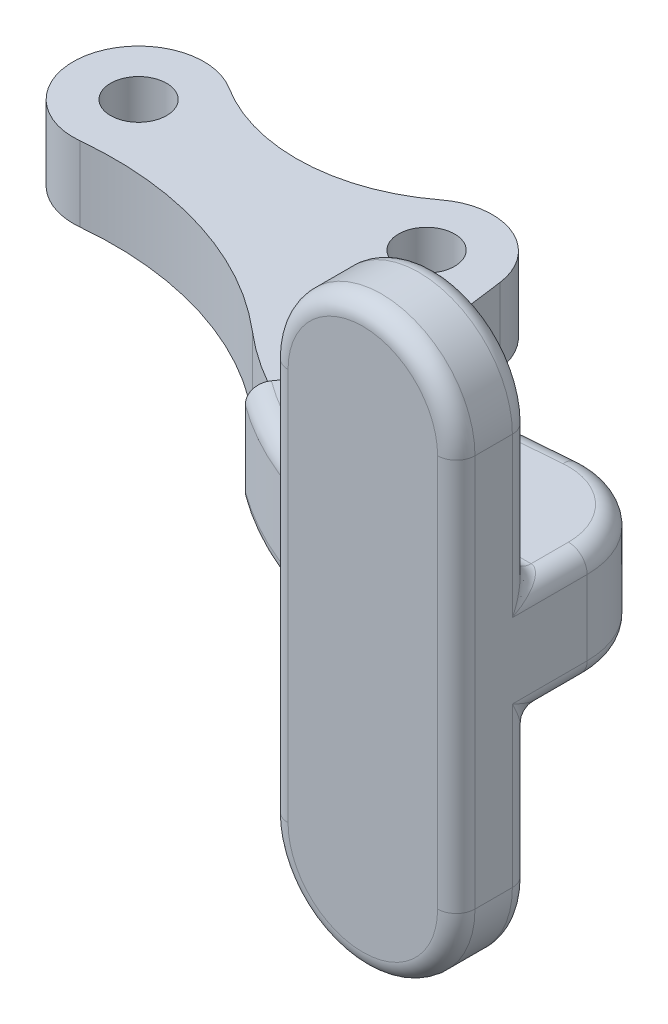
ISO-10303-21;
HEADER;
FILE_DESCRIPTION(('STEP AP214'),'2;1');
FILE_NAME('part.step','',(''),(''),'','','');
FILE_SCHEMA(('AUTOMOTIVE_DESIGN { 1 0 10303 214 1 1 1 1 }'));
ENDSEC;
DATA;
#1=APPLICATION_CONTEXT('core data for automotive mechanical design processes');
#2=APPLICATION_PROTOCOL_DEFINITION('international standard','automotive_design',2000,#1);
#3=PRODUCT_CONTEXT('',#1,'mechanical');
#4=PRODUCT('Part','Part','',(#3));
#5=PRODUCT_RELATED_PRODUCT_CATEGORY('part','',(#4));
#6=PRODUCT_DEFINITION_FORMATION('','',#4);
#7=PRODUCT_DEFINITION_CONTEXT('part definition',#1,'design');
#8=PRODUCT_DEFINITION('design','',#6,#7);
#9=PRODUCT_DEFINITION_SHAPE('','',#8);
#10=(LENGTH_UNIT() NAMED_UNIT(*) SI_UNIT(.MILLI.,.METRE.));
#11=(NAMED_UNIT(*) PLANE_ANGLE_UNIT() SI_UNIT($,.RADIAN.));
#12=(NAMED_UNIT(*) SI_UNIT($,.STERADIAN.) SOLID_ANGLE_UNIT());
#13=UNCERTAINTY_MEASURE_WITH_UNIT(LENGTH_MEASURE(1.E-05),#10,'distance_accuracy_value','');
#14=(GEOMETRIC_REPRESENTATION_CONTEXT(3) GLOBAL_UNCERTAINTY_ASSIGNED_CONTEXT((#13)) GLOBAL_UNIT_ASSIGNED_CONTEXT((#10,
#11,#12)) REPRESENTATION_CONTEXT('',''));
#15=CARTESIAN_POINT('',(0.,0.,0.));
#16=DIRECTION('',(0.,0.,1.));
#17=DIRECTION('',(1.,0.,0.));
#18=AXIS2_PLACEMENT_3D('',#15,#16,#17);
#19=CARTESIAN_POINT('',(28.2332660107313,1.99999998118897,-4.0282865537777));
#20=DIRECTION('',(6.66275308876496E-10,1.,0.));
#21=DIRECTION('',(0.,0.,-1.));
#22=AXIS2_PLACEMENT_3D('',#19,#20,#21);
#23=PLANE('',#22);
#24=CARTESIAN_POINT('',(25.4581621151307,1.99999998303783,-6.00279750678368));
#25=DIRECTION('',(-6.66275610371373E-10,-1.,0.));
#26=DIRECTION('',(0.,0.,-1.));
#27=AXIS2_PLACEMENT_3D('',#24,#25,#26);
#28=CIRCLE('',#27,17.9999999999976);
#29=CARTESIAN_POINT('',(25.0073769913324,1.99999998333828,11.9915569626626));
#30=VERTEX_POINT('',#29);
#31=CARTESIAN_POINT('',(17.7465743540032,2.,10.2616242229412));
#32=VERTEX_POINT('',#31);
#33=EDGE_CURVE('E297',#30,#32,#28,.T.);
#34=ORIENTED_EDGE('',*,*,#33,.F.);
#35=DIRECTION('',(0.,0.,-1.));
#36=VECTOR('',#35,1.);
#37=CARTESIAN_POINT('',(25.0073769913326,1.9999999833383,-4.02828655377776));
#38=LINE('',#37,#36);
#39=CARTESIAN_POINT('',(25.0073769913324,1.99999998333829,13.6802887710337));
#40=VERTEX_POINT('',#39);
#41=EDGE_CURVE('E311',#40,#30,#38,.T.);
#42=ORIENTED_EDGE('',*,*,#41,.F.);
#43=CARTESIAN_POINT('',(28.2332660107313,1.99999998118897,-4.0282865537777));
#44=DIRECTION('',(6.66275308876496E-10,1.,0.));
#45=DIRECTION('',(0.,0.,-1.));
#46=AXIS2_PLACEMENT_3D('',#43,#44,#45);
#47=CIRCLE('',#46,18.);
#48=CARTESIAN_POINT('',(17.5865578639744,1.99999998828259,10.4854175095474));
#49=VERTEX_POINT('',#48);
#50=EDGE_CURVE('E300',#49,#40,#47,.T.);
#51=ORIENTED_EDGE('',*,*,#50,.F.);
#52=DIRECTION('',(-0.581633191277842,3.87527208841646E-10,0.813451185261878));
#53=VECTOR('',#52,1.);
#54=CARTESIAN_POINT('',(20.7855404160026,1.9999999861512,6.01143599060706));
#55=LINE('',#54,#53);
#56=EDGE_CURVE('E295',#32,#49,#55,.T.);
#57=ORIENTED_EDGE('',*,*,#56,.F.);
#58=EDGE_LOOP('',(#34,#42,#51,#57));
#59=FACE_BOUND('',#58,.T.);
#60=ADVANCED_FACE('F20',(#59),#23,.F.);
#61=CARTESIAN_POINT('',(29.0073769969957,10.4999999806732,16.0114359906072));
#62=DIRECTION('',(0.,0.,1.));
#63=DIRECTION('',(-1.,6.66279965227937E-10,0.));
#64=AXIS2_PLACEMENT_3D('',#61,#62,#63);
#65=TOROIDAL_SURFACE('',#64,4.00000000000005,1.);
#66=CARTESIAN_POINT('',(25.0073769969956,10.4999999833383,16.0114359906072));
#67=DIRECTION('',(-6.66275308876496E-10,-1.,0.));
#68=DIRECTION('',(0.,0.,1.));
#69=AXIS2_PLACEMENT_3D('',#66,#67,#68);
#70=CIRCLE('',#69,1.);
#71=CARTESIAN_POINT('',(25.0073769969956,10.4999999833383,17.0114359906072));
#72=VERTEX_POINT('',#71);
#73=CARTESIAN_POINT('',(24.0073769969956,10.4999999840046,16.0114359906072));
#74=VERTEX_POINT('',#73);
#75=EDGE_CURVE('E398',#72,#74,#70,.T.);
#76=ORIENTED_EDGE('',*,*,#75,.F.);
#77=CARTESIAN_POINT('',(29.0073769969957,10.4999999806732,17.0114359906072));
#78=DIRECTION('',(0.,0.,-1.));
#79=DIRECTION('',(-1.,6.66275628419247E-10,0.));
#80=AXIS2_PLACEMENT_3D('',#77,#78,#79);
#81=CIRCLE('',#80,4.00000000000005);
#82=CARTESIAN_POINT('',(33.0073769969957,10.4999999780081,17.0114359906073));
#83=VERTEX_POINT('',#82);
#84=EDGE_CURVE('E478',#83,#72,#81,.F.);
#85=ORIENTED_EDGE('',*,*,#84,.F.);
#86=CARTESIAN_POINT('',(33.0073769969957,10.4999999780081,16.0114359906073));
#87=DIRECTION('',(6.66275431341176E-10,1.,0.));
#88=DIRECTION('',(1.,-6.66275431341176E-10,0.));
#89=AXIS2_PLACEMENT_3D('',#86,#87,#88);
#90=CIRCLE('',#89,1.);
#91=CARTESIAN_POINT('',(34.0073769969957,10.4999999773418,16.0114359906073));
#92=VERTEX_POINT('',#91);
#93=EDGE_CURVE('E502',#83,#92,#90,.T.);
#94=ORIENTED_EDGE('',*,*,#93,.T.);
#95=CARTESIAN_POINT('',(29.0073769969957,10.4999999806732,16.0114359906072));
#96=DIRECTION('',(0.,0.,1.));
#97=DIRECTION('',(-1.,6.66275308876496E-10,0.));
#98=AXIS2_PLACEMENT_3D('',#95,#96,#97);
#99=CIRCLE('',#98,5.);
#100=EDGE_CURVE('E753',#74,#92,#99,.F.);
#101=ORIENTED_EDGE('',*,*,#100,.F.);
#102=EDGE_LOOP('',(#76,#85,#94,#101));
#103=FACE_BOUND('',#102,.T.);
#104=ADVANCED_FACE('F485',(#103),#65,.T.);
#105=CARTESIAN_POINT('',(29.0073769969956,10.4999999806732,17.0114359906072));
#106=DIRECTION('',(0.,0.,1.));
#107=DIRECTION('',(-1.,6.66275308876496E-10,0.));
#108=AXIS2_PLACEMENT_3D('',#105,#106,#107);
#109=PLANE('',#108);
#110=CARTESIAN_POINT('',(29.0073769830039,-10.5000000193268,17.0114359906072));
#111=DIRECTION('',(0.,0.,-1.));
#112=DIRECTION('',(1.,-6.66277796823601E-10,0.));
#113=AXIS2_PLACEMENT_3D('',#110,#111,#112);
#114=CIRCLE('',#113,3.99999999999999);
#115=CARTESIAN_POINT('',(33.0073769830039,-10.5000000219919,17.0114359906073));
#116=VERTEX_POINT('',#115);
#117=CARTESIAN_POINT('',(25.0073769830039,-10.5000000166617,17.0114359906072));
#118=VERTEX_POINT('',#117);
#119=EDGE_CURVE('E465',#116,#118,#114,.T.);
#120=ORIENTED_EDGE('',*,*,#119,.F.);
#121=DIRECTION('',(6.66275308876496E-10,1.,0.));
#122=VECTOR('',#121,1.);
#123=CARTESIAN_POINT('',(33.0073769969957,10.4999999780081,17.0114359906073));
#124=LINE('',#123,#122);
#125=EDGE_CURVE('E740',#83,#116,#124,.F.);
#126=ORIENTED_EDGE('',*,*,#125,.F.);
#127=ORIENTED_EDGE('',*,*,#84,.T.);
#128=DIRECTION('',(-6.66275308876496E-10,-1.,0.));
#129=VECTOR('',#128,1.);
#130=CARTESIAN_POINT('',(25.0073769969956,10.4999999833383,17.0114359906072));
#131=LINE('',#130,#129);
#132=EDGE_CURVE('E406',#118,#72,#131,.F.);
#133=ORIENTED_EDGE('',*,*,#132,.F.);
#134=EDGE_LOOP('',(#120,#126,#127,#133));
#135=FACE_BOUND('',#134,.T.);
#136=ADVANCED_FACE('F494',(#135),#109,.T.);
#137=CARTESIAN_POINT('',(29.0073769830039,-10.5000000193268,16.0114359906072));
#138=DIRECTION('',(0.,0.,1.));
#139=DIRECTION('',(-1.,6.66274761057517E-10,0.));
#140=AXIS2_PLACEMENT_3D('',#137,#138,#139);
#141=TOROIDAL_SURFACE('',#140,4.,1.);
#142=CARTESIAN_POINT('',(25.0073769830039,-10.5000000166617,16.0114359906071));
#143=DIRECTION('',(-6.66275308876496E-10,-1.,0.));
#144=DIRECTION('',(0.,0.,1.));
#145=AXIS2_PLACEMENT_3D('',#142,#143,#144);
#146=CIRCLE('',#145,1.);
#147=CARTESIAN_POINT('',(24.0073769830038,-10.5000000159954,16.0114359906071));
#148=VERTEX_POINT('',#147);
#149=EDGE_CURVE('E400',#148,#118,#146,.F.);
#150=ORIENTED_EDGE('',*,*,#149,.F.);
#151=CARTESIAN_POINT('',(29.0073769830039,-10.5000000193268,16.0114359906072));
#152=DIRECTION('',(0.,0.,1.));
#153=DIRECTION('',(-1.,6.66275308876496E-10,0.));
#154=AXIS2_PLACEMENT_3D('',#151,#152,#153);
#155=CIRCLE('',#154,5.);
#156=CARTESIAN_POINT('',(34.0073769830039,-10.5000000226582,16.0114359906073));
#157=VERTEX_POINT('',#156);
#158=EDGE_CURVE('E728',#157,#148,#155,.F.);
#159=ORIENTED_EDGE('',*,*,#158,.F.);
#160=CARTESIAN_POINT('',(33.0073769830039,-10.5000000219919,16.0114359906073));
#161=DIRECTION('',(6.66275308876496E-10,1.,0.));
#162=DIRECTION('',(0.,0.,-1.));
#163=AXIS2_PLACEMENT_3D('',#160,#161,#162);
#164=CIRCLE('',#163,1.);
#165=EDGE_CURVE('E751',#116,#157,#164,.T.);
#166=ORIENTED_EDGE('',*,*,#165,.F.);
#167=ORIENTED_EDGE('',*,*,#119,.T.);
#168=EDGE_LOOP('',(#150,#159,#166,#167));
#169=FACE_BOUND('',#168,.T.);
#170=ADVANCED_FACE('F439',(#169),#141,.T.);
#171=CARTESIAN_POINT('',(23.1160903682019,-2.92051514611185,13.6361583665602));
#172=CARTESIAN_POINT('',(24.0073769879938,-3.01077500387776,13.672955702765));
#173=CARTESIAN_POINT('',(24.0073769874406,-3.84103027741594,14.0114359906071));
#174=CARTESIAN_POINT('',(23.1397077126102,-2.88292490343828,13.7352047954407));
#175=CARTESIAN_POINT('',(24.0073769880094,-2.98742912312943,13.7863945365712));
#176=CARTESIAN_POINT('',(24.0073769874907,-3.76584343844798,14.195861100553));
#177=CARTESIAN_POINT('',(23.1608304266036,-2.83346662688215,13.8261584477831));
#178=CARTESIAN_POINT('',(24.007376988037,-2.94586822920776,13.8962419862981));
#179=CARTESIAN_POINT('',(24.0073769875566,-3.66693324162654,14.3657209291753));
#180=CARTESIAN_POINT('',(23.1986284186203,-2.71061665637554,13.9918449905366));
#181=CARTESIAN_POINT('',(24.0073769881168,-2.82618189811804,14.0999930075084));
#182=CARTESIAN_POINT('',(24.0073769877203,-3.42123329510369,14.6757960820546));
#183=CARTESIAN_POINT('',(23.2148861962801,-2.63805831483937,14.0647719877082));
#184=CARTESIAN_POINT('',(24.0073769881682,-2.74897527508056,14.1924808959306));
#185=CARTESIAN_POINT('',(24.007376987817,-3.27611661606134,14.8126216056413));
#186=CARTESIAN_POINT('',(23.2412631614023,-2.47657926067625,14.1844784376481));
#187=CARTESIAN_POINT('',(24.0073769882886,-2.56816146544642,14.3453732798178));
#188=CARTESIAN_POINT('',(24.0073769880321,-2.95315850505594,15.0374889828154));
#189=CARTESIAN_POINT('',(23.2515296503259,-2.38630181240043,14.2319098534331));
#190=CARTESIAN_POINT('',(24.0073769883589,-2.46282820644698,14.4073021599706));
#191=CARTESIAN_POINT('',(24.0073769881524,-2.77260361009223,15.1267528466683));
#192=CARTESIAN_POINT('',(23.2651247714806,-2.19909033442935,14.2949948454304));
#193=CARTESIAN_POINT('',(24.007376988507,-2.24060187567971,14.489575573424));
#194=CARTESIAN_POINT('',(24.0073769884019,-2.39818065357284,15.2455276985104));
#195=CARTESIAN_POINT('',(23.2686714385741,-2.09964559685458,14.311637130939));
#196=CARTESIAN_POINT('',(24.0073769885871,-2.12030270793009,14.5116038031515));
#197=CARTESIAN_POINT('',(24.0073769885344,-2.19929117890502,15.2768962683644));
#198=CARTESIAN_POINT('',(23.2686714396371,-2.00000001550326,14.3116371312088));
#199=CARTESIAN_POINT('',(24.0073769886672,-2.00000001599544,14.5116038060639));
#200=CARTESIAN_POINT('',(24.0073769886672,-2.00000001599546,15.2768962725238));
#201=(BOUNDED_SURFACE() B_SPLINE_SURFACE(3,2,((#171,#172,#173),(#174,#175,#176),(#177,#178,
#179),(#180,#181,#182),(#183,#184,#185),(#186,#187,#188),(#189,#190,#191),(#192,#193,#194),
(#195,#196,#197),(#198,#199,#200)),.UNSPECIFIED.,.F.,.F.,.F.) B_SPLINE_SURFACE_WITH_KNOTS((4,2,
2,2,4),(3,3),(0.,0.000589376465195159,0.00117875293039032,0.00176812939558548,
0.00235750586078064),(0.,1.),
.UNSPECIFIED.) GEOMETRIC_REPRESENTATION_ITEM() RATIONAL_B_SPLINE_SURFACE(((1.,0.744551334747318,
1.),(1.,0.75247673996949,1.),(1.,0.759450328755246,1.),(1.,0.771792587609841,1.),(1.,
0.777027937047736,1.),(1.,0.785468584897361,1.),(1.,0.788721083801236,1.),(1.,0.793018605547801,
1.),(1.,0.794137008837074,1.),(1.,0.794133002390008,1.))) REPRESENTATION_ITEM('') SURFACE());
#202=CARTESIAN_POINT('',(24.0073769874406,-3.84103027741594,14.0114359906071));
#203=CARTESIAN_POINT('',(24.0073769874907,-3.76584343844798,14.195861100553));
#204=CARTESIAN_POINT('',(24.0073769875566,-3.66693324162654,14.3657209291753));
#205=CARTESIAN_POINT('',(24.0073769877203,-3.42123329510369,14.6757960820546));
#206=CARTESIAN_POINT('',(24.007376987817,-3.27611661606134,14.8126216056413));
#207=CARTESIAN_POINT('',(24.0073769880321,-2.95315850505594,15.0374889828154));
#208=CARTESIAN_POINT('',(24.0073769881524,-2.77260361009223,15.1267528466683));
#209=CARTESIAN_POINT('',(24.0073769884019,-2.39818065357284,15.2455276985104));
#210=CARTESIAN_POINT('',(24.0073769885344,-2.19929117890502,15.2768962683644));
#211=CARTESIAN_POINT('',(24.0073769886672,-2.00000001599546,15.2768962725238));
#212=(BOUNDED_CURVE() B_SPLINE_CURVE(3,(#202,#203,#204,#205,#206,#207,#208,#209,#210,#211),
.UNSPECIFIED.,.F.,.F.) B_SPLINE_CURVE_WITH_KNOTS((4,2,2,2,4),(0.,0.000589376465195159,
0.00117875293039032,0.00176812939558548,0.00235750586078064),
.UNSPECIFIED.) CURVE() GEOMETRIC_REPRESENTATION_ITEM() RATIONAL_B_SPLINE_CURVE((1.,1.,1.,1.,1.,
1.,1.,1.,1.,1.)) REPRESENTATION_ITEM(''));
#213=CARTESIAN_POINT('',(24.0073769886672,-2.00000001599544,15.2768962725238));
#214=VERTEX_POINT('',#213);
#215=CARTESIAN_POINT('',(24.0073769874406,-3.84103027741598,14.0114359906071));
#216=VERTEX_POINT('',#215);
#217=EDGE_CURVE('E418',#214,#216,#212,.F.);
#218=CARTESIAN_POINT('',(23.0073769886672,-2.0000000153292,15.2768962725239));
#219=DIRECTION('',(-6.6626631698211E-10,-1.,0.));
#220=DIRECTION('',(0.,0.,1.));
#221=AXIS2_PLACEMENT_3D('',#218,#219,#220);
#222=CIRCLE('',#221,1.);
#223=CARTESIAN_POINT('',(23.2686714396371,-2.00000001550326,14.3116371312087));
#224=VERTEX_POINT('',#223);
#225=EDGE_CURVE('E424',#224,#214,#222,.T.);
#226=CARTESIAN_POINT('',(23.116090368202,-2.92051514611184,13.6361583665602));
#227=CARTESIAN_POINT('',(23.1191138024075,-2.9157024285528,13.6488394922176));
#228=CARTESIAN_POINT('',(23.1221064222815,-2.91066837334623,13.6614441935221));
#229=CARTESIAN_POINT('',(23.1279954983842,-2.9002174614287,13.6863419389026));
#230=CARTESIAN_POINT('',(23.1308926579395,-2.89480555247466,13.6986368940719));
#231=CARTESIAN_POINT('',(23.1365919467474,-2.88361408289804,13.7229044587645));
#232=CARTESIAN_POINT('',(23.139394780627,-2.87783937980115,13.7348791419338));
#233=CARTESIAN_POINT('',(23.1449062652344,-2.86593782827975,13.758496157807));
#234=CARTESIAN_POINT('',(23.1476156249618,-2.85981573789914,13.7701407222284));
#235=CARTESIAN_POINT('',(23.1529408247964,-2.84723503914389,13.7930882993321));
#236=CARTESIAN_POINT('',(23.1555573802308,-2.84078108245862,13.8043936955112));
#237=CARTESIAN_POINT('',(23.1606974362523,-2.82755241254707,13.8266544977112));
#238=CARTESIAN_POINT('',(23.1632216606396,-2.82078223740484,13.8376124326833));
#239=CARTESIAN_POINT('',(23.1681773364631,-2.80693697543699,13.8591706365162));
#240=CARTESIAN_POINT('',(23.1706095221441,-2.79986630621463,13.8697735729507));
#241=CARTESIAN_POINT('',(23.1753812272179,-2.78543595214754,13.890614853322));
#242=CARTESIAN_POINT('',(23.1777214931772,-2.77808055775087,13.9008559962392));
#243=CARTESIAN_POINT('',(23.1823093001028,-2.76309666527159,13.9209675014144));
#244=CARTESIAN_POINT('',(23.1845576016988,-2.75547232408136,13.9308407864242));
#245=CARTESIAN_POINT('',(23.1889612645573,-2.73996643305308,13.9502111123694));
#246=CARTESIAN_POINT('',(23.1911174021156,-2.73208890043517,13.9597111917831));
#247=CARTESIAN_POINT('',(23.1953363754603,-2.71609247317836,13.9783303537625));
#248=CARTESIAN_POINT('',(23.1974000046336,-2.70797745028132,13.9874525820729));
#249=CARTESIAN_POINT('',(23.2014334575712,-2.69152181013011,14.0053119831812));
#250=CARTESIAN_POINT('',(23.2034040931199,-2.68318491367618,14.0140524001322));
#251=CARTESIAN_POINT('',(23.2072509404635,-2.66630118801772,14.0311448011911));
#252=CARTESIAN_POINT('',(23.2091279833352,-2.65775792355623,14.0395001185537));
#253=CARTESIAN_POINT('',(23.2127868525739,-2.64047698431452,14.0558195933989));
#254=CARTESIAN_POINT('',(23.2145695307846,-2.63174271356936,14.0637871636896));
#255=CARTESIAN_POINT('',(23.2180389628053,-2.61409514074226,14.0793290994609));
#256=CARTESIAN_POINT('',(23.2197265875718,-2.60518507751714,14.0869069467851));
#257=CARTESIAN_POINT('',(23.2230043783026,-2.5872010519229,14.1016678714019));
#258=CARTESIAN_POINT('',(23.2245954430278,-2.57813016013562,14.1088544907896));
#259=CARTESIAN_POINT('',(23.2279127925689,-2.55846646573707,14.1238819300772));
#260=CARTESIAN_POINT('',(23.2296274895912,-2.54783621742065,14.1316763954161));
#261=CARTESIAN_POINT('',(23.2329450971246,-2.52632875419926,14.146792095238));
#262=CARTESIAN_POINT('',(23.2345486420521,-2.51545350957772,14.1541159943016));
#263=CARTESIAN_POINT('',(23.237643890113,-2.49347305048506,14.1682831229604));
#264=CARTESIAN_POINT('',(23.2391362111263,-2.48236962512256,14.1751289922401));
#265=CARTESIAN_POINT('',(23.2420096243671,-2.45995032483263,14.1883332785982));
#266=CARTESIAN_POINT('',(23.2433913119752,-2.44863605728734,14.1946942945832));
#267=CARTESIAN_POINT('',(23.2460437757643,-2.42581268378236,14.2069227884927));
#268=CARTESIAN_POINT('',(23.2473151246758,-2.41430500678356,14.21279280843));
#269=CARTESIAN_POINT('',(23.249747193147,-2.39111259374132,14.2240339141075));
#270=CARTESIAN_POINT('',(23.2509084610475,-2.37942911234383,14.2294074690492));
#271=CARTESIAN_POINT('',(23.2531205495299,-2.35590298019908,14.2396509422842));
#272=CARTESIAN_POINT('',(23.2541718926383,-2.34406141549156,14.2445232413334));
#273=CARTESIAN_POINT('',(23.256164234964,-2.32023709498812,14.2537601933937));
#274=CARTESIAN_POINT('',(23.2571057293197,-2.30825526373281,14.2581271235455));
#275=CARTESIAN_POINT('',(23.2588783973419,-2.2841684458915,14.2663500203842));
#276=CARTESIAN_POINT('',(23.2597100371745,-2.27206423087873,14.2702081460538));
#277=CARTESIAN_POINT('',(23.2612629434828,-2.24775071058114,14.2774108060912));
#278=CARTESIAN_POINT('',(23.2619846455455,-2.23554203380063,14.2807573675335));
#279=CARTESIAN_POINT('',(23.2633175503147,-2.21103765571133,14.2869349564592));
#280=CARTESIAN_POINT('',(23.2639291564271,-2.1987424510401,14.2897678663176));
#281=CARTESIAN_POINT('',(23.2650416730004,-2.17408305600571,14.2949168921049));
#282=CARTESIAN_POINT('',(23.2655429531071,-2.16171924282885,14.2972347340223));
#283=CARTESIAN_POINT('',(23.2664345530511,-2.13694061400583,14.3013530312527));
#284=CARTESIAN_POINT('',(23.2668252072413,-2.12452606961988,14.3031550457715));
#285=CARTESIAN_POINT('',(23.2674952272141,-2.09966388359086,14.3062417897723));
#286=CARTESIAN_POINT('',(23.267774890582,-2.08721642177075,14.3075279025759));
#287=CARTESIAN_POINT('',(23.2682225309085,-2.06230618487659,14.3095835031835));
#288=CARTESIAN_POINT('',(23.2683907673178,-2.04984351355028,14.3103541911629));
#289=CARTESIAN_POINT('',(23.2686151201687,-2.02492055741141,14.3113806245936));
#290=CARTESIAN_POINT('',(23.2686714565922,-2.01246031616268,14.311637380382));
#291=CARTESIAN_POINT('',(23.2686714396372,-2.00000001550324,14.3116371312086));
#292=B_SPLINE_CURVE_WITH_KNOTS('',3,(#226,#227,#228,#229,#230,#231,#232,#233,#234,#235,#236,
#237,#238,#239,#240,#241,#242,#243,#244,#245,#246,#247,#248,#249,#250,#251,#252,#253,#254,#255,
#256,#257,#258,#259,#260,#261,#262,#263,#264,#265,#266,#267,#268,#269,#270,#271,#272,#273,#274,
#275,#276,#277,#278,#279,#280,#281,#282,#283,#284,#285,#286,#287,#288,#289,#290,#291),
.UNSPECIFIED.,.F.,.F.,(4,2,2,2,2,2,2,2,2,2,2,2,2,2,2,2,2,2,2,2,2,2,2,2,2,2,2,2,2,2,2,2,4),(0.,
0.0416879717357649,0.0829066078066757,0.123658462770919,0.163946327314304,0.203773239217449,
0.243142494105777,0.282057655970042,0.320522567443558,0.358541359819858,0.396118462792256,
0.433258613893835,0.46996686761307,0.506248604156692,0.542109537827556,0.577555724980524,
0.612593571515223,0.652460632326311,0.692077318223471,0.731454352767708,0.77060280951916,
0.80953410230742,0.848259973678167,0.886792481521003,0.925143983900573,0.963327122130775,
1.00135480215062,1.03924017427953,1.07699661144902,1.11463768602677,1.15217714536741,
1.18962888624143,1.22700692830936),.UNSPECIFIED.);
#293=CARTESIAN_POINT('',(23.1160903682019,-2.92051514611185,13.6361583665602));
#294=VERTEX_POINT('',#293);
#295=EDGE_CURVE('E958',#294,#224,#292,.T.);
#296=CARTESIAN_POINT('',(23.0073769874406,-3.84103027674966,14.0114359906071));
#297=DIRECTION('',(2.5151608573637E-10,0.377515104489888,0.926003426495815));
#298=DIRECTION('',(6.16978579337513E-10,0.926003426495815,-0.377515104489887));
#299=AXIS2_PLACEMENT_3D('',#296,#297,#298);
#300=CIRCLE('',#299,1.);
#301=EDGE_CURVE('E401',#216,#294,#300,.T.);
#302=ORIENTED_EDGE('',*,*,#217,.F.);
#303=ORIENTED_EDGE('',*,*,#225,.F.);
#304=ORIENTED_EDGE('',*,*,#295,.F.);
#305=ORIENTED_EDGE('',*,*,#301,.F.);
#306=EDGE_LOOP('',(#302,#303,#304,#305));
#307=FACE_BOUND('',#306,.T.);
#308=ADVANCED_FACE('F426',(#307),#201,.F.);
#309=CARTESIAN_POINT('',(25.0073769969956,10.4999999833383,16.0114359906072));
#310=DIRECTION('',(-6.66275308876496E-10,-1.,0.));
#311=DIRECTION('',(0.,0.,1.));
#312=AXIS2_PLACEMENT_3D('',#309,#310,#311);
#313=CYLINDRICAL_SURFACE('',#312,1.);
#314=ORIENTED_EDGE('',*,*,#149,.T.);
#315=ORIENTED_EDGE('',*,*,#132,.T.);
#316=ORIENTED_EDGE('',*,*,#75,.T.);
#317=DIRECTION('',(-6.66275308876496E-10,-1.,0.));
#318=VECTOR('',#317,1.);
#319=CARTESIAN_POINT('',(24.0073769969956,10.4999999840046,16.0114359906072));
#320=LINE('',#319,#318);
#321=EDGE_CURVE('E391',#148,#74,#320,.F.);
#322=ORIENTED_EDGE('',*,*,#321,.F.);
#323=EDGE_LOOP('',(#314,#315,#316,#322));
#324=FACE_BOUND('',#323,.T.);
#325=ADVANCED_FACE('F438',(#324),#313,.T.);
#326=CARTESIAN_POINT('',(23.2686714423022,1.99999998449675,14.3116371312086));
#327=CARTESIAN_POINT('',(24.0073769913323,1.99999998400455,14.5116038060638));
#328=CARTESIAN_POINT('',(24.0073769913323,1.99999998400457,15.2768962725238));
#329=CARTESIAN_POINT('',(23.2686714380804,2.19800090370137,14.3116371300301));
#330=CARTESIAN_POINT('',(24.0073769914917,2.23922089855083,14.5116037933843));
#331=CARTESIAN_POINT('',(24.0073769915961,2.39600182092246,15.2768962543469));
#332=CARTESIAN_POINT('',(23.2547116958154,2.39358439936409,14.2455330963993));
#333=CARTESIAN_POINT('',(24.0073769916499,2.47659235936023,14.4221528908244));
#334=CARTESIAN_POINT('',(24.0073769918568,2.78716881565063,15.152183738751));
#335=CARTESIAN_POINT('',(23.2151201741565,2.63695299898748,14.0658233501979));
#336=CARTESIAN_POINT('',(24.0073769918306,2.74778854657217,14.1938097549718));
#337=CARTESIAN_POINT('',(24.0073769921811,3.27390601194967,14.8145945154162));
#338=CARTESIAN_POINT('',(23.1988311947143,2.70973657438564,13.9927525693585));
#339=CARTESIAN_POINT('',(24.0073769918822,2.82524826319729,14.1011463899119));
#340=CARTESIAN_POINT('',(24.0073769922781,3.41947316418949,14.6774984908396));
#341=CARTESIAN_POINT('',(23.1612649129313,2.83227174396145,13.8280445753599));
#342=CARTESIAN_POINT('',(24.0073769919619,2.94477176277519,13.8985440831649));
#343=CARTESIAN_POINT('',(24.0073769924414,3.66454350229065,14.3692468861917));
#344=CARTESIAN_POINT('',(23.1395824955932,2.88312417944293,13.7346796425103));
#345=CARTESIAN_POINT('',(24.0073769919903,2.98755724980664,13.7857718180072));
#346=CARTESIAN_POINT('',(24.0073769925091,3.76625710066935,14.1948463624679));
#347=CARTESIAN_POINT('',(23.1160903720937,2.92051511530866,13.6361583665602));
#348=CARTESIAN_POINT('',(24.0073769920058,3.01077497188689,13.672955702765));
#349=CARTESIAN_POINT('',(24.0073769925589,3.84103024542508,14.0114359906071));
#350=(BOUNDED_SURFACE() B_SPLINE_SURFACE(3,2,((#326,#327,#328),(#329,#330,#331),(#332,#333,
#334),(#335,#336,#337),(#338,#339,#340),(#341,#342,#343),(#344,#345,#346),(#347,#348,#349)),
.UNSPECIFIED.,.F.,.F.,.F.) B_SPLINE_SURFACE_WITH_KNOTS((4,2,2,4),(3,3),(0.,0.00117827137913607,
0.00176740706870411,0.00235654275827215),(0.,1.),
.UNSPECIFIED.) GEOMETRIC_REPRESENTATION_ITEM() RATIONAL_B_SPLINE_SURFACE(((1.,0.794133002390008,
1.),(1.,0.794138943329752,1.),(1.,0.789771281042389,1.),(1.,0.777103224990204,1.),(1.,
0.771857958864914,1.),(1.,0.759593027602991,1.),(1.,0.752445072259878,1.),(1.,0.744551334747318,1.))) REPRESENTATION_ITEM('') SURFACE());
#351=CARTESIAN_POINT('',(24.0073769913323,1.99999998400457,15.2768962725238));
#352=CARTESIAN_POINT('',(24.0073769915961,2.39600182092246,15.2768962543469));
#353=CARTESIAN_POINT('',(24.0073769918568,2.78716881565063,15.152183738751));
#354=CARTESIAN_POINT('',(24.0073769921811,3.27390601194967,14.8145945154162));
#355=CARTESIAN_POINT('',(24.0073769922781,3.41947316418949,14.6774984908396));
#356=CARTESIAN_POINT('',(24.0073769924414,3.66454350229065,14.3692468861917));
#357=CARTESIAN_POINT('',(24.0073769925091,3.76625710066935,14.1948463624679));
#358=CARTESIAN_POINT('',(24.0073769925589,3.84103024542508,14.0114359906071));
#359=(BOUNDED_CURVE() B_SPLINE_CURVE(3,(#351,#352,#353,#354,#355,#356,#357,#358),.UNSPECIFIED.,
.F.,.F.) B_SPLINE_CURVE_WITH_KNOTS((4,2,2,4),(0.,0.00117827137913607,0.00176740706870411,
0.00235654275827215),
.UNSPECIFIED.) CURVE() GEOMETRIC_REPRESENTATION_ITEM() RATIONAL_B_SPLINE_CURVE((1.,1.,1.,1.,1.,
1.,1.,1.)) REPRESENTATION_ITEM(''));
#360=CARTESIAN_POINT('',(24.0073769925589,3.84103024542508,14.0114359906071));
#361=VERTEX_POINT('',#360);
#362=CARTESIAN_POINT('',(24.0073769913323,1.99999998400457,15.2768962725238));
#363=VERTEX_POINT('',#362);
#364=EDGE_CURVE('E2059',#361,#363,#359,.F.);
#365=CARTESIAN_POINT('',(23.007376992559,3.84103024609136,14.0114359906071));
#366=DIRECTION('',(-2.51542009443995E-10,-0.377515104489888,0.926003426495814));
#367=DIRECTION('',(6.16967893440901E-10,0.926003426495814,0.377515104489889));
#368=AXIS2_PLACEMENT_3D('',#365,#366,#367);
#369=CIRCLE('',#368,1.);
#370=CARTESIAN_POINT('',(23.1160903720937,2.92051511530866,13.6361583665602));
#371=VERTEX_POINT('',#370);
#372=EDGE_CURVE('E542',#371,#361,#369,.T.);
#373=CARTESIAN_POINT('',(23.2686714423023,1.99999998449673,14.3116371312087));
#374=CARTESIAN_POINT('',(23.2686714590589,2.01242138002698,14.3116373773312));
#375=CARTESIAN_POINT('',(23.2686154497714,2.02484271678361,14.3113822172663));
#376=CARTESIAN_POINT('',(23.2683924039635,2.04968806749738,14.3103621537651));
#377=CARTESIAN_POINT('',(23.2682251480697,2.06211203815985,14.3095962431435));
#378=CARTESIAN_POINT('',(23.2677801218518,2.08694524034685,14.3075533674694));
#379=CARTESIAN_POINT('',(23.2675020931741,2.09935436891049,14.3062752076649));
#380=CARTESIAN_POINT('',(23.2668359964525,2.12414041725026,14.3032075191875));
#381=CARTESIAN_POINT('',(23.2664476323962,2.13651715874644,14.3014166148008));
#382=CARTESIAN_POINT('',(23.2655612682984,2.1612208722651,14.2973236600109));
#383=CARTESIAN_POINT('',(23.2650629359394,2.17354757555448,14.2950200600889));
#384=CARTESIAN_POINT('',(23.2639569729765,2.19813360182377,14.2899026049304));
#385=CARTESIAN_POINT('',(23.2633489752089,2.21039255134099,14.2870870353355));
#386=CARTESIAN_POINT('',(23.2620239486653,2.23482542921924,14.2809471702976));
#387=CARTESIAN_POINT('',(23.2613065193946,2.24699886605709,14.2776210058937));
#388=CARTESIAN_POINT('',(23.259762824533,2.27124307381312,14.2704621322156));
#389=CARTESIAN_POINT('',(23.2589361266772,2.2833132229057,14.2666274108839));
#390=CARTESIAN_POINT('',(23.2571740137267,2.30733323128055,14.2584542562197));
#391=CARTESIAN_POINT('',(23.2562381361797,2.31928232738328,14.2541136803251));
#392=CARTESIAN_POINT('',(23.2542577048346,2.34304265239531,14.2449323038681));
#393=CARTESIAN_POINT('',(23.2532126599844,2.35485296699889,14.2400892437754));
#394=CARTESIAN_POINT('',(23.2510138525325,2.37831822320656,14.2299070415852));
#395=CARTESIAN_POINT('',(23.2498595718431,2.38997209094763,14.2245655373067));
#396=CARTESIAN_POINT('',(23.2474421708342,2.41310704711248,14.2133912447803));
#397=CARTESIAN_POINT('',(23.2461785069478,2.42458689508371,14.2075560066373));
#398=CARTESIAN_POINT('',(23.2435421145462,2.4473565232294,14.195399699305));
#399=CARTESIAN_POINT('',(23.2421688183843,2.45864489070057,14.1890761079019));
#400=CARTESIAN_POINT('',(23.2393129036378,2.48101444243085,14.1759491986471));
#401=CARTESIAN_POINT('',(23.2378296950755,2.49209403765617,14.1691433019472));
#402=CARTESIAN_POINT('',(23.2347533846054,2.51402901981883,14.155058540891));
#403=CARTESIAN_POINT('',(23.2331596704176,2.52488263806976,14.1477770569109));
#404=CARTESIAN_POINT('',(23.2298625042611,2.54634916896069,14.1327485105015));
#405=CARTESIAN_POINT('',(23.2281584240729,2.55696013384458,14.1249988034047));
#406=CARTESIAN_POINT('',(23.2248521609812,2.57664563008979,14.1100148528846));
#407=CARTESIAN_POINT('',(23.223261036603,2.58575576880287,14.1028248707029));
#408=CARTESIAN_POINT('',(23.219982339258,2.60381805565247,14.0880544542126));
#409=CARTESIAN_POINT('',(23.2182938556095,2.61276710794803,14.0804704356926));
#410=CARTESIAN_POINT('',(23.2148219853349,2.63049229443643,14.0649133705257));
#411=CARTESIAN_POINT('',(23.2130377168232,2.63926516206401,14.0569368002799));
#412=CARTESIAN_POINT('',(23.2093749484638,2.65662277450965,14.0405965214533));
#413=CARTESIAN_POINT('',(23.2074955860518,2.66520408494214,14.0322293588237));
#414=CARTESIAN_POINT('',(23.2036433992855,2.68216322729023,14.0151104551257));
#415=CARTESIAN_POINT('',(23.2016697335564,2.69053746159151,14.0063553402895));
#416=CARTESIAN_POINT('',(23.1976295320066,2.70706694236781,13.9884637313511));
#417=CARTESIAN_POINT('',(23.1955621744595,2.71521843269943,13.9793239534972));
#418=CARTESIAN_POINT('',(23.1913350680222,2.73128679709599,13.9606668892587));
#419=CARTESIAN_POINT('',(23.1891745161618,2.73919976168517,13.9511464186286));
#420=CARTESIAN_POINT('',(23.1847613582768,2.75477535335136,13.9317325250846));
#421=CARTESIAN_POINT('',(23.1825079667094,2.76243392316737,13.9218360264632));
#422=CARTESIAN_POINT('',(23.1779093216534,2.77748494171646,13.9016753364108));
#423=CARTESIAN_POINT('',(23.1755632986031,2.78487319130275,13.8914081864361));
#424=CARTESIAN_POINT('',(23.1707794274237,2.79936775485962,13.8705121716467));
#425=CARTESIAN_POINT('',(23.1683408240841,2.80646973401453,13.8598804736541));
#426=CARTESIAN_POINT('',(23.1633716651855,2.82037594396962,13.8382620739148));
#427=CARTESIAN_POINT('',(23.1608403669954,2.82717571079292,13.8272726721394));
#428=CARTESIAN_POINT('',(23.1556855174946,2.84046172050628,13.804946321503));
#429=CARTESIAN_POINT('',(23.1530612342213,2.8469433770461,13.7936068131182));
#430=CARTESIAN_POINT('',(23.1477199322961,2.85957746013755,13.7705884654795));
#431=CARTESIAN_POINT('',(23.1450021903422,2.86572518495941,13.7589072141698));
#432=CARTESIAN_POINT('',(23.1394732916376,2.87767581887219,13.7352143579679));
#433=CARTESIAN_POINT('',(23.1366614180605,2.88347391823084,13.7232004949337));
#434=CARTESIAN_POINT('',(23.1309433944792,2.89470982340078,13.6988521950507));
#435=CARTESIAN_POINT('',(23.1280365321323,2.90014271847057,13.6865156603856));
#436=CARTESIAN_POINT('',(23.1221273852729,2.91063307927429,13.6615324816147));
#437=CARTESIAN_POINT('',(23.1191243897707,2.91568554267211,13.6488839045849));
#438=CARTESIAN_POINT('',(23.1160903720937,2.92051511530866,13.6361583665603));
#439=B_SPLINE_CURVE_WITH_KNOTS('',3,(#373,#374,#375,#376,#377,#378,#379,#380,#381,#382,#383,
#384,#385,#386,#387,#388,#389,#390,#391,#392,#393,#394,#395,#396,#397,#398,#399,#400,#401,#402,
#403,#404,#405,#406,#407,#408,#409,#410,#411,#412,#413,#414,#415,#416,#417,#418,#419,#420,#421,
#422,#423,#424,#425,#426,#427,#428,#429,#430,#431,#432,#433,#434,#435,#436,#437,#438),
.UNSPECIFIED.,.F.,.F.,(4,2,2,2,2,2,2,2,2,2,2,2,2,2,2,2,2,2,2,2,2,2,2,2,2,2,2,2,2,2,2,2,4),(0.,
0.0372613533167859,0.0745964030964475,0.112019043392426,0.149543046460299,0.187182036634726,
0.224949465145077,0.262858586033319,0.300922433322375,0.339153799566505,0.377565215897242,
0.416168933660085,0.454976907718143,0.494000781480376,0.533251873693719,0.572741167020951,
0.612479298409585,0.647614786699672,0.683161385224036,0.719125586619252,0.755513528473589,
0.792331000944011,0.829583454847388,0.867276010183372,0.905413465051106,0.94400030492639,
0.983040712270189,1.02253857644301,1.06249750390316,1.10292082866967,1.14381162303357,
1.18517270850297,1.22700666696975),.UNSPECIFIED.);
#440=CARTESIAN_POINT('',(23.2686714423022,1.99999998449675,14.3116371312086));
#441=VERTEX_POINT('',#440);
#442=EDGE_CURVE('E509',#441,#371,#439,.T.);
#443=CARTESIAN_POINT('',(23.0073769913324,1.99999998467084,15.2768962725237));
#444=DIRECTION('',(6.66275308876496E-10,1.,0.));
#445=DIRECTION('',(0.,0.,-1.));
#446=AXIS2_PLACEMENT_3D('',#443,#444,#445);
#447=CIRCLE('',#446,1.);
#448=EDGE_CURVE('E550',#363,#441,#447,.T.);
#449=ORIENTED_EDGE('',*,*,#364,.F.);
#450=ORIENTED_EDGE('',*,*,#372,.F.);
#451=ORIENTED_EDGE('',*,*,#442,.F.);
#452=ORIENTED_EDGE('',*,*,#448,.F.);
#453=EDGE_LOOP('',(#449,#450,#451,#452));
#454=FACE_BOUND('',#453,.T.);
#455=ADVANCED_FACE('F514',(#454),#350,.F.);
#456=CARTESIAN_POINT('',(29.007376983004,-10.5000000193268,14.0114359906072));
#457=DIRECTION('',(0.,0.,1.));
#458=DIRECTION('',(-1.,6.66279965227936E-10,0.));
#459=AXIS2_PLACEMENT_3D('',#456,#457,#458);
#460=TOROIDAL_SURFACE('',#459,4.00000000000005,1.);
#461=CARTESIAN_POINT('',(33.0073769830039,-10.5000000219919,14.0114359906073));
#462=DIRECTION('',(-6.66275308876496E-10,-1.,0.));
#463=DIRECTION('',(0.,0.,1.));
#464=AXIS2_PLACEMENT_3D('',#461,#462,#463);
#465=CIRCLE('',#464,1.);
#466=CARTESIAN_POINT('',(34.0073769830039,-10.5000000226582,14.0114359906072));
#467=VERTEX_POINT('',#466);
#468=CARTESIAN_POINT('',(33.0073769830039,-10.5000000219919,13.0114359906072));
#469=VERTEX_POINT('',#468);
#470=EDGE_CURVE('E721',#467,#469,#465,.F.);
#471=ORIENTED_EDGE('',*,*,#470,.F.);
#472=CARTESIAN_POINT('',(29.007376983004,-10.5000000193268,14.0114359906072));
#473=DIRECTION('',(0.,0.,1.));
#474=DIRECTION('',(-1.,6.66275308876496E-10,0.));
#475=AXIS2_PLACEMENT_3D('',#472,#473,#474);
#476=CIRCLE('',#475,5.);
#477=CARTESIAN_POINT('',(24.0073769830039,-10.5000000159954,14.0114359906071));
#478=VERTEX_POINT('',#477);
#479=EDGE_CURVE('E738',#478,#467,#476,.T.);
#480=ORIENTED_EDGE('',*,*,#479,.F.);
#481=CARTESIAN_POINT('',(25.0073769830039,-10.5000000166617,14.0114359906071));
#482=DIRECTION('',(6.66275308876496E-10,1.,0.));
#483=DIRECTION('',(0.,0.,-1.));
#484=AXIS2_PLACEMENT_3D('',#481,#482,#483);
#485=CIRCLE('',#484,1.);
#486=CARTESIAN_POINT('',(25.0073769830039,-10.5000000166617,13.0114359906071));
#487=VERTEX_POINT('',#486);
#488=EDGE_CURVE('E559',#487,#478,#485,.T.);
#489=ORIENTED_EDGE('',*,*,#488,.F.);
#490=CARTESIAN_POINT('',(29.007376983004,-10.5000000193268,13.0114359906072));
#491=DIRECTION('',(0.,0.,1.));
#492=DIRECTION('',(-1.,6.66279965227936E-10,0.));
#493=AXIS2_PLACEMENT_3D('',#490,#491,#492);
#494=CIRCLE('',#493,4.00000000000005);
#495=CARTESIAN_POINT('',(28.9926894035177,-14.4999725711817,13.0114359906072));
#496=VERTEX_POINT('',#495);
#497=EDGE_CURVE('E582',#496,#487,#494,.F.);
#498=ORIENTED_EDGE('',*,*,#497,.F.);
#499=CARTESIAN_POINT('',(29.007376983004,-10.5000000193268,13.0114359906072));
#500=DIRECTION('',(0.,0.,1.));
#501=DIRECTION('',(-0.00367189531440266,-0.999993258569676,0.));
#502=AXIS2_PLACEMENT_3D('',#499,#500,#501);
#503=CIRCLE('',#502,4.00000000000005);
#504=CARTESIAN_POINT('',(31.1597456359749,-13.871542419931,13.0114359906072));
#505=VERTEX_POINT('',#504);
#506=EDGE_CURVE('E598',#505,#496,#503,.F.);
#507=ORIENTED_EDGE('',*,*,#506,.F.);
#508=CARTESIAN_POINT('',(29.007376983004,-10.5000000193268,13.0114359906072));
#509=DIRECTION('',(0.,0.,1.));
#510=DIRECTION('',(0.538092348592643,-0.842885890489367,0.));
#511=AXIS2_PLACEMENT_3D('',#508,#509,#510);
#512=CIRCLE('',#511,4.00000000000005);
#513=EDGE_CURVE('E34',#469,#505,#512,.F.);
#514=ORIENTED_EDGE('',*,*,#513,.F.);
#515=EDGE_LOOP('',(#471,#480,#489,#498,#507,#514));
#516=FACE_BOUND('',#515,.T.);
#517=ADVANCED_FACE('F525',(#516),#460,.T.);
#518=CARTESIAN_POINT('',(25.0073769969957,10.4999999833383,14.0114359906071));
#519=DIRECTION('',(6.66275308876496E-10,1.,0.));
#520=DIRECTION('',(0.,0.,-1.));
#521=AXIS2_PLACEMENT_3D('',#518,#519,#520);
#522=CYLINDRICAL_SURFACE('',#521,1.);
#523=ORIENTED_EDGE('',*,*,#488,.T.);
#524=DIRECTION('',(-6.66275308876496E-10,-1.,0.));
#525=VECTOR('',#524,1.);
#526=CARTESIAN_POINT('',(24.0073769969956,10.4999999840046,14.0114359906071));
#527=LINE('',#526,#525);
#528=EDGE_CURVE('E411',#216,#478,#527,.T.);
#529=ORIENTED_EDGE('',*,*,#528,.F.);
#530=CARTESIAN_POINT('',(24.0842759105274,-4.00000001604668,13.6268785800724));
#531=CARTESIAN_POINT('',(24.0580996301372,-4.00000001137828,13.6897127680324));
#532=CARTESIAN_POINT('',(24.0389273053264,-3.98640250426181,13.7536197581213));
#533=CARTESIAN_POINT('',(24.0134282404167,-3.93264337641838,13.8832568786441));
#534=CARTESIAN_POINT('',(24.0073769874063,-3.89209400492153,13.9488091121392));
#535=CARTESIAN_POINT('',(24.0073769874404,-3.84103027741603,14.0114359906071));
#536=(BOUNDED_CURVE() B_SPLINE_CURVE(3,(#530,#531,#532,#533,#534,#535),.UNSPECIFIED.,.F.,
.F.) B_SPLINE_CURVE_WITH_KNOTS((4,2,4),(0.,0.000402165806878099,0.000804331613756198),
.UNSPECIFIED.) CURVE() GEOMETRIC_REPRESENTATION_ITEM() RATIONAL_B_SPLINE_CURVE((1.,1.,1.,1.,1.,1.)) REPRESENTATION_ITEM(''));
#537=CARTESIAN_POINT('',(24.0842759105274,-4.00000001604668,13.6268785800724));
#538=VERTEX_POINT('',#537);
#539=EDGE_CURVE('E661',#216,#538,#536,.F.);
#540=ORIENTED_EDGE('',*,*,#539,.T.);
#541=CARTESIAN_POINT('',(25.0073769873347,-4.00000001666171,14.0114359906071));
#542=DIRECTION('',(6.66275308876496E-10,1.,0.));
#543=DIRECTION('',(0.,0.,-1.));
#544=AXIS2_PLACEMENT_3D('',#541,#542,#543);
#545=CIRCLE('',#544,1.);
#546=CARTESIAN_POINT('',(25.0073769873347,-4.00000001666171,13.0114359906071));
#547=VERTEX_POINT('',#546);
#548=EDGE_CURVE('E554',#538,#547,#545,.F.);
#549=ORIENTED_EDGE('',*,*,#548,.T.);
#550=DIRECTION('',(-6.66275308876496E-10,-1.,0.));
#551=VECTOR('',#550,1.);
#552=CARTESIAN_POINT('',(25.0073769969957,10.4999999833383,13.0114359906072));
#553=LINE('',#552,#551);
#554=EDGE_CURVE('E656',#547,#487,#553,.T.);
#555=ORIENTED_EDGE('',*,*,#554,.T.);
#556=EDGE_LOOP('',(#523,#529,#540,#549,#555));
#557=FACE_BOUND('',#556,.T.);
#558=ADVANCED_FACE('F887',(#557),#522,.T.);
#559=CARTESIAN_POINT('',(29.0073769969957,10.4999999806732,14.0114359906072));
#560=DIRECTION('',(0.,0.,1.));
#561=DIRECTION('',(-1.,6.66275194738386E-10,0.));
#562=AXIS2_PLACEMENT_3D('',#559,#560,#561);
#563=TOROIDAL_SURFACE('',#562,4.,1.);
#564=CARTESIAN_POINT('',(33.0073769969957,10.4999999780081,14.0114359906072));
#565=DIRECTION('',(-6.66275308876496E-10,-1.,0.));
#566=DIRECTION('',(0.,0.,1.));
#567=AXIS2_PLACEMENT_3D('',#564,#565,#566);
#568=CIRCLE('',#567,1.);
#569=CARTESIAN_POINT('',(33.0073769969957,10.4999999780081,13.0114359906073));
#570=VERTEX_POINT('',#569);
#571=CARTESIAN_POINT('',(34.0073769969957,10.4999999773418,14.0114359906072));
#572=VERTEX_POINT('',#571);
#573=EDGE_CURVE('E767',#570,#572,#568,.T.);
#574=ORIENTED_EDGE('',*,*,#573,.F.);
#575=CARTESIAN_POINT('',(29.0073769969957,10.4999999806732,13.0114359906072));
#576=DIRECTION('',(0.,0.,1.));
#577=DIRECTION('',(1.,-6.66273026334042E-10,0.));
#578=AXIS2_PLACEMENT_3D('',#575,#576,#577);
#579=CIRCLE('',#578,3.99999999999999);
#580=CARTESIAN_POINT('',(25.0073769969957,10.4999999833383,13.0114359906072));
#581=VERTEX_POINT('',#580);
#582=EDGE_CURVE('E827',#570,#581,#579,.T.);
#583=ORIENTED_EDGE('',*,*,#582,.T.);
#584=CARTESIAN_POINT('',(25.0073769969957,10.4999999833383,14.0114359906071));
#585=DIRECTION('',(6.66275308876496E-10,1.,0.));
#586=DIRECTION('',(0.,0.,-1.));
#587=AXIS2_PLACEMENT_3D('',#584,#585,#586);
#588=CIRCLE('',#587,1.);
#589=CARTESIAN_POINT('',(24.0073769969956,10.4999999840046,14.0114359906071));
#590=VERTEX_POINT('',#589);
#591=EDGE_CURVE('E815',#590,#581,#588,.F.);
#592=ORIENTED_EDGE('',*,*,#591,.F.);
#593=CARTESIAN_POINT('',(29.0073769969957,10.4999999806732,14.0114359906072));
#594=DIRECTION('',(0.,0.,1.));
#595=DIRECTION('',(-1.,6.66275308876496E-10,0.));
#596=AXIS2_PLACEMENT_3D('',#593,#594,#595);
#597=CIRCLE('',#596,5.);
#598=EDGE_CURVE('E763',#572,#590,#597,.T.);
#599=ORIENTED_EDGE('',*,*,#598,.F.);
#600=EDGE_LOOP('',(#574,#583,#592,#599));
#601=FACE_BOUND('',#600,.T.);
#602=ADVANCED_FACE('F798',(#601),#563,.T.);
#603=CARTESIAN_POINT('',(25.0073769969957,10.4999999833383,14.0114359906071));
#604=DIRECTION('',(6.66275308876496E-10,1.,0.));
#605=DIRECTION('',(0.,0.,-1.));
#606=AXIS2_PLACEMENT_3D('',#603,#604,#605);
#607=CYLINDRICAL_SURFACE('',#606,1.);
#608=ORIENTED_EDGE('',*,*,#591,.T.);
#609=DIRECTION('',(-6.66275308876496E-10,-1.,0.));
#610=VECTOR('',#609,1.);
#611=CARTESIAN_POINT('',(25.0073769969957,10.4999999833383,13.0114359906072));
#612=LINE('',#611,#610);
#613=CARTESIAN_POINT('',(25.0073769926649,3.9999999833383,13.0114359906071));
#614=VERTEX_POINT('',#613);
#615=EDGE_CURVE('E2035',#581,#614,#612,.T.);
#616=ORIENTED_EDGE('',*,*,#615,.T.);
#617=CARTESIAN_POINT('',(25.0073769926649,3.99999998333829,14.0114359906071));
#618=DIRECTION('',(6.66275308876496E-10,1.,0.));
#619=DIRECTION('',(0.,0.,-1.));
#620=AXIS2_PLACEMENT_3D('',#617,#618,#619);
#621=CIRCLE('',#620,1.);
#622=CARTESIAN_POINT('',(24.0842759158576,3.99999998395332,13.6268785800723));
#623=VERTEX_POINT('',#622);
#624=EDGE_CURVE('E565',#614,#623,#621,.T.);
#625=ORIENTED_EDGE('',*,*,#624,.T.);
#626=CARTESIAN_POINT('',(24.007376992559,3.84103024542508,14.0114359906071));
#627=CARTESIAN_POINT('',(24.0073769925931,3.89231863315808,13.9485335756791));
#628=CARTESIAN_POINT('',(24.0132527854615,3.93189139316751,13.8846269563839));
#629=CARTESIAN_POINT('',(24.0385711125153,3.98602562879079,13.7549625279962));
#630=CARTESIAN_POINT('',(24.0582790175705,3.99999998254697,13.6892821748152));
#631=CARTESIAN_POINT('',(24.0842759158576,3.99999998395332,13.6268785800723));
#632=(BOUNDED_CURVE() B_SPLINE_CURVE(3,(#626,#627,#628,#629,#630,#631),.UNSPECIFIED.,.F.,
.F.) B_SPLINE_CURVE_WITH_KNOTS((4,2,4),(0.,0.000402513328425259,0.000805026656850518),
.UNSPECIFIED.) CURVE() GEOMETRIC_REPRESENTATION_ITEM() RATIONAL_B_SPLINE_CURVE((1.,1.,1.,1.,1.,1.)) REPRESENTATION_ITEM(''));
#633=EDGE_CURVE('E840',#623,#361,#632,.F.);
#634=ORIENTED_EDGE('',*,*,#633,.T.);
#635=DIRECTION('',(-6.66275308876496E-10,-1.,0.));
#636=VECTOR('',#635,1.);
#637=CARTESIAN_POINT('',(24.0073769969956,10.4999999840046,14.0114359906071));
#638=LINE('',#637,#636);
#639=EDGE_CURVE('E689',#590,#361,#638,.T.);
#640=ORIENTED_EDGE('',*,*,#639,.F.);
#641=EDGE_LOOP('',(#608,#616,#625,#634,#640));
#642=FACE_BOUND('',#641,.T.);
#643=ADVANCED_FACE('F793',(#642),#607,.T.);
#644=CARTESIAN_POINT('',(33.0073769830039,-10.5000000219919,14.0114359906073));
#645=DIRECTION('',(-6.66275308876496E-10,-1.,0.));
#646=DIRECTION('',(0.,0.,1.));
#647=AXIS2_PLACEMENT_3D('',#644,#645,#646);
#648=CYLINDRICAL_SURFACE('',#647,1.);
#649=DIRECTION('',(-6.66275308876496E-10,-1.,0.));
#650=VECTOR('',#649,1.);
#651=CARTESIAN_POINT('',(33.0073769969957,10.4999999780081,13.0114359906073));
#652=LINE('',#651,#650);
#653=CARTESIAN_POINT('',(33.0073769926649,3.99999997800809,13.0114359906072));
#654=VERTEX_POINT('',#653);
#655=EDGE_CURVE('E1375',#654,#570,#652,.F.);
#656=ORIENTED_EDGE('',*,*,#655,.T.);
#657=ORIENTED_EDGE('',*,*,#573,.T.);
#658=DIRECTION('',(-6.66275308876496E-10,-1.,0.));
#659=VECTOR('',#658,1.);
#660=CARTESIAN_POINT('',(34.0073769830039,-10.5000000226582,14.0114359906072));
#661=LINE('',#660,#659);
#662=CARTESIAN_POINT('',(34.0073769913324,1.99999997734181,14.0114359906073));
#663=VERTEX_POINT('',#662);
#664=EDGE_CURVE('E758',#663,#572,#661,.F.);
#665=ORIENTED_EDGE('',*,*,#664,.F.);
#666=CARTESIAN_POINT('',(33.0073769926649,3.99999997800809,13.0114359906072));
#667=CARTESIAN_POINT('',(33.0728275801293,3.9999999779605,13.0114359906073));
#668=CARTESIAN_POINT('',(33.138275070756,3.98710780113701,13.0178820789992));
#669=CARTESIAN_POINT('',(33.2666595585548,3.93603327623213,13.0434193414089));
#670=CARTESIAN_POINT('',(33.3295926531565,3.89785218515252,13.0625098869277));
#671=CARTESIAN_POINT('',(33.4505281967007,3.79766590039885,13.1126030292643));
#672=CARTESIAN_POINT('',(33.5085276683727,3.73566317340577,13.1436043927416));
#673=CARTESIAN_POINT('',(33.6173667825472,3.59021523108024,13.2163283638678));
#674=CARTESIAN_POINT('',(33.6682037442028,3.50677359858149,13.2580491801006));
#675=CARTESIAN_POINT('',(33.807043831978,3.22909342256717,13.3968892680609));
#676=CARTESIAN_POINT('',(33.8811633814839,3.00723793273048,13.5078170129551));
#677=CARTESIAN_POINT('',(33.9813496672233,2.52349575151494,13.7496881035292));
#678=CARTESIAN_POINT('',(34.0073769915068,2.26184656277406,13.8805126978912));
#679=CARTESIAN_POINT('',(34.0073769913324,1.99999997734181,14.0114359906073));
#680=(BOUNDED_CURVE() B_SPLINE_CURVE(3,(#666,#667,#668,#669,#670,#671,#672,#673,#674,#675,#676,
#677,#678,#679),.UNSPECIFIED.,.F.,.F.) B_SPLINE_CURVE_WITH_KNOTS((4,2,2,2,2,2,4),
(3.1415926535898,3.33794219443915,3.53429173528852,3.73064127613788,3.92699081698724,
4.31968989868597,4.71238898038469),
.UNSPECIFIED.) CURVE() GEOMETRIC_REPRESENTATION_ITEM() RATIONAL_B_SPLINE_CURVE((1.,1.,1.,1.,1.,
1.,1.,1.,1.,1.,1.,1.,1.,1.)) REPRESENTATION_ITEM(''));
#681=EDGE_CURVE('E775',#663,#654,#680,.F.);
#682=ORIENTED_EDGE('',*,*,#681,.T.);
#683=EDGE_LOOP('',(#656,#657,#665,#682));
#684=FACE_BOUND('',#683,.T.);
#685=ADVANCED_FACE('F782',(#684),#648,.T.);
#686=CARTESIAN_POINT('',(29.0073769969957,10.4999999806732,14.0114359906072));
#687=DIRECTION('',(0.,0.,1.));
#688=DIRECTION('',(-1.,6.66275308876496E-10,0.));
#689=AXIS2_PLACEMENT_3D('',#686,#687,#688);
#690=CYLINDRICAL_SURFACE('',#689,5.);
#691=DIRECTION('',(0.,0.,-1.));
#692=VECTOR('',#691,1.);
#693=CARTESIAN_POINT('',(24.0073769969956,10.4999999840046,14.0114359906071));
#694=LINE('',#693,#692);
#695=EDGE_CURVE('E389',#74,#590,#694,.T.);
#696=ORIENTED_EDGE('',*,*,#695,.F.);
#697=ORIENTED_EDGE('',*,*,#100,.T.);
#698=DIRECTION('',(0.,0.,1.));
#699=VECTOR('',#698,1.);
#700=CARTESIAN_POINT('',(34.0073769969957,10.4999999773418,14.0114359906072));
#701=LINE('',#700,#699);
#702=EDGE_CURVE('E748',#572,#92,#701,.T.);
#703=ORIENTED_EDGE('',*,*,#702,.F.);
#704=ORIENTED_EDGE('',*,*,#598,.T.);
#705=EDGE_LOOP('',(#696,#697,#703,#704));
#706=FACE_BOUND('',#705,.T.);
#707=ADVANCED_FACE('F792',(#706),#690,.T.);
#708=CARTESIAN_POINT('',(33.0073769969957,10.4999999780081,16.0114359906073));
#709=DIRECTION('',(6.66275308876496E-10,1.,0.));
#710=DIRECTION('',(0.,0.,-1.));
#711=AXIS2_PLACEMENT_3D('',#708,#709,#710);
#712=CYLINDRICAL_SURFACE('',#711,1.);
#713=ORIENTED_EDGE('',*,*,#93,.F.);
#714=ORIENTED_EDGE('',*,*,#125,.T.);
#715=ORIENTED_EDGE('',*,*,#165,.T.);
#716=DIRECTION('',(-6.66275308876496E-10,-1.,0.));
#717=VECTOR('',#716,1.);
#718=CARTESIAN_POINT('',(34.0073769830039,-10.5000000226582,16.0114359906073));
#719=LINE('',#718,#717);
#720=EDGE_CURVE('E735',#92,#157,#719,.T.);
#721=ORIENTED_EDGE('',*,*,#720,.F.);
#722=EDGE_LOOP('',(#713,#714,#715,#721));
#723=FACE_BOUND('',#722,.T.);
#724=ADVANCED_FACE('F1730',(#723),#712,.T.);
#725=CARTESIAN_POINT('',(29.007376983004,-10.5000000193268,14.0114359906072));
#726=DIRECTION('',(0.,0.,1.));
#727=DIRECTION('',(-1.,6.66275308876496E-10,0.));
#728=AXIS2_PLACEMENT_3D('',#725,#726,#727);
#729=CYLINDRICAL_SURFACE('',#728,5.);
#730=DIRECTION('',(0.,0.,1.));
#731=VECTOR('',#730,1.);
#732=CARTESIAN_POINT('',(34.0073769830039,-10.5000000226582,14.0114359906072));
#733=LINE('',#732,#731);
#734=EDGE_CURVE('E731',#157,#467,#733,.F.);
#735=ORIENTED_EDGE('',*,*,#734,.F.);
#736=ORIENTED_EDGE('',*,*,#158,.T.);
#737=DIRECTION('',(0.,0.,-1.));
#738=VECTOR('',#737,1.);
#739=CARTESIAN_POINT('',(24.0073769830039,-10.5000000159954,14.0114359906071));
#740=LINE('',#739,#738);
#741=EDGE_CURVE('E395',#478,#148,#740,.F.);
#742=ORIENTED_EDGE('',*,*,#741,.F.);
#743=ORIENTED_EDGE('',*,*,#479,.T.);
#744=EDGE_LOOP('',(#735,#736,#742,#743));
#745=FACE_BOUND('',#744,.T.);
#746=ADVANCED_FACE('F1722',(#745),#729,.T.);
#747=CARTESIAN_POINT('',(33.0073769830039,-10.5000000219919,14.0114359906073));
#748=DIRECTION('',(-6.66275308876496E-10,-1.,0.));
#749=DIRECTION('',(0.,0.,1.));
#750=AXIS2_PLACEMENT_3D('',#747,#748,#749);
#751=CYLINDRICAL_SURFACE('',#750,1.);
#752=DIRECTION('',(-6.66275308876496E-10,-1.,0.));
#753=VECTOR('',#752,1.);
#754=CARTESIAN_POINT('',(34.0073769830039,-10.5000000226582,14.0114359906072));
#755=LINE('',#754,#753);
#756=CARTESIAN_POINT('',(34.0073769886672,-2.00000002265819,14.0114359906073));
#757=VERTEX_POINT('',#756);
#758=EDGE_CURVE('E734',#467,#757,#755,.F.);
#759=ORIENTED_EDGE('',*,*,#758,.F.);
#760=ORIENTED_EDGE('',*,*,#470,.T.);
#761=DIRECTION('',(-6.66275308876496E-10,-1.,0.));
#762=VECTOR('',#761,1.);
#763=CARTESIAN_POINT('',(33.0073769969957,10.4999999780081,13.0114359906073));
#764=LINE('',#763,#762);
#765=CARTESIAN_POINT('',(33.0073769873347,-4.00000002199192,13.0114359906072));
#766=VERTEX_POINT('',#765);
#767=EDGE_CURVE('E657',#469,#766,#764,.F.);
#768=ORIENTED_EDGE('',*,*,#767,.T.);
#769=CARTESIAN_POINT('',(34.0073769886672,-2.00000002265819,14.0114359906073));
#770=CARTESIAN_POINT('',(34.0073450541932,-2.08707760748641,13.9678971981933));
#771=CARTESIAN_POINT('',(34.004507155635,-2.17414565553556,13.9243631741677));
#772=CARTESIAN_POINT('',(33.9959316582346,-2.30414004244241,13.8593659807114));
#773=CARTESIAN_POINT('',(33.9923778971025,-2.34718563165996,13.8378431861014));
#774=CARTESIAN_POINT('',(33.9838693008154,-2.43272226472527,13.7950748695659));
#775=CARTESIAN_POINT('',(33.9789292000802,-2.47521447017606,13.7738287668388));
#776=CARTESIAN_POINT('',(33.9676586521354,-2.55946134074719,13.7317053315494));
#777=CARTESIAN_POINT('',(33.9613481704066,-2.60121813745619,13.7108269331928));
#778=CARTESIAN_POINT('',(33.9473504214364,-2.68381235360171,13.6695298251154));
#779=CARTESIAN_POINT('',(33.9396887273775,-2.72465322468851,13.6491093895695));
#780=CARTESIAN_POINT('',(33.9230006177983,-2.80522929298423,13.6088213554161));
#781=CARTESIAN_POINT('',(33.9140060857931,-2.84496975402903,13.5889511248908));
#782=CARTESIAN_POINT('',(33.8946996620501,-2.9231781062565,13.5498469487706));
#783=CARTESIAN_POINT('',(33.8844252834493,-2.96165338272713,13.5306093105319));
#784=CARTESIAN_POINT('',(33.8626055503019,-3.03717460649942,13.4928486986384));
#785=CARTESIAN_POINT('',(33.8511035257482,-3.07423053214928,13.4743207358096));
#786=CARTESIAN_POINT('',(33.8268736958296,-3.14675555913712,13.4380582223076));
#787=CARTESIAN_POINT('',(33.8141957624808,-3.18223793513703,13.4203170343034));
#788=CARTESIAN_POINT('',(33.7876595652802,-3.25145790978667,13.3857070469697));
#789=CARTESIAN_POINT('',(33.7738585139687,-3.28521297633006,13.3688295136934));
#790=CARTESIAN_POINT('',(33.7451168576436,-3.35081859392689,13.3360267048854));
#791=CARTESIAN_POINT('',(33.7302418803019,-3.38269201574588,13.320089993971));
#792=CARTESIAN_POINT('',(33.6994011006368,-3.44438403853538,13.2892439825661));
#793=CARTESIAN_POINT('',(33.6835093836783,-3.47423215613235,13.2743199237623));
#794=CARTESIAN_POINT('',(33.6507085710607,-3.53175636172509,13.245557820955));
#795=CARTESIAN_POINT('',(33.633880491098,-3.55946906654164,13.2317014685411));
#796=CARTESIAN_POINT('',(33.6075927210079,-3.59981464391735,13.2115286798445));
#797=CARTESIAN_POINT('',(33.5988365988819,-3.61281609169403,13.2050279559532));
#798=CARTESIAN_POINT('',(33.581104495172,-3.63823267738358,13.1923196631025));
#799=CARTESIAN_POINT('',(33.5721401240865,-3.65065427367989,13.1861088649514));
#800=CARTESIAN_POINT('',(33.5540002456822,-3.67489557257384,13.1739882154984));
#801=CARTESIAN_POINT('',(33.5448368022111,-3.68672248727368,13.1680747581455));
#802=CARTESIAN_POINT('',(33.5263089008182,-3.70976229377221,13.15655485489));
#803=CARTESIAN_POINT('',(33.5169568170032,-3.72098313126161,13.1509444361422));
#804=CARTESIAN_POINT('',(33.4980616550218,-3.74279903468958,13.1400364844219));
#805=CARTESIAN_POINT('',(33.488531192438,-3.75340282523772,13.1347345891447));
#806=CARTESIAN_POINT('',(33.4692892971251,-3.77397284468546,13.1244495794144));
#807=CARTESIAN_POINT('',(33.4595906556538,-3.78394862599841,13.1194616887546));
#808=CARTESIAN_POINT('',(33.4400225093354,-3.80325077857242,13.1098106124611));
#809=CARTESIAN_POINT('',(33.4301658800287,-3.81258756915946,13.1051422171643));
#810=CARTESIAN_POINT('',(33.4102919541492,-3.83059988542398,13.0961360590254));
#811=CARTESIAN_POINT('',(33.4002874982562,-3.839286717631,13.0917926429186));
#812=CARTESIAN_POINT('',(33.3801280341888,-3.85598732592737,13.0834423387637));
#813=CARTESIAN_POINT('',(33.3699856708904,-3.86401328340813,13.07942936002));
#814=CARTESIAN_POINT('',(33.3495622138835,-3.87938424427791,13.0717438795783));
#815=CARTESIAN_POINT('',(33.3392932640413,-3.88674212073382,13.0680649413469));
#816=CARTESIAN_POINT('',(33.3186286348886,-3.90076936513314,13.0610513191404));
#817=CARTESIAN_POINT('',(33.3082443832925,-3.90745217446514,13.0577099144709));
#818=CARTESIAN_POINT('',(33.2873600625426,-3.92012249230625,13.0513747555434));
#819=CARTESIAN_POINT('',(33.276870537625,-3.92612382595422,13.0483740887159));
#820=CARTESIAN_POINT('',(33.2609602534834,-3.93465171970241,13.0441101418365));
#821=CARTESIAN_POINT('',(33.255680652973,-3.93739045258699,13.0427407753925));
#822=CARTESIAN_POINT('',(33.2450984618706,-3.94269317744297,13.0400894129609));
#823=CARTESIAN_POINT('',(33.2397969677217,-3.94525891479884,13.0388065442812));
#824=CARTESIAN_POINT('',(33.2291726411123,-3.95021471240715,13.0363286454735));
#825=CARTESIAN_POINT('',(33.223850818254,-3.95260650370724,13.0351327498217));
#826=CARTESIAN_POINT('',(33.2131872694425,-3.95721360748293,13.0328291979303));
#827=CARTESIAN_POINT('',(33.2078464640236,-3.95943062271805,13.031720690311));
#828=CARTESIAN_POINT('',(33.1971464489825,-3.96368735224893,13.029592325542));
#829=CARTESIAN_POINT('',(33.1917880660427,-3.96572872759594,13.0285716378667));
#830=CARTESIAN_POINT('',(33.1810545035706,-3.96963392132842,13.0266190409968));
#831=CARTESIAN_POINT('',(33.1756800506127,-3.97149933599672,13.0256863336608));
#832=CARTESIAN_POINT('',(33.1649158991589,-3.97505239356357,13.0239098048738));
#833=CARTESIAN_POINT('',(33.1595268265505,-3.97674155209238,13.0230652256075));
#834=CARTESIAN_POINT('',(33.1487349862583,-3.97994189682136,13.0214650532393));
#835=CARTESIAN_POINT('',(33.1433327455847,-3.98145450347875,13.0207087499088));
#836=CARTESIAN_POINT('',(33.1325161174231,-3.98430155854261,13.0192852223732));
#837=CARTESIAN_POINT('',(33.127102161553,-3.98563731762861,13.0186173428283));
#838=CARTESIAN_POINT('',(33.1162636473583,-3.9881305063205,13.0173707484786));
#839=CARTESIAN_POINT('',(33.1108394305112,-3.98928912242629,13.0167914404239));
#840=CARTESIAN_POINT('',(33.0999819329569,-3.99142786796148,13.0157220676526));
#841=CARTESIAN_POINT('',(33.0945489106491,-3.99240904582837,13.0152314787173));
#842=CARTESIAN_POINT('',(33.0836753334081,-3.99419277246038,13.0143396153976));
#843=CARTESIAN_POINT('',(33.0782349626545,-3.99499621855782,13.0139378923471));
#844=CARTESIAN_POINT('',(33.0673482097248,-3.99642434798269,13.013223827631));
#845=CARTESIAN_POINT('',(33.0619019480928,-3.99704976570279,13.0129111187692));
#846=CARTESIAN_POINT('',(33.0510049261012,-3.9981217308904,13.0123751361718));
#847=CARTESIAN_POINT('',(33.0455542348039,-3.9985688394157,13.0121515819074));
#848=CARTESIAN_POINT('',(33.0346498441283,-3.99928403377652,13.0117939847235));
#849=CARTESIAN_POINT('',(33.0291961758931,-3.99955249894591,13.011659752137));
#850=CARTESIAN_POINT('',(33.0182873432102,-3.9999104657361,13.0114807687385));
#851=CARTESIAN_POINT('',(33.0128321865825,-4.00000015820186,13.0114359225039));
#852=CARTESIAN_POINT('',(33.0073769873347,-4.00000002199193,13.0114359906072));
#853=B_SPLINE_CURVE_WITH_KNOTS('',3,(#769,#770,#771,#772,#773,#774,#775,#776,#777,#778,#779,
#780,#781,#782,#783,#784,#785,#786,#787,#788,#789,#790,#791,#792,#793,#794,#795,#796,#797,#798,
#799,#800,#801,#802,#803,#804,#805,#806,#807,#808,#809,#810,#811,#812,#813,#814,#815,#816,#817,
#818,#819,#820,#821,#822,#823,#824,#825,#826,#827,#828,#829,#830,#831,#832,#833,#834,#835,#836,
#837,#838,#839,#840,#841,#842,#843,#844,#845,#846,#847,#848,#849,#850,#851,#852),.UNSPECIFIED.,
.F.,.F.,(4,2,2,2,2,2,2,2,2,2,2,2,2,2,2,2,2,2,2,2,2,2,2,2,2,2,2,2,2,2,2,2,2,2,2,2,2,2,2,2,2,4),
(0.,0.291995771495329,0.436748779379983,0.580018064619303,0.721325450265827,0.860200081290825,
0.996171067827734,1.12882323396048,1.25778360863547,1.38269185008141,1.50320594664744,
1.61900946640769,1.72984927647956,1.83556414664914,1.8864660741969,1.93604643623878,
1.98430042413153,2.03123316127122,2.07685600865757,2.12118539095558,2.16424355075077,
2.20605939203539,2.24667031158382,2.28612654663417,2.32448768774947,2.36182178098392,
2.38012939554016,2.39821004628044,2.41607493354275,2.43373590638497,2.45120548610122,
2.46849718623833,2.48562520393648,2.50260421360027,2.51944934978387,2.5361761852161,
2.55280070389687,2.56933926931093,2.58580858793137,2.60222566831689,2.61860777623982,
2.63497238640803),.UNSPECIFIED.);
#854=EDGE_CURVE('E716',#766,#757,#853,.F.);
#855=ORIENTED_EDGE('',*,*,#854,.T.);
#856=EDGE_LOOP('',(#759,#760,#768,#855));
#857=FACE_BOUND('',#856,.T.);
#858=ADVANCED_FACE('F682',(#857),#751,.T.);
#859=CARTESIAN_POINT('',(24.0073769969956,10.4999999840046,14.0114359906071));
#860=DIRECTION('',(-1.,6.66275308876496E-10,0.));
#861=DIRECTION('',(0.,0.,-1.));
#862=AXIS2_PLACEMENT_3D('',#859,#860,#861);
#863=PLANE('',#862);
#864=ORIENTED_EDGE('',*,*,#639,.T.);
#865=ORIENTED_EDGE('',*,*,#364,.T.);
#866=DIRECTION('',(6.66275308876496E-10,1.,0.));
#867=VECTOR('',#866,1.);
#868=CARTESIAN_POINT('',(24.0073769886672,-2.00000001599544,15.2768962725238));
#869=LINE('',#868,#867);
#870=EDGE_CURVE('E705',#363,#214,#869,.F.);
#871=ORIENTED_EDGE('',*,*,#870,.T.);
#872=ORIENTED_EDGE('',*,*,#217,.T.);
#873=ORIENTED_EDGE('',*,*,#528,.T.);
#874=ORIENTED_EDGE('',*,*,#741,.T.);
#875=ORIENTED_EDGE('',*,*,#321,.T.);
#876=ORIENTED_EDGE('',*,*,#695,.T.);
#877=EDGE_LOOP('',(#864,#865,#871,#872,#873,#874,#875,#876));
#878=FACE_BOUND('',#877,.T.);
#879=ADVANCED_FACE('F673',(#878),#863,.T.);
#880=CARTESIAN_POINT('',(23.1611748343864,-3.00000001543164,13.2423211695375));
#881=CARTESIAN_POINT('',(24.0842759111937,-3.00000001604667,13.6268785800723));
#882=CARTESIAN_POINT('',(24.0842759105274,-4.00000001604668,13.6268785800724));
#883=CARTESIAN_POINT('',(23.1278945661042,-3.00000001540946,13.3030569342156));
#884=CARTESIAN_POINT('',(24.0839533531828,-2.99233996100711,13.6276528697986));
#885=CARTESIAN_POINT('',(24.0580996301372,-4.00000001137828,13.6897127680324));
#886=CARTESIAN_POINT('',(23.1084959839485,-2.99320125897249,13.3669082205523));
#887=CARTESIAN_POINT('',(24.0780436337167,-2.99301928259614,13.6223858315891));
#888=CARTESIAN_POINT('',(24.0389273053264,-3.98640250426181,13.7536197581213));
#889=CARTESIAN_POINT('',(23.0943430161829,-2.96632169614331,13.4998798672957));
#890=CARTESIAN_POINT('',(24.0501293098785,-3.00166644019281,13.6302894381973));
#891=CARTESIAN_POINT('',(24.0134282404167,-3.93264337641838,13.8832568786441));
#892=CARTESIAN_POINT('',(23.1000522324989,-2.94604202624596,13.5688976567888));
#893=CARTESIAN_POINT('',(24.0292514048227,-3.00914786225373,13.643499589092));
#894=CARTESIAN_POINT('',(24.0073769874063,-3.89209400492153,13.9488091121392));
#895=CARTESIAN_POINT('',(23.1160903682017,-2.92051514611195,13.6361583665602));
#896=CARTESIAN_POINT('',(24.0073769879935,-3.01077500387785,13.672955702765));
#897=CARTESIAN_POINT('',(24.0073769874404,-3.84103027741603,14.0114359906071));
#898=(BOUNDED_SURFACE() B_SPLINE_SURFACE(3,2,((#880,#881,#882),(#883,#884,#885),(#886,#887,
#888),(#889,#890,#891),(#892,#893,#894),(#895,#896,#897)),.UNSPECIFIED.,.F.,.F.,
.F.) B_SPLINE_SURFACE_WITH_KNOTS((4,2,4),(3,3),(0.,0.000402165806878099,0.000804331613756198),
(0.,1.),.UNSPECIFIED.) GEOMETRIC_REPRESENTATION_ITEM() RATIONAL_B_SPLINE_SURFACE(((1.,
0.707106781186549,1.),(1.,0.704487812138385,1.),(1.,0.706876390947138,1.),(1.,0.720229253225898,
1.),(1.,0.731242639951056,1.),(1.,0.744551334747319,1.))) REPRESENTATION_ITEM('') SURFACE());
#899=CARTESIAN_POINT('',(23.1611748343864,-3.00000001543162,13.2423211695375));
#900=CARTESIAN_POINT('',(23.1572815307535,-3.00000034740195,13.2494264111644));
#901=CARTESIAN_POINT('',(23.1535587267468,-2.99990607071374,13.2566252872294));
#902=CARTESIAN_POINT('',(23.1464703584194,-2.99952494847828,13.2711798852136));
#903=CARTESIAN_POINT('',(23.143104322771,-2.99923836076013,13.2785353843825));
#904=CARTESIAN_POINT('',(23.1367320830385,-2.99846890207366,13.2933993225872));
#905=CARTESIAN_POINT('',(23.1337262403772,-2.99798583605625,13.3009079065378));
#906=CARTESIAN_POINT('',(23.128076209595,-2.99682031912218,13.3160733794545));
#907=CARTESIAN_POINT('',(23.1254332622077,-2.99613720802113,13.3237306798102));
#908=CARTESIAN_POINT('',(23.1205111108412,-2.99456847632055,13.3391889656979));
#909=CARTESIAN_POINT('',(23.1182340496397,-2.99368173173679,13.3469905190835));
#910=CARTESIAN_POINT('',(23.1140457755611,-2.99170274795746,13.3627325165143));
#911=CARTESIAN_POINT('',(23.1121376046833,-2.99060893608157,13.3706735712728));
#912=CARTESIAN_POINT('',(23.1086893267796,-2.98821292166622,13.3866896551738));
#913=CARTESIAN_POINT('',(23.1071531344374,-2.98690872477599,13.3947652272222));
#914=CARTESIAN_POINT('',(23.1044511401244,-2.98408914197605,13.411045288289));
#915=CARTESIAN_POINT('',(23.1032900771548,-2.98257137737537,13.4192501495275));
#916=CARTESIAN_POINT('',(23.101340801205,-2.97932195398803,13.435783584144));
#917=CARTESIAN_POINT('',(23.1005580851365,-2.97758757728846,13.4441122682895));
#918=CARTESIAN_POINT('',(23.0993681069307,-2.97390231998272,13.4608879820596));
#919=CARTESIAN_POINT('',(23.0989670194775,-2.97194843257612,13.4693347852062));
#920=CARTESIAN_POINT('',(23.098543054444,-2.96782164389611,13.4863411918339));
#921=CARTESIAN_POINT('',(23.0985269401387,-2.96564549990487,13.4949001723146));
#922=CARTESIAN_POINT('',(23.0988758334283,-2.96107179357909,13.5121251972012));
#923=CARTESIAN_POINT('',(23.0992480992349,-2.95867080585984,13.5207901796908));
#924=CARTESIAN_POINT('',(23.1003768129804,-2.95364512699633,13.5382212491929));
#925=CARTESIAN_POINT('',(23.1011409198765,-2.95101687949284,13.5469858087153));
#926=CARTESIAN_POINT('',(23.1030565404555,-2.94553450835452,13.5646098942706));
#927=CARTESIAN_POINT('',(23.1042160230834,-2.94267674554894,13.5734674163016));
#928=CARTESIAN_POINT('',(23.1069256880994,-2.93673336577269,13.5912708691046));
#929=CARTESIAN_POINT('',(23.1084840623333,-2.93364407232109,13.6002143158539));
#930=CARTESIAN_POINT('',(23.1119951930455,-2.92723559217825,13.6181835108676));
#931=CARTESIAN_POINT('',(23.1139562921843,-2.92391272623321,13.6272063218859));
#932=CARTESIAN_POINT('',(23.116090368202,-2.92051514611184,13.6361583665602));
#933=B_SPLINE_CURVE_WITH_KNOTS('',3,(#899,#900,#901,#902,#903,#904,#905,#906,#907,#908,#909,
#910,#911,#912,#913,#914,#915,#916,#917,#918,#919,#920,#921,#922,#923,#924,#925,#926,#927,#928,
#929,#930,#931,#932),.UNSPECIFIED.,.F.,.F.,(4,2,2,2,2,2,2,2,2,2,2,2,2,2,2,2,4),(0.,
0.0243033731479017,0.0485742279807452,0.0728692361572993,0.0972453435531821,0.121759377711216,
0.146467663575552,0.171425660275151,0.196687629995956,0.222306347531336,0.248332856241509,
0.27481627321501,0.301803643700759,0.329339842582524,0.357467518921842,0.38622707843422,
0.415656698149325),.UNSPECIFIED.);
#934=CARTESIAN_POINT('',(23.1611748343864,-3.00000001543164,13.2423211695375));
#935=VERTEX_POINT('',#934);
#936=EDGE_CURVE('E890',#935,#294,#933,.T.);
#937=CARTESIAN_POINT('',(23.1611748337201,-4.00000001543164,13.2423211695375));
#938=DIRECTION('',(-0.384557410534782,2.56220397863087E-10,0.923101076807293));
#939=DIRECTION('',(-0.923101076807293,6.15039750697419E-10,-0.384557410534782));
#940=AXIS2_PLACEMENT_3D('',#937,#938,#939);
#941=CIRCLE('',#940,1.);
#942=EDGE_CURVE('E892',#935,#538,#941,.F.);
#943=ORIENTED_EDGE('',*,*,#539,.F.);
#944=ORIENTED_EDGE('',*,*,#301,.T.);
#945=ORIENTED_EDGE('',*,*,#936,.F.);
#946=ORIENTED_EDGE('',*,*,#942,.T.);
#947=EDGE_LOOP('',(#943,#944,#945,#946));
#948=FACE_BOUND('',#947,.T.);
#949=ADVANCED_FACE('F622',(#948),#898,.F.);
#950=CARTESIAN_POINT('',(29.0073769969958,10.4999999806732,13.0114359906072));
#951=DIRECTION('',(0.,0.,1.));
#952=DIRECTION('',(-1.,6.66275308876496E-10,0.));
#953=AXIS2_PLACEMENT_3D('',#950,#951,#952);
#954=PLANE('',#953);
#955=ORIENTED_EDGE('',*,*,#767,.F.);
#956=ORIENTED_EDGE('',*,*,#513,.T.);
#957=ORIENTED_EDGE('',*,*,#506,.T.);
#958=ORIENTED_EDGE('',*,*,#497,.T.);
#959=ORIENTED_EDGE('',*,*,#554,.F.);
#960=DIRECTION('',(1.,-6.66275308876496E-10,0.));
#961=VECTOR('',#960,1.);
#962=CARTESIAN_POINT('',(28.2332660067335,-4.00000001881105,13.0114359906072));
#963=LINE('',#962,#961);
#964=EDGE_CURVE('E902',#547,#766,#963,.T.);
#965=ORIENTED_EDGE('',*,*,#964,.T.);
#966=EDGE_LOOP('',(#955,#956,#957,#958,#959,#965));
#967=FACE_BOUND('',#966,.T.);
#968=ADVANCED_FACE('F611',(#967),#954,.F.);
#969=CARTESIAN_POINT('',(33.0073769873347,-4.00000002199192,13.0114359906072));
#970=CARTESIAN_POINT('',(33.007376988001,-3.00000002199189,13.0114359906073));
#971=CARTESIAN_POINT('',(33.007376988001,-3.00000002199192,12.0114359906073));
#972=CARTESIAN_POINT('',(33.0728275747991,-4.00000002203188,13.0114359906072));
#973=CARTESIAN_POINT('',(33.0071396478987,-3.00000034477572,13.0114356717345));
#974=CARTESIAN_POINT('',(33.0728275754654,-3.00000002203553,12.0114359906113));
#975=CARTESIAN_POINT('',(33.138275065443,-3.98710784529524,13.0178820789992));
#976=CARTESIAN_POINT('',(33.0077382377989,-3.00706865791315,13.0043673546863));
#977=CARTESIAN_POINT('',(33.1382750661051,-2.99355393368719,12.0243281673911));
#978=CARTESIAN_POINT('',(33.2666595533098,-3.93603332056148,13.0434193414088));
#979=CARTESIAN_POINT('',(33.0352950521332,-3.02619176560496,12.9852442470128));
#980=CARTESIAN_POINT('',(33.2666595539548,-2.96801667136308,12.0754026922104));
#981=CARTESIAN_POINT('',(33.3295926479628,-3.89785222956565,13.0625098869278));
#982=CARTESIAN_POINT('',(33.0618731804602,-3.03752199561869,12.9739140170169));
#983=CARTESIAN_POINT('',(33.3295926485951,-2.94892612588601,12.1135837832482));
#984=CARTESIAN_POINT('',(33.4505281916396,-3.79766594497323,13.1126030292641));
#985=CARTESIAN_POINT('',(33.1467038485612,-3.04609602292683,12.9653399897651));
#986=CARTESIAN_POINT('',(33.4505281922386,-2.89883298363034,12.2137700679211));
#987=CARTESIAN_POINT('',(33.5085276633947,-3.73566321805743,13.1436043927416));
#988=CARTESIAN_POINT('',(33.2030114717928,-3.04352821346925,12.9679077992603));
#989=CARTESIAN_POINT('',(33.5085276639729,-2.86783162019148,12.2757727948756));
#990=CARTESIAN_POINT('',(33.617366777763,-3.59021527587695,13.2163283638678));
#991=CARTESIAN_POINT('',(33.3328860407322,-3.01234985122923,12.9990861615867));
#992=CARTESIAN_POINT('',(33.6173667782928,-2.79510764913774,12.4212207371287));
#993=CARTESIAN_POINT('',(33.6682037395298,-3.50677364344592,13.2580491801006));
#994=CARTESIAN_POINT('',(33.4051847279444,-2.9848643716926,13.0265716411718));
#995=CARTESIAN_POINT('',(33.6682037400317,-2.75338683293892,12.5046623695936));
#996=CARTESIAN_POINT('',(33.8070438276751,-3.22909346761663,13.3968892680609));
#997=CARTESIAN_POINT('',(33.616744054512,-2.86397331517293,13.1474626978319));
#998=CARTESIAN_POINT('',(33.8070438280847,-2.61454674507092,12.7823425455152));
#999=CARTESIAN_POINT('',(33.8811633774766,-3.00723797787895,13.5078170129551));
#1000=CARTESIAN_POINT('',(33.7598901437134,-2.72948247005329,13.2819535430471));
#1001=CARTESIAN_POINT('',(33.8811633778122,-2.50361900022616,13.0041980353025));
#1002=CARTESIAN_POINT('',(33.9813496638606,-2.52349579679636,13.7496881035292));
#1003=CARTESIAN_POINT('',(33.9518413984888,-2.39664302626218,13.6147929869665));
#1004=CARTESIAN_POINT('',(33.981349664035,-2.26174790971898,13.4879402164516));
#1005=CARTESIAN_POINT('',(34.0073769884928,-2.26184660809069,13.8805126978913));
#1006=CARTESIAN_POINT('',(34.00737698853,-2.19637070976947,13.8150653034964));
#1007=CARTESIAN_POINT('',(34.00737698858,-2.13092331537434,13.7495894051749));
#1008=CARTESIAN_POINT('',(34.0073769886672,-2.00000002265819,14.0114359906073));
#1009=CARTESIAN_POINT('',(34.0073769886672,-2.00000002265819,14.0114359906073));
#1010=CARTESIAN_POINT('',(34.0073769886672,-2.00000002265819,14.0114359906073));
#1011=(BOUNDED_SURFACE() B_SPLINE_SURFACE(3,2,((#969,#970,#971),(#972,#973,#974),(#975,#976,
#977),(#978,#979,#980),(#981,#982,#983),(#984,#985,#986),(#987,#988,#989),(#990,#991,#992),
(#993,#994,#995),(#996,#997,#998),(#999,#1000,#1001),(#1002,#1003,#1004),(#1005,#1006,#1007),
(#1008,#1009,#1010)),.UNSPECIFIED.,.F.,.F.,.F.) B_SPLINE_SURFACE_WITH_KNOTS((4,2,2,2,2,2,4),(3,
3),(6.28318530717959,6.47953484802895,6.67588438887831,6.87223392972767,7.06858347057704,
7.46128255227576,7.85398163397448),(0.,1.),
.UNSPECIFIED.) GEOMETRIC_REPRESENTATION_ITEM() RATIONAL_B_SPLINE_SURFACE(((1.,0.707106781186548,
1.),(1.,0.707071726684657,1.),(1.,0.711746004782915,1.),(1.,0.729128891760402,1.),(1.,
0.741833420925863,1.),(1.,0.772396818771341,1.),(1.,0.790218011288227,1.),(1.,0.827594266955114,
1.),(1.,0.847131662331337,1.),(1.,0.903812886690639,1.),(1.,0.938655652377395,1.),(1.,
0.986729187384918,1.),(1.,1.00015858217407,1.),(1.,1.,1.))) REPRESENTATION_ITEM('') SURFACE());
#1012=CARTESIAN_POINT('',(33.0073769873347,-4.00000002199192,12.0114359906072));
#1013=DIRECTION('',(1.,-6.66275308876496E-10,0.));
#1014=DIRECTION('',(0.,0.,1.));
#1015=AXIS2_PLACEMENT_3D('',#1012,#1013,#1014);
#1016=CIRCLE('',#1015,1.);
#1017=CARTESIAN_POINT('',(33.007376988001,-3.00000002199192,12.0114359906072));
#1018=VERTEX_POINT('',#1017);
#1019=EDGE_CURVE('E1996',#766,#1018,#1016,.F.);
#1020=CARTESIAN_POINT('',(33.007376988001,-3.00000002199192,12.0114359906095));
#1021=CARTESIAN_POINT('',(33.0728275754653,-3.00000002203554,12.0114359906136));
#1022=CARTESIAN_POINT('',(33.1382750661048,-2.99355393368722,12.0243281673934));
#1023=CARTESIAN_POINT('',(33.2666595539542,-2.96801667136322,12.0754026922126));
#1024=CARTESIAN_POINT('',(33.3295926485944,-2.94892612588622,12.1135837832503));
#1025=CARTESIAN_POINT('',(33.4505281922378,-2.8988329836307,12.213770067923));
#1026=CARTESIAN_POINT('',(33.5085276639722,-2.86783162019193,12.2757727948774));
#1027=CARTESIAN_POINT('',(33.6173667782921,-2.79510764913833,12.4212207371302));
#1028=CARTESIAN_POINT('',(33.668203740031,-2.75338683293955,12.5046623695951));
#1029=CARTESIAN_POINT('',(33.8070438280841,-2.61454674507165,12.7823425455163));
#1030=CARTESIAN_POINT('',(33.8811633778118,-2.50361900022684,13.0041980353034));
#1031=CARTESIAN_POINT('',(33.9813496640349,-2.26174790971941,13.487940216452));
#1032=CARTESIAN_POINT('',(34.00737698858,-2.13092331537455,13.7495894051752));
#1033=CARTESIAN_POINT('',(34.0073769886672,-2.00000002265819,14.0114359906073));
#1034=(BOUNDED_CURVE() B_SPLINE_CURVE(3,(#1020,#1021,#1022,#1023,#1024,#1025,#1026,#1027,#1028,
#1029,#1030,#1031,#1032,#1033),.UNSPECIFIED.,.F.,.F.) B_SPLINE_CURVE_WITH_KNOTS((4,2,2,2,2,2,4),
(6.28318530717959,6.47953484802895,6.67588438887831,6.87223392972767,7.06858347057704,
7.46128255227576,7.85398163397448),
.UNSPECIFIED.) CURVE() GEOMETRIC_REPRESENTATION_ITEM() RATIONAL_B_SPLINE_CURVE((0.999999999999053,
0.999999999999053,0.999999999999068,0.999999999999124,0.999999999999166,0.999999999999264,
0.999999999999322,0.999999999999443,0.999999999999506,0.999999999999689,0.999999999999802,
0.999999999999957,1.,1.)) REPRESENTATION_ITEM(''));
#1035=EDGE_CURVE('E2004',#757,#1018,#1034,.F.);
#1036=ORIENTED_EDGE('',*,*,#854,.F.);
#1037=ORIENTED_EDGE('',*,*,#1019,.T.);
#1038=ORIENTED_EDGE('',*,*,#1035,.F.);
#1039=EDGE_LOOP('',(#1036,#1037,#1038));
#1040=FACE_BOUND('',#1039,.T.);
#1041=ADVANCED_FACE('F621',(#1040),#1011,.F.);
#1042=CARTESIAN_POINT('',(23.1160903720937,2.92051511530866,13.6361583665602));
#1043=CARTESIAN_POINT('',(24.0073769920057,3.01077497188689,13.672955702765));
#1044=CARTESIAN_POINT('',(24.007376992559,3.84103024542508,14.0114359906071));
#1045=CARTESIAN_POINT('',(23.0999771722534,2.94616147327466,13.5685828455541));
#1046=CARTESIAN_POINT('',(24.0292525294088,3.00914774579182,13.6434980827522));
#1047=CARTESIAN_POINT('',(24.0073769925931,3.89231863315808,13.9485335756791));
#1048=CARTESIAN_POINT('',(23.0943704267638,2.96594568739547,13.5013094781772));
#1049=CARTESIAN_POINT('',(24.0497405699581,3.00180051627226,13.6304952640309));
#1050=CARTESIAN_POINT('',(24.0132527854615,3.93189139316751,13.8846269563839));
#1051=CARTESIAN_POINT('',(23.1081760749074,2.99301280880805,13.3682617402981));
#1052=CARTESIAN_POINT('',(24.077850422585,2.99306544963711,13.6223449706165));
#1053=CARTESIAN_POINT('',(24.0385711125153,3.98602562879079,13.7549625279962));
#1054=CARTESIAN_POINT('',(23.12810525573,2.9999999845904,13.3026724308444));
#1055=CARTESIAN_POINT('',(24.0839510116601,2.99228419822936,13.6276585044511));
#1056=CARTESIAN_POINT('',(24.0582790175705,3.99999998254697,13.6892821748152));
#1057=CARTESIAN_POINT('',(23.161174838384,2.99999998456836,13.2423211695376));
#1058=CARTESIAN_POINT('',(24.0842759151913,2.99999998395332,13.6268785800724));
#1059=CARTESIAN_POINT('',(24.0842759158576,3.99999998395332,13.6268785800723));
#1060=(BOUNDED_SURFACE() B_SPLINE_SURFACE(3,2,((#1042,#1043,#1044),(#1045,#1046,#1047),(#1048,
#1049,#1050),(#1051,#1052,#1053),(#1054,#1055,#1056),(#1057,#1058,#1059)),.UNSPECIFIED.,.F.,.F.,
.F.) B_SPLINE_SURFACE_WITH_KNOTS((4,2,4),(3,3),(0.,0.000402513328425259,0.000805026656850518),
(0.,1.),.UNSPECIFIED.) GEOMETRIC_REPRESENTATION_ITEM() RATIONAL_B_SPLINE_SURFACE(((1.,
0.744551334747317,1.),(1.,0.731217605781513,1.),(1.,0.720429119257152,1.),(1.,0.706957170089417,
1.),(1.,0.70442505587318,1.),(1.,0.707106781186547,1.))) REPRESENTATION_ITEM('') SURFACE());
#1061=CARTESIAN_POINT('',(23.1611748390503,3.99999998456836,13.2423211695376));
#1062=DIRECTION('',(-0.38455741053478,2.56220397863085E-10,0.923101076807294));
#1063=DIRECTION('',(-0.923101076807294,6.1503975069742E-10,-0.38455741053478));
#1064=AXIS2_PLACEMENT_3D('',#1061,#1062,#1063);
#1065=CIRCLE('',#1064,1.);
#1066=CARTESIAN_POINT('',(23.161174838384,2.99999998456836,13.2423211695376));
#1067=VERTEX_POINT('',#1066);
#1068=EDGE_CURVE('E1320',#623,#1067,#1065,.F.);
#1069=CARTESIAN_POINT('',(23.1160903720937,2.92051511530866,13.6361583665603));
#1070=CARTESIAN_POINT('',(23.1139562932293,2.92391269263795,13.6272063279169));
#1071=CARTESIAN_POINT('',(23.1119951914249,2.92723555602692,13.6181835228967));
#1072=CARTESIAN_POINT('',(23.1084840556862,2.93364403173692,13.6002143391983));
#1073=CARTESIAN_POINT('',(23.1069256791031,2.93673332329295,13.5912708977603));
#1074=CARTESIAN_POINT('',(23.1042160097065,2.94267669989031,13.5734674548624));
#1075=CARTESIAN_POINT('',(23.1030565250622,2.94553446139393,13.5646099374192));
#1076=CARTESIAN_POINT('',(23.1011409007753,2.95101683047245,13.5469858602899));
#1077=CARTESIAN_POINT('',(23.1003767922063,2.95364507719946,13.5382213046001));
#1078=CARTESIAN_POINT('',(23.0992480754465,2.9586707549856,13.5207902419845));
#1079=CARTESIAN_POINT('',(23.0988758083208,2.96107174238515,13.5121252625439));
#1080=CARTESIAN_POINT('',(23.0985269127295,2.96564544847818,13.4949002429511));
#1081=CARTESIAN_POINT('',(23.0985430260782,2.96782159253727,13.486341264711));
#1082=CARTESIAN_POINT('',(23.0989669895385,2.97194838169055,13.4693348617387));
#1083=CARTESIAN_POINT('',(23.0993680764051,2.97390226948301,13.4608880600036));
#1084=CARTESIAN_POINT('',(23.1005580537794,2.97758752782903,13.4441123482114));
#1085=CARTESIAN_POINT('',(23.101340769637,2.97932190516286,13.4357836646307));
#1086=CARTESIAN_POINT('',(23.1032900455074,2.98257133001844,13.4192502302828));
#1087=CARTESIAN_POINT('',(23.1044511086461,2.98408909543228,13.4110453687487));
#1088=CARTESIAN_POINT('',(23.1071531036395,2.98690867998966,13.3947653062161));
#1089=CARTESIAN_POINT('',(23.1086892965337,2.98821287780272,13.3866897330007));
#1090=CARTESIAN_POINT('',(23.1121375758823,2.99060889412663,13.370673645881));
#1091=CARTESIAN_POINT('',(23.1140457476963,2.99170270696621,13.3627325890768));
#1092=CARTESIAN_POINT('',(23.118234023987,2.9936816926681,13.3469905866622));
#1093=CARTESIAN_POINT('',(23.1205110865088,2.99456843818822,13.3391890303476));
#1094=CARTESIAN_POINT('',(23.125433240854,2.9961371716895,13.3237307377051));
#1095=CARTESIAN_POINT('',(23.1280761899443,2.99682028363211,13.3160734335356));
#1096=CARTESIAN_POINT('',(23.133726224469,2.99798580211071,13.300907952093));
#1097=CARTESIAN_POINT('',(23.1367320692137,2.99846886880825,13.2933993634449));
#1098=CARTESIAN_POINT('',(23.1431043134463,2.99923832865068,13.2785354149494));
#1099=CARTESIAN_POINT('',(23.1464703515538,2.99952491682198,13.2711799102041));
#1100=CARTESIAN_POINT('',(23.1535587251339,2.9999060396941,13.2566253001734));
#1101=CARTESIAN_POINT('',(23.157281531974,3.00000031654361,13.2494264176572));
#1102=CARTESIAN_POINT('',(23.161174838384,2.99999998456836,13.2423211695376));
#1103=B_SPLINE_CURVE_WITH_KNOTS('',3,(#1069,#1070,#1071,#1072,#1073,#1074,#1075,#1076,#1077,
#1078,#1079,#1080,#1081,#1082,#1083,#1084,#1085,#1086,#1087,#1088,#1089,#1090,#1091,#1092,#1093,
#1094,#1095,#1096,#1097,#1098,#1099,#1100,#1101,#1102),.UNSPECIFIED.,.F.,.F.,(4,2,2,2,2,2,2,2,2,
2,2,2,2,2,2,2,4),(0.,0.0294296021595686,0.0581891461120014,0.0863168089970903,0.113852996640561,
0.140840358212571,0.167323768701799,0.193350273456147,0.218968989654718,0.244230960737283,
0.269188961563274,0.293897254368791,0.318411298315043,0.3427874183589,0.36708244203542,
0.391353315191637,0.415656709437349),.UNSPECIFIED.);
#1104=EDGE_CURVE('E1424',#371,#1067,#1103,.T.);
#1105=ORIENTED_EDGE('',*,*,#633,.F.);
#1106=ORIENTED_EDGE('',*,*,#1068,.T.);
#1107=ORIENTED_EDGE('',*,*,#1104,.F.);
#1108=ORIENTED_EDGE('',*,*,#372,.T.);
#1109=EDGE_LOOP('',(#1105,#1106,#1107,#1108));
#1110=FACE_BOUND('',#1109,.T.);
#1111=ADVANCED_FACE('F847',(#1110),#1060,.F.);
#1112=CARTESIAN_POINT('',(29.0073769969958,10.4999999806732,13.0114359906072));
#1113=DIRECTION('',(0.,0.,1.));
#1114=DIRECTION('',(-1.,6.66275308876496E-10,0.));
#1115=AXIS2_PLACEMENT_3D('',#1112,#1113,#1114);
#1116=PLANE('',#1115);
#1117=DIRECTION('',(-1.,6.66275308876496E-10,0.));
#1118=VECTOR('',#1117,1.);
#1119=CARTESIAN_POINT('',(29.0073769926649,3.99999998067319,13.0114359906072));
#1120=LINE('',#1119,#1118);
#1121=EDGE_CURVE('E1345',#654,#614,#1120,.T.);
#1122=ORIENTED_EDGE('',*,*,#1121,.T.);
#1123=ORIENTED_EDGE('',*,*,#615,.F.);
#1124=ORIENTED_EDGE('',*,*,#582,.F.);
#1125=ORIENTED_EDGE('',*,*,#655,.F.);
#1126=EDGE_LOOP('',(#1122,#1123,#1124,#1125));
#1127=FACE_BOUND('',#1126,.T.);
#1128=ADVANCED_FACE('F858',(#1127),#1116,.F.);
#1129=CARTESIAN_POINT('',(33.0073769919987,2.99999997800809,12.0114359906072));
#1130=CARTESIAN_POINT('',(33.0073769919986,2.9999999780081,13.0114359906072));
#1131=CARTESIAN_POINT('',(33.0073769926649,3.99999997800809,13.0114359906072));
#1132=CARTESIAN_POINT('',(33.0728275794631,2.99999997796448,12.0114359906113));
#1133=CARTESIAN_POINT('',(33.0071396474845,3.00000029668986,13.0114356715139));
#1134=CARTESIAN_POINT('',(33.0728275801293,3.9999999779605,13.0114359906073));
#1135=CARTESIAN_POINT('',(33.1382750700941,2.99355388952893,12.0243281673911));
#1136=CARTESIAN_POINT('',(33.007738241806,3.00706861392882,13.0043673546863));
#1137=CARTESIAN_POINT('',(33.138275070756,3.98710780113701,13.0178820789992));
#1138=CARTESIAN_POINT('',(33.2666595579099,2.96801662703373,12.0754026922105));
#1139=CARTESIAN_POINT('',(33.0352950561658,3.02619172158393,12.9852442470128));
#1140=CARTESIAN_POINT('',(33.2666595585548,3.93603327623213,13.0434193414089));
#1141=CARTESIAN_POINT('',(33.3295926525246,2.94892608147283,12.1135837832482));
#1142=CARTESIAN_POINT('',(33.0618731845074,3.03752195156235,12.9739140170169));
#1143=CARTESIAN_POINT('',(33.3295926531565,3.89785218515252,13.0625098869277));
#1144=CARTESIAN_POINT('',(33.4505281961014,2.89883293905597,12.2137700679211));
#1145=CARTESIAN_POINT('',(33.1467038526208,3.04609597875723,12.965339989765));
#1146=CARTESIAN_POINT('',(33.4505281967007,3.79766590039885,13.1126030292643));
#1147=CARTESIAN_POINT('',(33.5085276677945,2.8678315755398,12.2757727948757));
#1148=CARTESIAN_POINT('',(33.2030114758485,3.04352816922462,12.9679077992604));
#1149=CARTESIAN_POINT('',(33.5085276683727,3.73566317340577,13.1436043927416));
#1150=CARTESIAN_POINT('',(33.6173667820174,2.79510760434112,12.4212207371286));
#1151=CARTESIAN_POINT('',(33.3328860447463,3.01234980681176,12.9990861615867));
#1152=CARTESIAN_POINT('',(33.6173667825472,3.59021523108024,13.2163283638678));
#1153=CARTESIAN_POINT('',(33.6682037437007,2.7533867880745,12.5046623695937));
#1154=CARTESIAN_POINT('',(33.4051847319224,2.98486432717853,13.0265716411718));
#1155=CARTESIAN_POINT('',(33.6682037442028,3.50677359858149,13.2580491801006));
#1156=CARTESIAN_POINT('',(33.8070438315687,2.61454670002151,12.7823425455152));
#1157=CARTESIAN_POINT('',(33.6167440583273,2.86397327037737,13.1474626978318));
#1158=CARTESIAN_POINT('',(33.807043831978,3.22909342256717,13.3968892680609));
#1159=CARTESIAN_POINT('',(33.8811633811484,2.50361895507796,13.0041980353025));
#1160=CARTESIAN_POINT('',(33.7598901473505,2.7294824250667,13.2819535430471));
#1161=CARTESIAN_POINT('',(33.8811633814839,3.00723793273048,13.5078170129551));
#1162=CARTESIAN_POINT('',(33.9813496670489,2.26174786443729,13.4879402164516));
#1163=CARTESIAN_POINT('',(33.9518414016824,2.39664298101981,13.6147929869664));
#1164=CARTESIAN_POINT('',(33.9813496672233,2.52349575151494,13.7496881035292));
#1165=CARTESIAN_POINT('',(34.0073769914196,2.13092327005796,13.749589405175));
#1166=CARTESIAN_POINT('',(34.0073769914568,2.19637066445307,13.8150653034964));
#1167=CARTESIAN_POINT('',(34.0073769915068,2.26184656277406,13.8805126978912));
#1168=CARTESIAN_POINT('',(34.0073769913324,1.99999997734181,14.0114359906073));
#1169=CARTESIAN_POINT('',(34.0073769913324,1.99999997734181,14.0114359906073));
#1170=CARTESIAN_POINT('',(34.0073769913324,1.99999997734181,14.0114359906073));
#1171=(BOUNDED_SURFACE() B_SPLINE_SURFACE(3,2,((#1129,#1130,#1131),(#1132,#1133,#1134),(#1135,
#1136,#1137),(#1138,#1139,#1140),(#1141,#1142,#1143),(#1144,#1145,#1146),(#1147,#1148,#1149),
(#1150,#1151,#1152),(#1153,#1154,#1155),(#1156,#1157,#1158),(#1159,#1160,#1161),(#1162,#1163,
#1164),(#1165,#1166,#1167),(#1168,#1169,#1170)),.UNSPECIFIED.,.F.,.F.,
.F.) B_SPLINE_SURFACE_WITH_KNOTS((4,2,2,2,2,2,4),(3,3),(3.1415926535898,3.33794219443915,
3.53429173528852,3.73064127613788,3.92699081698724,4.31968989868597,4.71238898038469),(0.,1.),
.UNSPECIFIED.) GEOMETRIC_REPRESENTATION_ITEM() RATIONAL_B_SPLINE_SURFACE(((1.,0.707106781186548,
1.),(1.,0.707071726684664,1.),(1.,0.711746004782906,1.),(1.,0.729128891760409,1.),(1.,
0.741833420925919,1.),(1.,0.772396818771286,1.),(1.,0.790218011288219,1.),(1.,0.827594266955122,
1.),(1.,0.847131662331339,1.),(1.,0.90381288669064,1.),(1.,0.938655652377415,1.),(1.,
0.986729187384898,1.),(1.,1.00015858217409,1.),(1.,1.,1.))) REPRESENTATION_ITEM('') SURFACE());
#1172=CARTESIAN_POINT('',(34.0073769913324,1.99999997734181,14.0114359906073));
#1173=CARTESIAN_POINT('',(34.0073450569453,2.04353876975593,13.9243584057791));
#1174=CARTESIAN_POINT('',(34.0045071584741,2.08707279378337,13.8372903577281));
#1175=CARTESIAN_POINT('',(33.9959316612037,2.15206998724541,13.7072959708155));
#1176=CARTESIAN_POINT('',(33.9923779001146,2.17359278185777,13.6642503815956));
#1177=CARTESIAN_POINT('',(33.983869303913,2.21636109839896,13.5787137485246));
#1178=CARTESIAN_POINT('',(33.9789292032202,2.23760720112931,13.5362215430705));
#1179=CARTESIAN_POINT('',(33.9676586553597,2.27973063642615,13.4519746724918));
#1180=CARTESIAN_POINT('',(33.9613481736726,2.30060903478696,13.4102178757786));
#1181=CARTESIAN_POINT('',(33.947350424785,2.34190614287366,13.3276236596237));
#1182=CARTESIAN_POINT('',(33.9396887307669,2.36232657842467,13.2867827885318));
#1183=CARTESIAN_POINT('',(33.9230006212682,2.40261461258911,13.206206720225));
#1184=CARTESIAN_POINT('',(33.9140060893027,2.42248484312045,13.1664662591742));
#1185=CARTESIAN_POINT('',(33.8946996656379,2.46158901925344,13.0882579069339));
#1186=CARTESIAN_POINT('',(33.8844252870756,2.48082665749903,13.0497826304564));
#1187=CARTESIAN_POINT('',(33.8626055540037,2.51858726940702,12.9742614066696));
#1188=CARTESIAN_POINT('',(33.851103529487,2.53711523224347,12.937205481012));
#1189=CARTESIAN_POINT('',(33.8268736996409,2.57337774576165,12.864680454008));
#1190=CARTESIAN_POINT('',(33.8141957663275,2.5911189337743,12.8291980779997));
#1191=CARTESIAN_POINT('',(33.7876595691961,2.62572892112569,12.7599781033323));
#1192=CARTESIAN_POINT('',(33.7738585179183,2.64260645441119,12.7262230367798));
#1193=CARTESIAN_POINT('',(33.7451168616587,2.67540926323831,12.6606174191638));
#1194=CARTESIAN_POINT('',(33.7302418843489,2.69134597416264,12.6287439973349));
#1195=CARTESIAN_POINT('',(33.6994011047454,2.72219198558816,12.5670519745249));
#1196=CARTESIAN_POINT('',(33.6835093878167,2.73711604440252,12.5372038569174));
#1197=CARTESIAN_POINT('',(33.6507085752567,2.76587814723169,12.4796796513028));
#1198=CARTESIAN_POINT('',(33.6338804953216,2.77973449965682,12.451966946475));
#1199=CARTESIAN_POINT('',(33.6075927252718,2.79990728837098,12.4116213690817));
#1200=CARTESIAN_POINT('',(33.5988366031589,2.80640801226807,12.3986199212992));
#1201=CARTESIAN_POINT('',(33.5811044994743,2.81911630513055,12.3732033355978));
#1202=CARTESIAN_POINT('',(33.5721401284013,2.82532710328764,12.3607817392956));
#1203=CARTESIAN_POINT('',(33.5540002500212,2.83744775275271,12.3365404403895));
#1204=CARTESIAN_POINT('',(33.544836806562,2.84336121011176,12.3247135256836));
#1205=CARTESIAN_POINT('',(33.526308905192,2.85488111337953,12.3016737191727));
#1206=CARTESIAN_POINT('',(33.5169568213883,2.86049153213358,12.2904528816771));
#1207=CARTESIAN_POINT('',(33.4980616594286,2.87139948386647,12.2686369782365));
#1208=CARTESIAN_POINT('',(33.4885311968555,2.87670137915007,12.258033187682));
#1209=CARTESIAN_POINT('',(33.4692893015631,2.8869863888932,12.2374631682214));
#1210=CARTESIAN_POINT('',(33.4595906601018,2.89197427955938,12.227487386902));
#1211=CARTESIAN_POINT('',(33.4400225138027,2.90162535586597,12.208185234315));
#1212=CARTESIAN_POINT('',(33.4301658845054,2.90629375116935,12.1988484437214));
#1213=CARTESIAN_POINT('',(33.4102919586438,2.91529990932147,12.1808361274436));
#1214=CARTESIAN_POINT('',(33.4002875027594,2.91964332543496,12.1721492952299));
#1215=CARTESIAN_POINT('',(33.3801280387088,2.92799362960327,12.1554486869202));
#1216=CARTESIAN_POINT('',(33.3699856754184,2.93200660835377,12.1474227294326));
#1217=CARTESIAN_POINT('',(33.3495622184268,2.93969208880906,12.1320517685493));
#1218=CARTESIAN_POINT('',(33.339293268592,2.94337102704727,12.1246938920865));
#1219=CARTESIAN_POINT('',(33.3186286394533,2.95038464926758,12.1106666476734));
#1220=CARTESIAN_POINT('',(33.3082443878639,2.95372605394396,12.1039838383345));
#1221=CARTESIAN_POINT('',(33.2873600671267,2.9600612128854,12.0913135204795));
#1222=CARTESIAN_POINT('',(33.2768705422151,2.96306187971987,12.0853121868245));
#1223=CARTESIAN_POINT('',(33.260960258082,2.96732582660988,12.0767842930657));
#1224=CARTESIAN_POINT('',(33.2556806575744,2.96869519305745,12.0740455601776));
#1225=CARTESIAN_POINT('',(33.2450984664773,2.97134655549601,12.0687428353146));
#1226=CARTESIAN_POINT('',(33.2397969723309,2.97262942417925,12.0661770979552));
#1227=CARTESIAN_POINT('',(33.2291726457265,2.97510732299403,12.0612213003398));
#1228=CARTESIAN_POINT('',(33.2238508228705,2.9763032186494,12.0588295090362));
#1229=CARTESIAN_POINT('',(33.2131872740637,2.97860677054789,12.0542224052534));
#1230=CARTESIAN_POINT('',(33.207846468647,2.97971527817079,12.0520053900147));
#1231=CARTESIAN_POINT('',(33.1971464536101,2.98184364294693,12.0477486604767));
#1232=CARTESIAN_POINT('',(33.1917880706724,2.98286433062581,12.0457072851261));
#1233=CARTESIAN_POINT('',(33.1810545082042,2.98481692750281,12.0418020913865));
#1234=CARTESIAN_POINT('',(33.1756800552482,2.98574963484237,12.0399366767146));
#1235=CARTESIAN_POINT('',(33.1649159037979,2.98752616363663,12.0363836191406));
#1236=CARTESIAN_POINT('',(33.1595268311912,2.98837074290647,12.0346944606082));
#1237=CARTESIAN_POINT('',(33.1487349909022,2.98997091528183,12.031494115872));
#1238=CARTESIAN_POINT('',(33.1433327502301,2.99072721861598,12.0299815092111));
#1239=CARTESIAN_POINT('',(33.1325161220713,2.99215074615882,12.02713445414));
#1240=CARTESIAN_POINT('',(33.1271021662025,2.99281862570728,12.0257986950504));
#1241=CARTESIAN_POINT('',(33.1162636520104,2.99406522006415,12.0233055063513));
#1242=CARTESIAN_POINT('',(33.1108394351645,2.99464452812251,12.0221468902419));
#1243=CARTESIAN_POINT('',(33.0999819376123,2.99571390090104,12.0200081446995));
#1244=CARTESIAN_POINT('',(33.0945489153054,2.99620448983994,12.019026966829));
#1245=CARTESIAN_POINT('',(33.0836753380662,2.99709635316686,12.0172432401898));
#1246=CARTESIAN_POINT('',(33.0782349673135,2.99749807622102,12.0164397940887));
#1247=CARTESIAN_POINT('',(33.0673482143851,2.99821214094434,12.0150116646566));
#1248=CARTESIAN_POINT('',(33.0619019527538,2.99852484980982,12.0143862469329));
#1249=CARTESIAN_POINT('',(33.0510049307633,2.99906083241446,12.013314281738));
#1250=CARTESIAN_POINT('',(33.0455542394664,2.99928438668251,12.0128671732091));
#1251=CARTESIAN_POINT('',(33.0346498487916,2.9996419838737,12.0121519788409));
#1252=CARTESIAN_POINT('',(33.0291961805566,2.99977621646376,12.0118835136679));
#1253=CARTESIAN_POINT('',(33.0182873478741,2.99995519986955,12.0115255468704));
#1254=CARTESIAN_POINT('',(33.0128321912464,3.00000004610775,12.011435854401));
#1255=CARTESIAN_POINT('',(33.0073769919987,2.99999997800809,12.0114359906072));
#1256=B_SPLINE_CURVE_WITH_KNOTS('',3,(#1172,#1173,#1174,#1175,#1176,#1177,#1178,#1179,#1180,
#1181,#1182,#1183,#1184,#1185,#1186,#1187,#1188,#1189,#1190,#1191,#1192,#1193,#1194,#1195,#1196,
#1197,#1198,#1199,#1200,#1201,#1202,#1203,#1204,#1205,#1206,#1207,#1208,#1209,#1210,#1211,#1212,
#1213,#1214,#1215,#1216,#1217,#1218,#1219,#1220,#1221,#1222,#1223,#1224,#1225,#1226,#1227,#1228,
#1229,#1230,#1231,#1232,#1233,#1234,#1235,#1236,#1237,#1238,#1239,#1240,#1241,#1242,#1243,#1244,
#1245,#1246,#1247,#1248,#1249,#1250,#1251,#1252,#1253,#1254,#1255),.UNSPECIFIED.,.F.,.F.,(4,2,2,
2,2,2,2,2,2,2,2,2,2,2,2,2,2,2,2,2,2,2,2,2,2,2,2,2,2,2,2,2,2,2,2,2,2,2,2,2,2,4),(0.,
0.291995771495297,0.436748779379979,0.580018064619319,0.721325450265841,0.860200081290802,
0.996171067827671,1.12882323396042,1.25778360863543,1.38269185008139,1.50320594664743,
1.61900946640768,1.72984927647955,1.83556414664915,1.88646607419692,1.93604643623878,
1.98430042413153,2.03123316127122,2.07685600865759,2.1211853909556,2.16424355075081,
2.20605939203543,2.24667031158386,2.28612654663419,2.32448768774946,2.36182178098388,
2.38012939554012,2.39821004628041,2.41607493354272,2.43373590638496,2.45120548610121,
2.46849718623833,2.48562520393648,2.50260421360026,2.51944934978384,2.53617618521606,
2.55280070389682,2.56933926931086,2.58580858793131,2.60222566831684,2.61860777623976,
2.63497238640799),.UNSPECIFIED.);
#1257=CARTESIAN_POINT('',(33.0073769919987,2.99999997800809,12.0114359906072));
#1258=VERTEX_POINT('',#1257);
#1259=EDGE_CURVE('E1340',#1258,#663,#1256,.F.);
#1260=CARTESIAN_POINT('',(33.0073769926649,3.99999997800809,12.0114359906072));
#1261=DIRECTION('',(-1.,6.66275308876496E-10,0.));
#1262=DIRECTION('',(0.,0.,-1.));
#1263=AXIS2_PLACEMENT_3D('',#1260,#1261,#1262);
#1264=CIRCLE('',#1263,1.);
#1265=EDGE_CURVE('E1374',#1258,#654,#1264,.T.);
#1266=ORIENTED_EDGE('',*,*,#1259,.F.);
#1267=ORIENTED_EDGE('',*,*,#1265,.T.);
#1268=ORIENTED_EDGE('',*,*,#681,.F.);
#1269=EDGE_LOOP('',(#1266,#1267,#1268));
#1270=FACE_BOUND('',#1269,.T.);
#1271=ADVANCED_FACE('F1347',(#1270),#1171,.F.);
#1272=CARTESIAN_POINT('',(34.0073769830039,-10.5000000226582,14.0114359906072));
#1273=DIRECTION('',(1.,-6.66275308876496E-10,0.));
#1274=DIRECTION('',(0.,0.,1.));
#1275=AXIS2_PLACEMENT_3D('',#1272,#1273,#1274);
#1276=PLANE('',#1275);
#1277=ORIENTED_EDGE('',*,*,#758,.T.);
#1278=DIRECTION('',(0.,0.,-1.));
#1279=VECTOR('',#1278,1.);
#1280=CARTESIAN_POINT('',(34.0073769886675,-2.00000002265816,-4.02828655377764));
#1281=LINE('',#1280,#1279);
#1282=CARTESIAN_POINT('',(34.0073769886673,-2.00000002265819,10.0114359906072));
#1283=VERTEX_POINT('',#1282);
#1284=EDGE_CURVE('E2000',#1283,#757,#1281,.F.);
#1285=ORIENTED_EDGE('',*,*,#1284,.F.);
#1286=DIRECTION('',(6.66275308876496E-10,1.,0.));
#1287=VECTOR('',#1286,1.);
#1288=CARTESIAN_POINT('',(34.0073769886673,-2.00000002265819,10.0114359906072));
#1289=LINE('',#1288,#1287);
#1290=CARTESIAN_POINT('',(34.0073769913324,1.99999997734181,10.0114359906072));
#1291=VERTEX_POINT('',#1290);
#1292=EDGE_CURVE('E1326',#1291,#1283,#1289,.F.);
#1293=ORIENTED_EDGE('',*,*,#1292,.F.);
#1294=DIRECTION('',(0.,0.,1.));
#1295=VECTOR('',#1294,1.);
#1296=CARTESIAN_POINT('',(34.0073769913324,1.99999997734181,14.0114359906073));
#1297=LINE('',#1296,#1295);
#1298=EDGE_CURVE('E1323',#663,#1291,#1297,.F.);
#1299=ORIENTED_EDGE('',*,*,#1298,.F.);
#1300=ORIENTED_EDGE('',*,*,#664,.T.);
#1301=ORIENTED_EDGE('',*,*,#702,.T.);
#1302=ORIENTED_EDGE('',*,*,#720,.T.);
#1303=ORIENTED_EDGE('',*,*,#734,.T.);
#1304=EDGE_LOOP('',(#1277,#1285,#1293,#1299,#1300,#1301,#1302,#1303));
#1305=FACE_BOUND('',#1304,.T.);
#1306=ADVANCED_FACE('F1358',(#1305),#1276,.T.);
#1307=CARTESIAN_POINT('',(29.5075885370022,-2.00000001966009,10.0114359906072));
#1308=DIRECTION('',(6.66275308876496E-10,1.,0.));
#1309=DIRECTION('',(0.,0.,-1.));
#1310=AXIS2_PLACEMENT_3D('',#1307,#1308,#1309);
#1311=CYLINDRICAL_SURFACE('',#1310,4.49978845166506);
#1312=CARTESIAN_POINT('',(29.5075885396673,1.99999998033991,10.0114359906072));
#1313=DIRECTION('',(6.66275308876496E-10,1.,0.));
#1314=DIRECTION('',(0.,0.,-1.));
#1315=AXIS2_PLACEMENT_3D('',#1312,#1313,#1314);
#1316=CIRCLE('',#1315,4.49978845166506);
#1317=CARTESIAN_POINT('',(29.1498091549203,1.9999999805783,5.52589365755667));
#1318=VERTEX_POINT('',#1317);
#1319=EDGE_CURVE('E1247',#1291,#1318,#1316,.T.);
#1320=ORIENTED_EDGE('',*,*,#1319,.F.);
#1321=ORIENTED_EDGE('',*,*,#1292,.T.);
#1322=CARTESIAN_POINT('',(29.5075885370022,-2.00000001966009,10.0114359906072));
#1323=DIRECTION('',(6.66275308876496E-10,1.,0.));
#1324=DIRECTION('',(0.,0.,-1.));
#1325=AXIS2_PLACEMENT_3D('',#1322,#1323,#1324);
#1326=CIRCLE('',#1325,4.49978845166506);
#1327=CARTESIAN_POINT('',(29.1498091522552,-2.0000000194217,5.52589365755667));
#1328=VERTEX_POINT('',#1327);
#1329=EDGE_CURVE('E708',#1328,#1283,#1326,.F.);
#1330=ORIENTED_EDGE('',*,*,#1329,.F.);
#1331=DIRECTION('',(-6.66275308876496E-10,-1.,0.));
#1332=VECTOR('',#1331,1.);
#1333=CARTESIAN_POINT('',(29.1498091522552,-2.0000000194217,5.52589365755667));
#1334=LINE('',#1333,#1332);
#1335=EDGE_CURVE('E1210',#1328,#1318,#1334,.F.);
#1336=ORIENTED_EDGE('',*,*,#1335,.T.);
#1337=EDGE_LOOP('',(#1320,#1321,#1330,#1336));
#1338=FACE_BOUND('',#1337,.T.);
#1339=ADVANCED_FACE('F1671',(#1338),#1311,.T.);
#1340=CARTESIAN_POINT('',(23.0073769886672,-2.00000001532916,15.2768962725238));
#1341=DIRECTION('',(6.66275308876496E-10,1.,0.));
#1342=DIRECTION('',(0.,0.,-1.));
#1343=AXIS2_PLACEMENT_3D('',#1340,#1341,#1342);
#1344=CYLINDRICAL_SURFACE('',#1343,1.);
#1345=ORIENTED_EDGE('',*,*,#870,.F.);
#1346=ORIENTED_EDGE('',*,*,#448,.T.);
#1347=DIRECTION('',(6.66275308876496E-10,1.,0.));
#1348=VECTOR('',#1347,1.);
#1349=CARTESIAN_POINT('',(23.2686714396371,-2.00000001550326,14.3116371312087));
#1350=LINE('',#1349,#1348);
#1351=EDGE_CURVE('E974',#224,#441,#1350,.T.);
#1352=ORIENTED_EDGE('',*,*,#1351,.F.);
#1353=ORIENTED_EDGE('',*,*,#225,.T.);
#1354=EDGE_LOOP('',(#1345,#1346,#1352,#1353));
#1355=FACE_BOUND('',#1354,.T.);
#1356=ADVANCED_FACE('F1299',(#1355),#1344,.F.);
#1357=CARTESIAN_POINT('',(29.5075885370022,-2.00000001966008,10.0114359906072));
#1358=DIRECTION('',(6.66275308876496E-10,1.,0.));
#1359=DIRECTION('',(0.,0.,-1.));
#1360=AXIS2_PLACEMENT_3D('',#1357,#1358,#1359);
#1361=TOROIDAL_SURFACE('',#1360,3.49978845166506,1.);
#1362=ORIENTED_EDGE('',*,*,#1329,.T.);
#1363=CARTESIAN_POINT('',(33.0073769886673,-2.00000002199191,10.0114359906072));
#1364=DIRECTION('',(0.,0.,-1.));
#1365=DIRECTION('',(1.,-6.66275308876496E-10,0.));
#1366=AXIS2_PLACEMENT_3D('',#1363,#1364,#1365);
#1367=CIRCLE('',#1366,1.);
#1368=CARTESIAN_POINT('',(33.0073769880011,-3.00000002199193,10.0114359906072));
#1369=VERTEX_POINT('',#1368);
#1370=EDGE_CURVE('E1211',#1369,#1283,#1367,.F.);
#1371=ORIENTED_EDGE('',*,*,#1370,.F.);
#1372=CARTESIAN_POINT('',(29.507588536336,-3.00000001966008,10.0114359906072));
#1373=DIRECTION('',(6.66275308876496E-10,1.,0.));
#1374=DIRECTION('',(1.,-6.66275319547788E-10,0.));
#1375=AXIS2_PLACEMENT_3D('',#1372,#1373,#1374);
#1376=CIRCLE('',#1375,3.49978845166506);
#1377=CARTESIAN_POINT('',(29.5075885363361,-3.00000001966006,6.51164753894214));
#1378=VERTEX_POINT('',#1377);
#1379=EDGE_CURVE('E969',#1369,#1378,#1376,.T.);
#1380=ORIENTED_EDGE('',*,*,#1379,.T.);
#1381=CARTESIAN_POINT('',(29.507588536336,-3.00000001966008,10.0114359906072));
#1382=DIRECTION('',(6.66275308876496E-10,1.,0.));
#1383=DIRECTION('',(0.,0.,-1.));
#1384=AXIS2_PLACEMENT_3D('',#1381,#1382,#1383);
#1385=CIRCLE('',#1384,3.49978845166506);
#1386=CARTESIAN_POINT('',(29.2293194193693,-3.00000001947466,6.5227277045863));
#1387=VERTEX_POINT('',#1386);
#1388=EDGE_CURVE('E1281',#1378,#1387,#1385,.T.);
#1389=ORIENTED_EDGE('',*,*,#1388,.T.);
#1390=CARTESIAN_POINT('',(29.2293194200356,-2.00000001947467,6.5227277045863));
#1391=DIRECTION('',(0.99683404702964,-6.64165851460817E-10,-0.0795102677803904));
#1392=DIRECTION('',(0.0795102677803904,-5.29764945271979E-11,0.99683404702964));
#1393=AXIS2_PLACEMENT_3D('',#1390,#1391,#1392);
#1394=CIRCLE('',#1393,1.);
#1395=EDGE_CURVE('E899',#1328,#1387,#1394,.F.);
#1396=ORIENTED_EDGE('',*,*,#1395,.F.);
#1397=EDGE_LOOP('',(#1362,#1371,#1380,#1389,#1396));
#1398=FACE_BOUND('',#1397,.T.);
#1399=ADVANCED_FACE('F1287',(#1398),#1361,.T.);
#1400=CARTESIAN_POINT('',(29.0758209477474,-2.0000000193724,6.53497117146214));
#1401=DIRECTION('',(0.99683404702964,-6.64165851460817E-10,-0.0795102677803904));
#1402=DIRECTION('',(0.0795102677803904,-5.29764945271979E-11,0.99683404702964));
#1403=AXIS2_PLACEMENT_3D('',#1400,#1401,#1402);
#1404=CYLINDRICAL_SURFACE('',#1403,1.);
#1405=ORIENTED_EDGE('',*,*,#1395,.T.);
#1406=DIRECTION('',(-0.99683404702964,6.64165851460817E-10,0.0795102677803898));
#1407=VECTOR('',#1406,1.);
#1408=CARTESIAN_POINT('',(29.2293194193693,-3.00000001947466,6.5227277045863));
#1409=LINE('',#1408,#1407);
#1410=CARTESIAN_POINT('',(25.0497140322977,-3.00000001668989,6.85610470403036));
#1411=VERTEX_POINT('',#1410);
#1412=EDGE_CURVE('E2085',#1387,#1411,#1409,.T.);
#1413=ORIENTED_EDGE('',*,*,#1412,.T.);
#1414=CARTESIAN_POINT('',(25.049714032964,-2.0000000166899,6.85610470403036));
#1415=DIRECTION('',(0.99683404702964,-6.64165851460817E-10,-0.0795102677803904));
#1416=DIRECTION('',(0.0795102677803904,-5.29764945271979E-11,0.99683404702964));
#1417=AXIS2_PLACEMENT_3D('',#1414,#1415,#1416);
#1418=CIRCLE('',#1417,1.);
#1419=CARTESIAN_POINT('',(24.9702037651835,-2.00000001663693,5.85927065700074));
#1420=VERTEX_POINT('',#1419);
#1421=EDGE_CURVE('E905',#1411,#1420,#1418,.T.);
#1422=ORIENTED_EDGE('',*,*,#1421,.T.);
#1423=DIRECTION('',(-0.99683404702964,6.64165851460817E-10,0.0795102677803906));
#1424=VECTOR('',#1423,1.);
#1425=CARTESIAN_POINT('',(29.1498091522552,-2.0000000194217,5.52589365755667));
#1426=LINE('',#1425,#1424);
#1427=EDGE_CURVE('E1206',#1420,#1328,#1426,.F.);
#1428=ORIENTED_EDGE('',*,*,#1427,.T.);
#1429=EDGE_LOOP('',(#1405,#1413,#1422,#1428));
#1430=FACE_BOUND('',#1429,.T.);
#1431=ADVANCED_FACE('F1298',(#1430),#1404,.T.);
#1432=CARTESIAN_POINT('',(25.0073769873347,-4.00000001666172,14.0114359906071));
#1433=DIRECTION('',(6.66275308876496E-10,1.,0.));
#1434=DIRECTION('',(0.,0.,-1.));
#1435=AXIS2_PLACEMENT_3D('',#1432,#1433,#1434);
#1436=TOROIDAL_SURFACE('',#1435,2.00000000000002,1.);
#1437=ORIENTED_EDGE('',*,*,#548,.F.);
#1438=ORIENTED_EDGE('',*,*,#942,.F.);
#1439=CARTESIAN_POINT('',(25.007376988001,-3.00000001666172,14.0114359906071));
#1440=DIRECTION('',(-6.66275308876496E-10,-1.,0.));
#1441=DIRECTION('',(-0.923101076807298,6.15039703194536E-10,-0.38455741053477));
#1442=AXIS2_PLACEMENT_3D('',#1439,#1440,#1441);
#1443=CIRCLE('',#1442,2.00000000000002);
#1444=CARTESIAN_POINT('',(25.0073769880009,-3.00000001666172,12.0114359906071));
#1445=VERTEX_POINT('',#1444);
#1446=EDGE_CURVE('E2081',#935,#1445,#1443,.T.);
#1447=ORIENTED_EDGE('',*,*,#1446,.T.);
#1448=CARTESIAN_POINT('',(25.0073769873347,-4.00000001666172,12.0114359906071));
#1449=DIRECTION('',(1.,-6.66275308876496E-10,0.));
#1450=DIRECTION('',(0.,0.,1.));
#1451=AXIS2_PLACEMENT_3D('',#1448,#1449,#1450);
#1452=CIRCLE('',#1451,1.);
#1453=EDGE_CURVE('E898',#1445,#547,#1452,.T.);
#1454=ORIENTED_EDGE('',*,*,#1453,.T.);
#1455=EDGE_LOOP('',(#1437,#1438,#1447,#1454));
#1456=FACE_BOUND('',#1455,.T.);
#1457=ADVANCED_FACE('F1644',(#1456),#1436,.F.);
#1458=CARTESIAN_POINT('',(28.2332660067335,-4.00000001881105,12.0114359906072));
#1459=DIRECTION('',(1.,-6.66275308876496E-10,0.));
#1460=DIRECTION('',(0.,0.,1.));
#1461=AXIS2_PLACEMENT_3D('',#1458,#1459,#1460);
#1462=CYLINDRICAL_SURFACE('',#1461,1.);
#1463=ORIENTED_EDGE('',*,*,#964,.F.);
#1464=ORIENTED_EDGE('',*,*,#1453,.F.);
#1465=DIRECTION('',(-1.,6.66275308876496E-10,0.));
#1466=VECTOR('',#1465,1.);
#1467=CARTESIAN_POINT('',(28.2332660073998,-3.00000001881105,12.0114359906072));
#1468=LINE('',#1467,#1466);
#1469=EDGE_CURVE('E2083',#1445,#1018,#1468,.F.);
#1470=ORIENTED_EDGE('',*,*,#1469,.T.);
#1471=ORIENTED_EDGE('',*,*,#1019,.F.);
#1472=EDGE_LOOP('',(#1463,#1464,#1470,#1471));
#1473=FACE_BOUND('',#1472,.T.);
#1474=ADVANCED_FACE('F1635',(#1473),#1462,.F.);
#1475=CARTESIAN_POINT('',(33.0073769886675,-2.00000002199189,-4.02828655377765));
#1476=DIRECTION('',(0.,0.,-1.));
#1477=DIRECTION('',(1.,-6.66275308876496E-10,0.));
#1478=AXIS2_PLACEMENT_3D('',#1475,#1476,#1477);
#1479=CYLINDRICAL_SURFACE('',#1478,1.);
#1480=DIRECTION('',(0.,0.,-1.));
#1481=VECTOR('',#1480,1.);
#1482=CARTESIAN_POINT('',(33.0073769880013,-3.00000002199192,-4.02828655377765));
#1483=LINE('',#1482,#1481);
#1484=EDGE_CURVE('E1221',#1018,#1369,#1483,.T.);
#1485=ORIENTED_EDGE('',*,*,#1484,.T.);
#1486=ORIENTED_EDGE('',*,*,#1370,.T.);
#1487=ORIENTED_EDGE('',*,*,#1284,.T.);
#1488=ORIENTED_EDGE('',*,*,#1035,.T.);
#1489=EDGE_LOOP('',(#1485,#1486,#1487,#1488));
#1490=FACE_BOUND('',#1489,.T.);
#1491=ADVANCED_FACE('F1627',(#1490),#1479,.T.);
#1492=CARTESIAN_POINT('',(29.1498091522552,-2.0000000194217,5.52589365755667));
#1493=DIRECTION('',(0.0795102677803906,-5.29764945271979E-11,0.99683404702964));
#1494=DIRECTION('',(-0.99683404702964,6.64165851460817E-10,0.0795102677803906));
#1495=AXIS2_PLACEMENT_3D('',#1492,#1493,#1494);
#1496=PLANE('',#1495);
#1497=DIRECTION('',(-0.99683404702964,6.64165851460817E-10,0.0795102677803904));
#1498=VECTOR('',#1497,1.);
#1499=CARTESIAN_POINT('',(29.1498091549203,1.9999999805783,5.52589365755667));
#1500=LINE('',#1499,#1498);
#1501=CARTESIAN_POINT('',(24.9702037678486,1.99999998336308,5.85927065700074));
#1502=VERTEX_POINT('',#1501);
#1503=EDGE_CURVE('E1205',#1318,#1502,#1500,.T.);
#1504=ORIENTED_EDGE('',*,*,#1503,.F.);
#1505=ORIENTED_EDGE('',*,*,#1335,.F.);
#1506=ORIENTED_EDGE('',*,*,#1427,.F.);
#1507=DIRECTION('',(6.66275308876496E-10,1.,0.));
#1508=VECTOR('',#1507,1.);
#1509=CARTESIAN_POINT('',(24.9702037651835,-2.00000001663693,5.85927065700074));
#1510=LINE('',#1509,#1508);
#1511=EDGE_CURVE('E1049',#1420,#1502,#1510,.T.);
#1512=ORIENTED_EDGE('',*,*,#1511,.T.);
#1513=EDGE_LOOP('',(#1504,#1505,#1506,#1512));
#1514=FACE_BOUND('',#1513,.T.);
#1515=ADVANCED_FACE('F1409',(#1514),#1496,.F.);
#1516=CARTESIAN_POINT('',(25.0073769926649,3.99999998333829,14.0114359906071));
#1517=DIRECTION('',(6.66275308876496E-10,1.,0.));
#1518=DIRECTION('',(0.,0.,-1.));
#1519=AXIS2_PLACEMENT_3D('',#1516,#1517,#1518);
#1520=TOROIDAL_SURFACE('',#1519,2.,1.);
#1521=ORIENTED_EDGE('',*,*,#624,.F.);
#1522=CARTESIAN_POINT('',(25.0073769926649,3.99999998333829,12.0114359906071));
#1523=DIRECTION('',(-1.,6.66275308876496E-10,0.));
#1524=DIRECTION('',(0.,0.,-1.));
#1525=AXIS2_PLACEMENT_3D('',#1522,#1523,#1524);
#1526=CIRCLE('',#1525,1.);
#1527=CARTESIAN_POINT('',(25.0073769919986,2.99999998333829,12.0114359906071));
#1528=VERTEX_POINT('',#1527);
#1529=EDGE_CURVE('E1382',#614,#1528,#1526,.F.);
#1530=ORIENTED_EDGE('',*,*,#1529,.T.);
#1531=CARTESIAN_POINT('',(25.0073769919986,2.99999998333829,14.0114359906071));
#1532=DIRECTION('',(6.66275308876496E-10,1.,0.));
#1533=DIRECTION('',(0.,0.,-1.));
#1534=AXIS2_PLACEMENT_3D('',#1531,#1532,#1533);
#1535=CIRCLE('',#1534,2.);
#1536=EDGE_CURVE('E1153',#1067,#1528,#1535,.F.);
#1537=ORIENTED_EDGE('',*,*,#1536,.F.);
#1538=ORIENTED_EDGE('',*,*,#1068,.F.);
#1539=EDGE_LOOP('',(#1521,#1530,#1537,#1538));
#1540=FACE_BOUND('',#1539,.T.);
#1541=ADVANCED_FACE('F1404',(#1540),#1520,.F.);
#1542=CARTESIAN_POINT('',(29.0073769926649,3.99999998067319,12.0114359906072));
#1543=DIRECTION('',(-1.,6.66275308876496E-10,0.));
#1544=DIRECTION('',(0.,0.,-1.));
#1545=AXIS2_PLACEMENT_3D('',#1542,#1543,#1544);
#1546=CYLINDRICAL_SURFACE('',#1545,1.);
#1547=ORIENTED_EDGE('',*,*,#1121,.F.);
#1548=ORIENTED_EDGE('',*,*,#1265,.F.);
#1549=DIRECTION('',(-1.,6.66275308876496E-10,0.));
#1550=VECTOR('',#1549,1.);
#1551=CARTESIAN_POINT('',(28.2332660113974,2.99999998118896,12.0114359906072));
#1552=LINE('',#1551,#1550);
#1553=EDGE_CURVE('E1425',#1528,#1258,#1552,.F.);
#1554=ORIENTED_EDGE('',*,*,#1553,.F.);
#1555=ORIENTED_EDGE('',*,*,#1529,.F.);
#1556=EDGE_LOOP('',(#1547,#1548,#1554,#1555));
#1557=FACE_BOUND('',#1556,.T.);
#1558=ADVANCED_FACE('F1408',(#1557),#1546,.F.);
#1559=CARTESIAN_POINT('',(33.0073769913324,1.99999997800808,14.0114359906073));
#1560=DIRECTION('',(0.,0.,1.));
#1561=DIRECTION('',(-1.,6.66275308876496E-10,0.));
#1562=AXIS2_PLACEMENT_3D('',#1559,#1560,#1561);
#1563=CYLINDRICAL_SURFACE('',#1562,1.);
#1564=ORIENTED_EDGE('',*,*,#1298,.T.);
#1565=CARTESIAN_POINT('',(33.0073769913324,1.99999997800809,10.0114359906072));
#1566=DIRECTION('',(0.,0.,-1.));
#1567=DIRECTION('',(1.,-6.66275308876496E-10,0.));
#1568=AXIS2_PLACEMENT_3D('',#1565,#1566,#1567);
#1569=CIRCLE('',#1568,1.);
#1570=CARTESIAN_POINT('',(33.0073769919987,2.99999997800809,10.0114359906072));
#1571=VERTEX_POINT('',#1570);
#1572=EDGE_CURVE('E1244',#1571,#1291,#1569,.T.);
#1573=ORIENTED_EDGE('',*,*,#1572,.F.);
#1574=DIRECTION('',(0.,0.,-1.));
#1575=VECTOR('',#1574,1.);
#1576=CARTESIAN_POINT('',(33.0073769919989,2.9999999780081,-4.02828655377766));
#1577=LINE('',#1576,#1575);
#1578=EDGE_CURVE('E1381',#1258,#1571,#1577,.T.);
#1579=ORIENTED_EDGE('',*,*,#1578,.F.);
#1580=ORIENTED_EDGE('',*,*,#1259,.T.);
#1581=EDGE_LOOP('',(#1564,#1573,#1579,#1580));
#1582=FACE_BOUND('',#1581,.T.);
#1583=ADVANCED_FACE('F1260',(#1582),#1563,.T.);
#1584=CARTESIAN_POINT('',(29.5075885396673,1.99999998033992,10.0114359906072));
#1585=DIRECTION('',(6.66275308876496E-10,1.,0.));
#1586=DIRECTION('',(0.,0.,-1.));
#1587=AXIS2_PLACEMENT_3D('',#1584,#1585,#1586);
#1588=TOROIDAL_SURFACE('',#1587,3.49978845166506,1.);
#1589=CARTESIAN_POINT('',(29.5075885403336,2.99999998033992,10.0114359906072));
#1590=DIRECTION('',(-6.66275308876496E-10,-1.,0.));
#1591=DIRECTION('',(0.,0.,-1.));
#1592=AXIS2_PLACEMENT_3D('',#1589,#1590,#1591);
#1593=CIRCLE('',#1592,3.49978845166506);
#1594=CARTESIAN_POINT('',(29.5075885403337,2.99999998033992,6.51164753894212));
#1595=VERTEX_POINT('',#1594);
#1596=EDGE_CURVE('E1166',#1571,#1595,#1593,.F.);
#1597=ORIENTED_EDGE('',*,*,#1596,.F.);
#1598=ORIENTED_EDGE('',*,*,#1572,.T.);
#1599=ORIENTED_EDGE('',*,*,#1319,.T.);
#1600=CARTESIAN_POINT('',(29.2293194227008,1.99999998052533,6.52272770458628));
#1601=DIRECTION('',(-0.99683404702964,6.64165851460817E-10,0.0795102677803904));
#1602=DIRECTION('',(-0.0795102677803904,5.29764945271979E-11,-0.99683404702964));
#1603=AXIS2_PLACEMENT_3D('',#1600,#1601,#1602);
#1604=CIRCLE('',#1603,1.);
#1605=CARTESIAN_POINT('',(29.229319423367,2.99999998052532,6.52272770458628));
#1606=VERTEX_POINT('',#1605);
#1607=EDGE_CURVE('E1239',#1606,#1318,#1604,.T.);
#1608=ORIENTED_EDGE('',*,*,#1607,.F.);
#1609=CARTESIAN_POINT('',(29.5075885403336,2.99999998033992,10.0114359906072));
#1610=DIRECTION('',(-6.66275308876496E-10,-1.,0.));
#1611=DIRECTION('',(-0.0795102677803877,5.29764528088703E-11,-0.99683404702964));
#1612=AXIS2_PLACEMENT_3D('',#1609,#1610,#1611);
#1613=CIRCLE('',#1612,3.49978845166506);
#1614=EDGE_CURVE('E709',#1606,#1595,#1613,.T.);
#1615=ORIENTED_EDGE('',*,*,#1614,.T.);
#1616=EDGE_LOOP('',(#1597,#1598,#1599,#1608,#1615));
#1617=FACE_BOUND('',#1616,.T.);
#1618=ADVANCED_FACE('F1256',(#1617),#1588,.T.);
#1619=CARTESIAN_POINT('',(29.2293194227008,1.99999998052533,6.52272770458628));
#1620=DIRECTION('',(-0.99683404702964,6.64165851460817E-10,0.0795102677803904));
#1621=DIRECTION('',(-0.0795102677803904,5.29764945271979E-11,-0.99683404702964));
#1622=AXIS2_PLACEMENT_3D('',#1619,#1620,#1621);
#1623=CYLINDRICAL_SURFACE('',#1622,1.);
#1624=ORIENTED_EDGE('',*,*,#1607,.T.);
#1625=ORIENTED_EDGE('',*,*,#1503,.T.);
#1626=CARTESIAN_POINT('',(25.049714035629,1.99999998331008,6.85610470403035));
#1627=DIRECTION('',(0.99683404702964,-6.64165851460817E-10,-0.0795102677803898));
#1628=DIRECTION('',(0.0795102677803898,-5.29764945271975E-11,0.99683404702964));
#1629=AXIS2_PLACEMENT_3D('',#1626,#1627,#1628);
#1630=CIRCLE('',#1629,1.);
#1631=CARTESIAN_POINT('',(25.0497140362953,2.99999998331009,6.8561047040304));
#1632=VERTEX_POINT('',#1631);
#1633=EDGE_CURVE('E1018',#1632,#1502,#1630,.F.);
#1634=ORIENTED_EDGE('',*,*,#1633,.F.);
#1635=DIRECTION('',(-0.99683404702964,6.64165851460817E-10,0.0795102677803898));
#1636=VECTOR('',#1635,1.);
#1637=CARTESIAN_POINT('',(29.229319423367,2.99999998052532,6.52272770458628));
#1638=LINE('',#1637,#1636);
#1639=EDGE_CURVE('E1190',#1606,#1632,#1638,.T.);
#1640=ORIENTED_EDGE('',*,*,#1639,.F.);
#1641=EDGE_LOOP('',(#1624,#1625,#1634,#1640));
#1642=FACE_BOUND('',#1641,.T.);
#1643=ADVANCED_FACE('F984',(#1642),#1623,.T.);
#1644=CARTESIAN_POINT('',(28.2332660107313,1.99999998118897,-4.0282865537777));
#1645=DIRECTION('',(6.66275308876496E-10,1.,0.));
#1646=DIRECTION('',(0.,0.,-1.));
#1647=AXIS2_PLACEMENT_3D('',#1644,#1645,#1646);
#1648=TOROIDAL_SURFACE('',#1647,18.,1.);
#1649=CARTESIAN_POINT('',(28.2332660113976,2.99999998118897,-4.0282865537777));
#1650=DIRECTION('',(-6.66275308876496E-10,-1.,0.));
#1651=DIRECTION('',(-0.281782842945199,1.87744230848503E-10,0.959478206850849));
#1652=AXIS2_PLACEMENT_3D('',#1649,#1650,#1651);
#1653=CIRCLE('',#1652,18.);
#1654=CARTESIAN_POINT('',(17.5865578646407,2.9999999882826,10.4854175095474));
#1655=VERTEX_POINT('',#1654);
#1656=EDGE_CURVE('E1043',#1655,#1067,#1653,.F.);
#1657=ORIENTED_EDGE('',*,*,#1656,.F.);
#1658=CARTESIAN_POINT('',(17.5865578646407,2.9999999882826,10.4854175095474));
#1659=CARTESIAN_POINT('',(17.5701917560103,2.99999978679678,10.5083065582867));
#1660=CARTESIAN_POINT('',(17.5538334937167,2.99881177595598,10.5311846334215));
#1661=CARTESIAN_POINT('',(17.5212339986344,2.99407228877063,10.5767771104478));
#1662=CARTESIAN_POINT('',(17.5049927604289,2.99052092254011,10.599491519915));
#1663=CARTESIAN_POINT('',(17.4566474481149,2.9763554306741,10.6671055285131));
#1664=CARTESIAN_POINT('',(17.4248671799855,2.96222981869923,10.7115522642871));
#1665=CARTESIAN_POINT('',(17.3631380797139,2.92500674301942,10.7978843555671));
#1666=CARTESIAN_POINT('',(17.3331901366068,2.90190496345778,10.8397684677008));
#1667=CARTESIAN_POINT('',(17.275975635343,2.84738531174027,10.9197866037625));
#1668=CARTESIAN_POINT('',(17.2487086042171,2.81596891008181,10.9579212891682));
#1669=CARTESIAN_POINT('',(17.1976307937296,2.74571692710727,11.0293568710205));
#1670=CARTESIAN_POINT('',(17.1738202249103,2.70688089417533,11.0626574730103));
#1671=CARTESIAN_POINT('',(17.1303224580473,2.62286114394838,11.1234918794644));
#1672=CARTESIAN_POINT('',(17.1106351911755,2.57767753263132,11.1510257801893));
#1673=CARTESIAN_POINT('',(17.0846299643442,2.50615679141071,11.1873957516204));
#1674=CARTESIAN_POINT('',(17.0765442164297,2.48167166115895,11.1987041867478));
#1675=CARTESIAN_POINT('',(17.0616069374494,2.43164225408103,11.2195949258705));
#1676=CARTESIAN_POINT('',(17.0547543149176,2.4060989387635,11.2291787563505));
#1677=CARTESIAN_POINT('',(17.03611843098,2.3281182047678,11.2552422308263));
#1678=CARTESIAN_POINT('',(17.0262390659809,2.27428015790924,11.269059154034));
#1679=CARTESIAN_POINT('',(17.0143493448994,2.18343571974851,11.2856876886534));
#1680=CARTESIAN_POINT('',(17.010802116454,2.14699190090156,11.2906487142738));
#1681=CARTESIAN_POINT('',(17.0060703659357,2.07370610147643,11.2972663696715));
#1682=CARTESIAN_POINT('',(17.0048824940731,2.03686476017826,11.2989276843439));
#1683=CARTESIAN_POINT('',(17.0048839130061,1.99999998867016,11.2989256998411));
#1684=B_SPLINE_CURVE_WITH_KNOTS('',3,(#1658,#1659,#1660,#1661,#1662,#1663,#1664,#1665,#1666,
#1667,#1668,#1669,#1670,#1671,#1672,#1673,#1674,#1675,#1676,#1677,#1678,#1679,#1680,#1681,#1682,
#1683),.UNSPECIFIED.,.F.,.F.,(4,2,2,2,2,2,2,2,2,2,2,2,4),(0.,0.0843627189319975,
0.168721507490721,0.337161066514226,0.505681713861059,0.674172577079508,0.842673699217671,
1.01117200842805,1.09555353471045,1.17986000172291,1.34829887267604,1.45894781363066,
1.56943954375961),.UNSPECIFIED.);
#1685=CARTESIAN_POINT('',(17.0048839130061,1.99999998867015,11.2989256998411));
#1686=VERTEX_POINT('',#1685);
#1687=EDGE_CURVE('E1137',#1655,#1686,#1684,.T.);
#1688=ORIENTED_EDGE('',*,*,#1687,.T.);
#1689=CARTESIAN_POINT('',(28.2332660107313,1.99999998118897,-4.0282865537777));
#1690=DIRECTION('',(6.66275308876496E-10,1.,0.));
#1691=DIRECTION('',(0.,0.,-1.));
#1692=AXIS2_PLACEMENT_3D('',#1689,#1690,#1691);
#1693=CIRCLE('',#1692,19.);
#1694=EDGE_CURVE('E970',#441,#1686,#1693,.F.);
#1695=ORIENTED_EDGE('',*,*,#1694,.F.);
#1696=ORIENTED_EDGE('',*,*,#442,.T.);
#1697=ORIENTED_EDGE('',*,*,#1104,.T.);
#1698=EDGE_LOOP('',(#1657,#1688,#1695,#1696,#1697));
#1699=FACE_BOUND('',#1698,.T.);
#1700=ADVANCED_FACE('F980',(#1699),#1648,.T.);
#1701=CARTESIAN_POINT('',(28.2332660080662,-2.00000001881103,-4.02828655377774));
#1702=DIRECTION('',(6.66275308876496E-10,1.,0.));
#1703=DIRECTION('',(0.,0.,-1.));
#1704=AXIS2_PLACEMENT_3D('',#1701,#1702,#1703);
#1705=CYLINDRICAL_SURFACE('',#1704,19.);
#1706=ORIENTED_EDGE('',*,*,#1694,.T.);
#1707=DIRECTION('',(-6.66275308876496E-10,-1.,0.));
#1708=VECTOR('',#1707,1.);
#1709=CARTESIAN_POINT('',(17.004883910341,-2.00000001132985,11.2989256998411));
#1710=LINE('',#1709,#1708);
#1711=CARTESIAN_POINT('',(17.004883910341,-2.00000001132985,11.2989256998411));
#1712=VERTEX_POINT('',#1711);
#1713=EDGE_CURVE('E1134',#1686,#1712,#1710,.T.);
#1714=ORIENTED_EDGE('',*,*,#1713,.T.);
#1715=CARTESIAN_POINT('',(28.2332660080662,-2.00000001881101,-4.02828655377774));
#1716=DIRECTION('',(6.66275308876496E-10,1.,0.));
#1717=DIRECTION('',(0.,0.,-1.));
#1718=AXIS2_PLACEMENT_3D('',#1715,#1716,#1717);
#1719=CIRCLE('',#1718,19.);
#1720=EDGE_CURVE('E962',#224,#1712,#1719,.F.);
#1721=ORIENTED_EDGE('',*,*,#1720,.F.);
#1722=ORIENTED_EDGE('',*,*,#1351,.T.);
#1723=EDGE_LOOP('',(#1706,#1714,#1721,#1722));
#1724=FACE_BOUND('',#1723,.T.);
#1725=ADVANCED_FACE('F936',(#1724),#1705,.T.);
#1726=CARTESIAN_POINT('',(28.2332660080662,-2.00000001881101,-4.02828655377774));
#1727=DIRECTION('',(6.66275308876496E-10,1.,0.));
#1728=DIRECTION('',(0.,0.,-1.));
#1729=AXIS2_PLACEMENT_3D('',#1726,#1727,#1728);
#1730=TOROIDAL_SURFACE('',#1729,18.,1.);
#1731=ORIENTED_EDGE('',*,*,#1720,.T.);
#1732=CARTESIAN_POINT('',(17.004883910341,-2.00000001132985,11.298925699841));
#1733=CARTESIAN_POINT('',(17.0048840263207,-2.02813337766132,11.2989255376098));
#1734=CARTESIAN_POINT('',(17.0055749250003,-2.05625325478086,11.2979592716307));
#1735=CARTESIAN_POINT('',(17.008331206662,-2.11229181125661,11.2941044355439));
#1736=CARTESIAN_POINT('',(17.0103965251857,-2.14021049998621,11.2912159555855));
#1737=CARTESIAN_POINT('',(17.0186345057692,-2.22331582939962,11.2796946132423));
#1738=CARTESIAN_POINT('',(17.026849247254,-2.27794581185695,11.2682057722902));
#1739=CARTESIAN_POINT('',(17.0484960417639,-2.38405741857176,11.2379313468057));
#1740=CARTESIAN_POINT('',(17.0619305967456,-2.43553751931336,11.219142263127));
#1741=CARTESIAN_POINT('',(17.0936354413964,-2.53388877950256,11.1748010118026));
#1742=CARTESIAN_POINT('',(17.1119048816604,-2.58076074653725,11.1492500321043));
#1743=CARTESIAN_POINT('',(17.1527590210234,-2.66856708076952,11.0921129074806));
#1744=CARTESIAN_POINT('',(17.175344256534,-2.70950070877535,11.0605260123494));
#1745=CARTESIAN_POINT('',(17.2242059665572,-2.78428066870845,10.9921897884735));
#1746=CARTESIAN_POINT('',(17.2504823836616,-2.81812711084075,10.9554405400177));
#1747=CARTESIAN_POINT('',(17.2920767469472,-2.86283917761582,10.897268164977));
#1748=CARTESIAN_POINT('',(17.3063178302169,-2.87674281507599,10.8773510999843));
#1749=CARTESIAN_POINT('',(17.3354160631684,-2.90242835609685,10.8366553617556));
#1750=CARTESIAN_POINT('',(17.3502726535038,-2.91421213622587,10.8158774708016));
#1751=CARTESIAN_POINT('',(17.3956281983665,-2.94625954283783,10.7524448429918));
#1752=CARTESIAN_POINT('',(17.4269418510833,-2.96325026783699,10.7086506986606));
#1753=CARTESIAN_POINT('',(17.4797935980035,-2.98370748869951,10.6347341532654));
#1754=CARTESIAN_POINT('',(17.501004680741,-2.98981321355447,10.6050690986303));
#1755=CARTESIAN_POINT('',(17.5436588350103,-2.99795781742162,10.5454145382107));
#1756=CARTESIAN_POINT('',(17.5651015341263,-3.000002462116,10.5154255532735));
#1757=CARTESIAN_POINT('',(17.586557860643,-3.00000001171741,10.4854175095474));
#1758=B_SPLINE_CURVE_WITH_KNOTS('',3,(#1732,#1733,#1734,#1735,#1736,#1737,#1738,#1739,#1740,
#1741,#1742,#1743,#1744,#1745,#1746,#1747,#1748,#1749,#1750,#1751,#1752,#1753,#1754,#1755,#1756,
#1757),.UNSPECIFIED.,.F.,.F.,(4,2,2,2,2,2,2,2,2,2,2,2,4),(0.,0.0843482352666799,
0.168692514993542,0.337102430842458,0.505593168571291,0.674054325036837,0.842536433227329,
1.01101592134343,1.0953989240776,1.17970685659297,1.34814903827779,1.45887304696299,
1.56943974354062),.UNSPECIFIED.);
#1759=CARTESIAN_POINT('',(17.5865578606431,-3.00000001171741,10.4854175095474));
#1760=VERTEX_POINT('',#1759);
#1761=EDGE_CURVE('E1076',#1712,#1760,#1758,.T.);
#1762=ORIENTED_EDGE('',*,*,#1761,.T.);
#1763=CARTESIAN_POINT('',(28.2332660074,-3.00000001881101,-4.02828655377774));
#1764=DIRECTION('',(6.66275308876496E-10,1.,0.));
#1765=DIRECTION('',(-0.59148378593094,3.94090431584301E-10,0.80631689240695));
#1766=AXIS2_PLACEMENT_3D('',#1763,#1764,#1765);
#1767=CIRCLE('',#1766,18.);
#1768=EDGE_CURVE('E919',#1760,#935,#1767,.T.);
#1769=ORIENTED_EDGE('',*,*,#1768,.T.);
#1770=ORIENTED_EDGE('',*,*,#936,.T.);
#1771=ORIENTED_EDGE('',*,*,#295,.T.);
#1772=EDGE_LOOP('',(#1731,#1762,#1769,#1770,#1771));
#1773=FACE_BOUND('',#1772,.T.);
#1774=ADVANCED_FACE('F924',(#1773),#1730,.T.);
#1775=CARTESIAN_POINT('',(28.2332660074,-3.00000001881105,-4.02828655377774));
#1776=DIRECTION('',(6.66275308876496E-10,1.,0.));
#1777=DIRECTION('',(0.,0.,-1.));
#1778=AXIS2_PLACEMENT_3D('',#1775,#1776,#1777);
#1779=PLANE('',#1778);
#1780=ORIENTED_EDGE('',*,*,#1469,.F.);
#1781=ORIENTED_EDGE('',*,*,#1446,.F.);
#1782=ORIENTED_EDGE('',*,*,#1768,.F.);
#1783=DIRECTION('',(-0.581633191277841,3.87527208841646E-10,0.813451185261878));
#1784=VECTOR('',#1783,1.);
#1785=CARTESIAN_POINT('',(17.5865578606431,-3.00000001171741,10.4854175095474));
#1786=LINE('',#1785,#1784);
#1787=CARTESIAN_POINT('',(20.7855404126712,-3.00000001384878,6.01143599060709));
#1788=VERTEX_POINT('',#1787);
#1789=EDGE_CURVE('E1130',#1760,#1788,#1786,.F.);
#1790=ORIENTED_EDGE('',*,*,#1789,.T.);
#1791=CARTESIAN_POINT('',(24.4136318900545,-3.0000000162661,-1.11856767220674));
#1792=DIRECTION('',(-6.66275308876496E-10,-1.,0.));
#1793=DIRECTION('',(0.0795102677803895,-5.29764491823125E-11,0.99683404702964));
#1794=AXIS2_PLACEMENT_3D('',#1791,#1792,#1793);
#1795=CIRCLE('',#1794,8.00000000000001);
#1796=EDGE_CURVE('E1050',#1411,#1788,#1795,.T.);
#1797=ORIENTED_EDGE('',*,*,#1796,.F.);
#1798=ORIENTED_EDGE('',*,*,#1412,.F.);
#1799=ORIENTED_EDGE('',*,*,#1388,.F.);
#1800=ORIENTED_EDGE('',*,*,#1379,.F.);
#1801=ORIENTED_EDGE('',*,*,#1484,.F.);
#1802=EDGE_LOOP('',(#1780,#1781,#1782,#1790,#1797,#1798,#1799,#1800,#1801));
#1803=FACE_BOUND('',#1802,.T.);
#1804=ADVANCED_FACE('F935',(#1803),#1779,.F.);
#1805=CARTESIAN_POINT('',(24.4136318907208,-2.0000000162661,-1.11856767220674));
#1806=DIRECTION('',(6.66275308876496E-10,1.,0.));
#1807=DIRECTION('',(0.,0.,-1.));
#1808=AXIS2_PLACEMENT_3D('',#1805,#1806,#1807);
#1809=TOROIDAL_SURFACE('',#1808,8.00000000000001,1.);
#1810=ORIENTED_EDGE('',*,*,#1421,.F.);
#1811=ORIENTED_EDGE('',*,*,#1796,.T.);
#1812=CARTESIAN_POINT('',(20.7855404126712,-3.00000001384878,6.01143599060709));
#1813=CARTESIAN_POINT('',(20.818981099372,-3.00003976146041,5.96466705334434));
#1814=CARTESIAN_POINT('',(20.8524073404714,-2.99515361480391,5.917918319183));
#1815=CARTESIAN_POINT('',(20.9183000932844,-2.97585902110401,5.82576309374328));
#1816=CARTESIAN_POINT('',(20.9507670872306,-2.96145544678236,5.78035592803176));
#1817=CARTESIAN_POINT('',(21.0138632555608,-2.92344482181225,5.69211190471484));
#1818=CARTESIAN_POINT('',(21.0444914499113,-2.89983291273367,5.64927641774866));
#1819=CARTESIAN_POINT('',(21.088332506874,-2.85806070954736,5.58796189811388));
#1820=CARTESIAN_POINT('',(21.1025970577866,-2.84307611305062,5.56801201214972));
#1821=CARTESIAN_POINT('',(21.1303516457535,-2.81106849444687,5.52919544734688));
#1822=CARTESIAN_POINT('',(21.143840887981,-2.79404343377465,5.51032988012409));
#1823=CARTESIAN_POINT('',(21.1828513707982,-2.74025589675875,5.45577122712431));
#1824=CARTESIAN_POINT('',(21.2070685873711,-2.70063478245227,5.42190190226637));
#1825=CARTESIAN_POINT('',(21.2512264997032,-2.61488550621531,5.36014424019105));
#1826=CARTESIAN_POINT('',(21.2711677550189,-2.56875819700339,5.33225512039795));
#1827=CARTESIAN_POINT('',(21.2973088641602,-2.49599447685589,5.29569510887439));
#1828=CARTESIAN_POINT('',(21.3053622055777,-2.47128047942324,5.28443199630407));
#1829=CARTESIAN_POINT('',(21.3202095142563,-2.42078855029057,5.26366708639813));
#1830=CARTESIAN_POINT('',(21.3270045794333,-2.39501157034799,5.254163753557));
#1831=CARTESIAN_POINT('',(21.3454203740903,-2.31633490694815,5.22840808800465));
#1832=CARTESIAN_POINT('',(21.3550938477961,-2.26202781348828,5.21487911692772));
#1833=CARTESIAN_POINT('',(21.3662310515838,-2.17277518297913,5.19930302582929));
#1834=CARTESIAN_POINT('',(21.3694217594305,-2.13842739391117,5.19484061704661));
#1835=CARTESIAN_POINT('',(21.3736778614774,-2.06939386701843,5.18888818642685));
#1836=CARTESIAN_POINT('',(21.37474624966,-2.03470867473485,5.18739397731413));
#1837=CARTESIAN_POINT('',(21.3747453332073,-2.00000001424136,5.18739525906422));
#1838=B_SPLINE_CURVE_WITH_KNOTS('',3,(#1812,#1813,#1814,#1815,#1816,#1817,#1818,#1819,#1820,
#1821,#1822,#1823,#1824,#1825,#1826,#1827,#1828,#1829,#1830,#1831,#1832,#1833,#1834,#1835,#1836,
#1837),.UNSPECIFIED.,.F.,.F.,(4,2,2,2,2,2,2,2,2,2,2,2,4),(0.,0.172234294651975,
0.344380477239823,0.516617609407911,0.602750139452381,0.688969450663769,0.860515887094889,
1.03203986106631,1.1169334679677,1.20175264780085,1.37117627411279,1.47535461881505,
1.57938589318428),.UNSPECIFIED.);
#1839=CARTESIAN_POINT('',(21.3747453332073,-2.00000001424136,5.18739525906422));
#1840=VERTEX_POINT('',#1839);
#1841=EDGE_CURVE('E1074',#1788,#1840,#1838,.T.);
#1842=ORIENTED_EDGE('',*,*,#1841,.T.);
#1843=CARTESIAN_POINT('',(24.4136318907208,-2.00000001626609,-1.11856767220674));
#1844=DIRECTION('',(6.66275308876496E-10,1.,0.));
#1845=DIRECTION('',(0.,0.,-1.));
#1846=AXIS2_PLACEMENT_3D('',#1843,#1844,#1845);
#1847=CIRCLE('',#1846,7.);
#1848=EDGE_CURVE('E1046',#1840,#1420,#1847,.T.);
#1849=ORIENTED_EDGE('',*,*,#1848,.T.);
#1850=EDGE_LOOP('',(#1810,#1811,#1842,#1849));
#1851=FACE_BOUND('',#1850,.T.);
#1852=ADVANCED_FACE('F1056',(#1851),#1809,.T.);
#1853=CARTESIAN_POINT('',(24.4136318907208,-2.00000001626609,-1.11856767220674));
#1854=DIRECTION('',(6.66275308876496E-10,1.,0.));
#1855=DIRECTION('',(0.,0.,-1.));
#1856=AXIS2_PLACEMENT_3D('',#1853,#1854,#1855);
#1857=CYLINDRICAL_SURFACE('',#1856,7.);
#1858=CARTESIAN_POINT('',(24.4136318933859,1.99999998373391,-1.11856767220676));
#1859=DIRECTION('',(6.66275308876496E-10,1.,0.));
#1860=DIRECTION('',(0.,0.,-1.));
#1861=AXIS2_PLACEMENT_3D('',#1858,#1859,#1860);
#1862=CIRCLE('',#1861,7.);
#1863=CARTESIAN_POINT('',(21.3747453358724,1.99999998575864,5.18739525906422));
#1864=VERTEX_POINT('',#1863);
#1865=EDGE_CURVE('E1041',#1502,#1864,#1862,.F.);
#1866=ORIENTED_EDGE('',*,*,#1865,.F.);
#1867=ORIENTED_EDGE('',*,*,#1511,.F.);
#1868=ORIENTED_EDGE('',*,*,#1848,.F.);
#1869=DIRECTION('',(-6.66275308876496E-10,-1.,0.));
#1870=VECTOR('',#1869,1.);
#1871=CARTESIAN_POINT('',(21.3747453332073,-2.00000001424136,5.18739525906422));
#1872=LINE('',#1871,#1870);
#1873=EDGE_CURVE('E1126',#1840,#1864,#1872,.F.);
#1874=ORIENTED_EDGE('',*,*,#1873,.T.);
#1875=EDGE_LOOP('',(#1866,#1867,#1868,#1874));
#1876=FACE_BOUND('',#1875,.T.);
#1877=ADVANCED_FACE('F1032',(#1876),#1857,.F.);
#1878=CARTESIAN_POINT('',(24.4136318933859,1.9999999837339,-1.11856767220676));
#1879=DIRECTION('',(6.66275308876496E-10,1.,0.));
#1880=DIRECTION('',(0.,0.,-1.));
#1881=AXIS2_PLACEMENT_3D('',#1878,#1879,#1880);
#1882=TOROIDAL_SURFACE('',#1881,8.00000000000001,1.);
#1883=ORIENTED_EDGE('',*,*,#1633,.T.);
#1884=ORIENTED_EDGE('',*,*,#1865,.T.);
#1885=CARTESIAN_POINT('',(21.3747453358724,1.99999998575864,5.18739525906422));
#1886=CARTESIAN_POINT('',(21.3747453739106,2.02784704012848,5.18739520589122));
#1887=CARTESIAN_POINT('',(21.3740582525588,2.05568063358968,5.18835618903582));
#1888=CARTESIAN_POINT('',(21.3713180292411,2.11114606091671,5.19218856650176));
#1889=CARTESIAN_POINT('',(21.3692650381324,2.13877791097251,5.19505980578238));
#1890=CARTESIAN_POINT('',(21.3610810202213,2.22100066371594,5.20650567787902));
#1891=CARTESIAN_POINT('',(21.3529248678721,2.27503664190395,5.21791257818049));
#1892=CARTESIAN_POINT('',(21.3314603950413,2.37997931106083,5.24793201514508));
#1893=CARTESIAN_POINT('',(21.3181504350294,2.43088500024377,5.26654684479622));
#1894=CARTESIAN_POINT('',(21.2867826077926,2.52817232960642,5.31041675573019));
#1895=CARTESIAN_POINT('',(21.268724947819,2.57455416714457,5.33567154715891));
#1896=CARTESIAN_POINT('',(21.2282528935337,2.66184010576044,5.39227430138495));
#1897=CARTESIAN_POINT('',(21.2058088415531,2.70270352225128,5.42366374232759));
#1898=CARTESIAN_POINT('',(21.1572950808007,2.77748014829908,5.49151333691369));
#1899=CARTESIAN_POINT('',(21.1312250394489,2.81139271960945,5.52797395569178));
#1900=CARTESIAN_POINT('',(21.0758186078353,2.87178970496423,5.60546339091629));
#1901=CARTESIAN_POINT('',(21.0464422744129,2.89816570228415,5.64654807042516));
#1902=CARTESIAN_POINT('',(20.9855541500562,2.94215335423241,5.73170400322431));
#1903=CARTESIAN_POINT('',(20.9540432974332,2.95976883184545,5.77577394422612));
#1904=CARTESIAN_POINT('',(20.8995759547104,2.98181676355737,5.85195000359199));
#1905=CARTESIAN_POINT('',(20.8769353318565,2.98862990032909,5.88361436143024));
#1906=CARTESIAN_POINT('',(20.8313795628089,2.99772140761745,5.94732701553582));
#1907=CARTESIAN_POINT('',(20.8084648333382,3.00000595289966,5.97937472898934));
#1908=CARTESIAN_POINT('',(20.7855404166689,2.99999998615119,6.01143599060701));
#1909=B_SPLINE_CURVE_WITH_KNOTS('',3,(#1885,#1886,#1887,#1888,#1889,#1890,#1891,#1892,#1893,
#1894,#1895,#1896,#1897,#1898,#1899,#1900,#1901,#1902,#1903,#1904,#1905,#1906,#1907,#1908),
.UNSPECIFIED.,.F.,.F.,(4,2,2,2,2,2,2,2,2,2,2,4),(0.,0.0834894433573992,0.166972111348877,
0.333588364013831,0.500257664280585,0.666919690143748,0.834750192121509,1.0025960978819,
1.17274723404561,1.34282405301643,1.46112885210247,1.5792722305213),.UNSPECIFIED.);
#1910=CARTESIAN_POINT('',(20.7855404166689,2.99999998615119,6.01143599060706));
#1911=VERTEX_POINT('',#1910);
#1912=EDGE_CURVE('E1098',#1864,#1911,#1909,.T.);
#1913=ORIENTED_EDGE('',*,*,#1912,.T.);
#1914=CARTESIAN_POINT('',(24.4136318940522,2.9999999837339,-1.11856767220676));
#1915=DIRECTION('',(6.66275308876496E-10,1.,0.));
#1916=DIRECTION('',(-0.453511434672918,3.02162754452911E-10,0.891250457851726));
#1917=AXIS2_PLACEMENT_3D('',#1914,#1915,#1916);
#1918=CIRCLE('',#1917,8.00000000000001);
#1919=EDGE_CURVE('E1013',#1632,#1911,#1918,.F.);
#1920=ORIENTED_EDGE('',*,*,#1919,.F.);
#1921=EDGE_LOOP('',(#1883,#1884,#1913,#1920));
#1922=FACE_BOUND('',#1921,.T.);
#1923=ADVANCED_FACE('F1020',(#1922),#1882,.T.);
#1924=CARTESIAN_POINT('',(28.2332660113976,2.99999998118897,-4.0282865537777));
#1925=DIRECTION('',(6.66275308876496E-10,1.,0.));
#1926=DIRECTION('',(0.,0.,-1.));
#1927=AXIS2_PLACEMENT_3D('',#1924,#1925,#1926);
#1928=PLANE('',#1927);
#1929=ORIENTED_EDGE('',*,*,#1919,.T.);
#1930=DIRECTION('',(-0.581633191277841,3.87527208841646E-10,0.813451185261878));
#1931=VECTOR('',#1930,1.);
#1932=CARTESIAN_POINT('',(17.5865578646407,2.9999999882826,10.4854175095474));
#1933=LINE('',#1932,#1931);
#1934=EDGE_CURVE('E1123',#1911,#1655,#1933,.T.);
#1935=ORIENTED_EDGE('',*,*,#1934,.T.);
#1936=ORIENTED_EDGE('',*,*,#1656,.T.);
#1937=ORIENTED_EDGE('',*,*,#1536,.T.);
#1938=ORIENTED_EDGE('',*,*,#1553,.T.);
#1939=ORIENTED_EDGE('',*,*,#1578,.T.);
#1940=ORIENTED_EDGE('',*,*,#1596,.T.);
#1941=ORIENTED_EDGE('',*,*,#1614,.F.);
#1942=ORIENTED_EDGE('',*,*,#1639,.T.);
#1943=EDGE_LOOP('',(#1929,#1935,#1936,#1937,#1938,#1939,#1940,#1941,#1942));
#1944=FACE_BOUND('',#1943,.T.);
#1945=ADVANCED_FACE('F1031',(#1944),#1928,.T.);
#1946=CARTESIAN_POINT('',(17.5865578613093,-2.00000001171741,10.4854175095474));
#1947=DIRECTION('',(0.813451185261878,-5.41982886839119E-10,0.581633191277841));
#1948=DIRECTION('',(-0.581633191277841,3.87527208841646E-10,0.813451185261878));
#1949=AXIS2_PLACEMENT_3D('',#1946,#1947,#1948);
#1950=PLANE('',#1949);
#1951=DIRECTION('',(0.,-1.,0.));
#1952=VECTOR('',#1951,1.);
#1953=CARTESIAN_POINT('',(20.9579166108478,2.,5.77035686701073));
#1954=LINE('',#1953,#1952);
#1955=CARTESIAN_POINT('',(20.9579166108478,2.,5.77035686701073));
#1956=VERTEX_POINT('',#1955);
#1957=CARTESIAN_POINT('',(20.957916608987,-2.,5.77035686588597));
#1958=VERTEX_POINT('',#1957);
#1959=EDGE_CURVE('E45',#1956,#1958,#1954,.T.);
#1960=ORIENTED_EDGE('',*,*,#1959,.F.);
#1961=DIRECTION('',(0.581633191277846,0.,-0.813451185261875));
#1962=VECTOR('',#1961,1.);
#1963=CARTESIAN_POINT('',(17.7465743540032,2.,10.2616242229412));
#1964=LINE('',#1963,#1962);
#1965=EDGE_CURVE('E313',#32,#1956,#1964,.T.);
#1966=ORIENTED_EDGE('',*,*,#1965,.F.);
#1967=ORIENTED_EDGE('',*,*,#56,.T.);
#1968=DIRECTION('',(6.66275308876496E-10,1.,0.));
#1969=VECTOR('',#1968,1.);
#1970=CARTESIAN_POINT('',(17.5865578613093,-2.00000001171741,10.4854175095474));
#1971=LINE('',#1970,#1969);
#1972=CARTESIAN_POINT('',(17.5865578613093,-2.00000001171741,10.4854175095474));
#1973=VERTEX_POINT('',#1972);
#1974=EDGE_CURVE('E1120',#49,#1973,#1971,.F.);
#1975=ORIENTED_EDGE('',*,*,#1974,.T.);
#1976=DIRECTION('',(-0.581633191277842,3.87527208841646E-10,0.813451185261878));
#1977=VECTOR('',#1976,1.);
#1978=CARTESIAN_POINT('',(20.7855404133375,-2.00000001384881,6.01143599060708));
#1979=LINE('',#1978,#1977);
#1980=CARTESIAN_POINT('',(17.7465743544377,-2.00000001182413,10.2616242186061));
#1981=VERTEX_POINT('',#1980);
#1982=EDGE_CURVE('E303',#1981,#1973,#1979,.T.);
#1983=ORIENTED_EDGE('',*,*,#1982,.F.);
#1984=DIRECTION('',(0.581633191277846,0.,-0.813451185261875));
#1985=VECTOR('',#1984,1.);
#1986=CARTESIAN_POINT('',(17.7465743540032,-2.,10.2616242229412));
#1987=LINE('',#1986,#1985);
#1988=EDGE_CURVE('E41',#1981,#1958,#1987,.T.);
#1989=ORIENTED_EDGE('',*,*,#1988,.T.);
#1990=EDGE_LOOP('',(#1960,#1966,#1967,#1975,#1983,#1989));
#1991=FACE_BOUND('',#1990,.T.);
#1992=ORIENTED_EDGE('',*,*,#1934,.F.);
#1993=ORIENTED_EDGE('',*,*,#1912,.F.);
#1994=ORIENTED_EDGE('',*,*,#1873,.F.);
#1995=ORIENTED_EDGE('',*,*,#1841,.F.);
#1996=ORIENTED_EDGE('',*,*,#1789,.F.);
#1997=ORIENTED_EDGE('',*,*,#1761,.F.);
#1998=ORIENTED_EDGE('',*,*,#1713,.F.);
#1999=ORIENTED_EDGE('',*,*,#1687,.F.);
#2000=EDGE_LOOP('',(#1992,#1993,#1994,#1995,#1996,#1997,#1998,#1999));
#2001=FACE_BOUND('',#2000,.T.);
#2002=ADVANCED_FACE('F315',(#1991,#2001),#1950,.F.);
#2003=CARTESIAN_POINT('',(28.2332660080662,-2.00000001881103,-4.02828655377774));
#2004=DIRECTION('',(6.66275308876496E-10,1.,0.));
#2005=DIRECTION('',(0.,0.,-1.));
#2006=AXIS2_PLACEMENT_3D('',#2003,#2004,#2005);
#2007=CYLINDRICAL_SURFACE('',#2006,18.);
#2008=DIRECTION('',(-6.66275308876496E-10,-1.,0.));
#2009=VECTOR('',#2008,1.);
#2010=CARTESIAN_POINT('',(25.0073769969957,10.4999999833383,13.6802887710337));
#2011=LINE('',#2010,#2009);
#2012=CARTESIAN_POINT('',(25.0073769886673,-2.00000001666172,13.6802887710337));
#2013=VERTEX_POINT('',#2012);
#2014=EDGE_CURVE('E1117',#40,#2013,#2011,.T.);
#2015=ORIENTED_EDGE('',*,*,#2014,.T.);
#2016=CARTESIAN_POINT('',(28.2332660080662,-2.00000001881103,-4.02828655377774));
#2017=DIRECTION('',(6.66275308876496E-10,1.,0.));
#2018=DIRECTION('',(0.,0.,-1.));
#2019=AXIS2_PLACEMENT_3D('',#2016,#2017,#2018);
#2020=CIRCLE('',#2019,18.);
#2021=EDGE_CURVE('E1122',#1973,#2013,#2020,.T.);
#2022=ORIENTED_EDGE('',*,*,#2021,.F.);
#2023=ORIENTED_EDGE('',*,*,#1974,.F.);
#2024=ORIENTED_EDGE('',*,*,#50,.T.);
#2025=EDGE_LOOP('',(#2015,#2022,#2023,#2024));
#2026=FACE_BOUND('',#2025,.T.);
#2027=ADVANCED_FACE('F1081',(#2026),#2007,.F.);
#2028=CARTESIAN_POINT('',(28.2332660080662,-2.00000001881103,-4.02828655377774));
#2029=DIRECTION('',(6.66275308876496E-10,1.,0.));
#2030=DIRECTION('',(0.,0.,-1.));
#2031=AXIS2_PLACEMENT_3D('',#2028,#2029,#2030);
#2032=PLANE('',#2031);
#2033=CARTESIAN_POINT('',(25.4581621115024,-2.00000001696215,-6.00279751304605));
#2034=DIRECTION('',(-6.66275610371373E-10,-1.,0.));
#2035=DIRECTION('',(-2.94014979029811E-10,0.,-1.));
#2036=AXIS2_PLACEMENT_3D('',#2033,#2034,#2035);
#2037=CIRCLE('',#2036,17.9999999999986);
#2038=CARTESIAN_POINT('',(25.0073769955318,-2.00000001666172,11.9915569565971));
#2039=VERTEX_POINT('',#2038);
#2040=EDGE_CURVE('E599',#1981,#2039,#2037,.F.);
#2041=ORIENTED_EDGE('',*,*,#2040,.F.);
#2042=ORIENTED_EDGE('',*,*,#1982,.T.);
#2043=ORIENTED_EDGE('',*,*,#2021,.T.);
#2044=DIRECTION('',(-2.94014979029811E-10,0.,-1.));
#2045=VECTOR('',#2044,1.);
#2046=CARTESIAN_POINT('',(25.0073769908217,-2.0000000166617,-4.02828655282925));
#2047=LINE('',#2046,#2045);
#2048=EDGE_CURVE('E310',#2013,#2039,#2047,.T.);
#2049=ORIENTED_EDGE('',*,*,#2048,.T.);
#2050=EDGE_LOOP('',(#2041,#2042,#2043,#2049));
#2051=FACE_BOUND('',#2050,.T.);
#2052=ADVANCED_FACE('F1443',(#2051),#2032,.T.);
#2053=CARTESIAN_POINT('',(25.4581621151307,1.99999998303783,-6.00279750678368));
#2054=DIRECTION('',(-6.66275610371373E-10,-1.,0.));
#2055=DIRECTION('',(0.,0.,-1.));
#2056=AXIS2_PLACEMENT_3D('',#2053,#2054,#2055);
#2057=CYLINDRICAL_SURFACE('',#2056,17.9999999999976);
#2058=CARTESIAN_POINT('',(17.7465743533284,-2.00020001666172,10.2616242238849));
#2059=CARTESIAN_POINT('',(17.7465743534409,-1.33346668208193,10.2616242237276));
#2060=CARTESIAN_POINT('',(17.7465743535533,-0.666733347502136,10.2616242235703));
#2061=CARTESIAN_POINT('',(17.7465743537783,0.666733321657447,10.2616242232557));
#2062=CARTESIAN_POINT('',(17.7465743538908,1.33346665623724,10.2616242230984));
#2063=CARTESIAN_POINT('',(17.7465743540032,2.00019999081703,10.2616242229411));
#2064=B_SPLINE_CURVE_WITH_KNOTS('',3,(#2058,#2059,#2060,#2061,#2062,#2063),.UNSPECIFIED.,.F.,
.F.,(4,2,4),(0.,2.00020000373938,4.00040000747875),.UNSPECIFIED.);
#2065=EDGE_CURVE('E12',#1981,#32,#2064,.T.);
#2066=ORIENTED_EDGE('',*,*,#2065,.F.);
#2067=ORIENTED_EDGE('',*,*,#2040,.T.);
#2068=DIRECTION('',(-6.66275610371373E-10,-1.,0.));
#2069=VECTOR('',#2068,1.);
#2070=CARTESIAN_POINT('',(25.0073769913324,1.99999998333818,11.9915569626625));
#2071=LINE('',#2070,#2069);
#2072=EDGE_CURVE('E309',#2039,#30,#2071,.F.);
#2073=ORIENTED_EDGE('',*,*,#2072,.T.);
#2074=ORIENTED_EDGE('',*,*,#33,.T.);
#2075=EDGE_LOOP('',(#2066,#2067,#2073,#2074));
#2076=FACE_BOUND('',#2075,.T.);
#2077=ADVANCED_FACE('F22',(#2076),#2057,.T.);
#2078=CARTESIAN_POINT('',(25.0073769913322,1.99999998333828,23.4979402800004));
#2079=DIRECTION('',(1.,-6.66275610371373E-10,0.));
#2080=DIRECTION('',(0.,0.,1.));
#2081=AXIS2_PLACEMENT_3D('',#2078,#2079,#2080);
#2082=PLANE('',#2081);
#2083=ORIENTED_EDGE('',*,*,#2072,.F.);
#2084=ORIENTED_EDGE('',*,*,#2048,.F.);
#2085=ORIENTED_EDGE('',*,*,#2014,.F.);
#2086=ORIENTED_EDGE('',*,*,#41,.T.);
#2087=EDGE_LOOP('',(#2083,#2084,#2085,#2086));
#2088=FACE_BOUND('',#2087,.T.);
#2089=ADVANCED_FACE('F495',(#2088),#2082,.F.);
#2090=CARTESIAN_POINT('',(25.4581621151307,2.,-6.00279750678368));
#2091=DIRECTION('',(0.,1.,0.));
#2092=DIRECTION('',(0.,0.,1.));
#2093=AXIS2_PLACEMENT_3D('',#2090,#2091,#2092);
#2094=PLANE('',#2093);
#2095=CARTESIAN_POINT('',(14.6855539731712,2.,-0.718944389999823));
#2096=DIRECTION('',(0.,1.,0.));
#2097=DIRECTION('',(0.,0.,1.));
#2098=AXIS2_PLACEMENT_3D('',#2095,#2096,#2097);
#2099=CIRCLE('',#2098,1.49999999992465);
#2100=CARTESIAN_POINT('',(14.6855539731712,2.,0.781055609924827));
#2101=VERTEX_POINT('',#2100);
#2102=EDGE_CURVE('E339',#2101,#2101,#2099,.T.);
#2103=ORIENTED_EDGE('',*,*,#2102,.F.);
#2104=EDGE_LOOP('',(#2103));
#2105=FACE_BOUND('',#2104,.T.);
#2106=CARTESIAN_POINT('',(25.4581621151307,2.,-6.00279750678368));
#2107=DIRECTION('',(0.,1.,0.));
#2108=DIRECTION('',(0.,0.,1.));
#2109=AXIS2_PLACEMENT_3D('',#2106,#2107,#2108);
#2110=CIRCLE('',#2109,17.9999999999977);
#2111=CARTESIAN_POINT('',(13.782568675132,2.,7.69685642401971));
#2112=VERTEX_POINT('',#2111);
#2113=EDGE_CURVE('E320',#2112,#32,#2110,.T.);
#2114=ORIENTED_EDGE('',*,*,#2113,.T.);
#2115=ORIENTED_EDGE('',*,*,#1965,.T.);
#2116=CARTESIAN_POINT('',(23.5443037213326,2.,1.49126797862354));
#2117=DIRECTION('',(0.,-1.,0.));
#2118=DIRECTION('',(0.,0.,1.));
#2119=AXIS2_PLACEMENT_3D('',#2116,#2117,#2118);
#2120=CIRCLE('',#2119,5.);
#2121=CARTESIAN_POINT('',(18.5877984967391,2.,2.14933785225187));
#2122=VERTEX_POINT('',#2121);
#2123=EDGE_CURVE('E319',#1956,#2122,#2120,.T.);
#2124=ORIENTED_EDGE('',*,*,#2123,.T.);
#2125=DIRECTION('',(-0.131613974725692,0.,-0.991301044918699));
#2126=VECTOR('',#2125,1.);
#2127=CARTESIAN_POINT('',(18.5877984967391,2.,2.14933785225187));
#2128=LINE('',#2127,#2126);
#2129=CARTESIAN_POINT('',(18.1438039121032,2.,-1.19477736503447));
#2130=VERTEX_POINT('',#2129);
#2131=EDGE_CURVE('E1470',#2122,#2130,#2128,.T.);
#2132=ORIENTED_EDGE('',*,*,#2131,.T.);
#2133=CARTESIAN_POINT('',(14.7948685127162,2.,-0.750142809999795));
#2134=DIRECTION('',(0.,1.,0.));
#2135=DIRECTION('',(0.,0.,1.));
#2136=AXIS2_PLACEMENT_3D('',#2133,#2134,#2135);
#2137=CIRCLE('',#2136,3.37832328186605);
#2138=CARTESIAN_POINT('',(12.7412439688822,2.,-3.43262196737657));
#2139=VERTEX_POINT('',#2138);
#2140=EDGE_CURVE('E1472',#2130,#2139,#2137,.T.);
#2141=ORIENTED_EDGE('',*,*,#2140,.T.);
#2142=CARTESIAN_POINT('',(6.96635756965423,2.,-10.9758763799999));
#2143=DIRECTION('',(0.,-1.,0.));
#2144=DIRECTION('',(0.,0.,1.));
#2145=AXIS2_PLACEMENT_3D('',#2142,#2143,#2144);
#2146=CIRCLE('',#2145,9.50000000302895);
#2147=CARTESIAN_POINT('',(1.87555780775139,2.,-2.95504364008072));
#2148=VERTEX_POINT('',#2147);
#2149=EDGE_CURVE('E1474',#2139,#2148,#2146,.T.);
#2150=ORIENTED_EDGE('',*,*,#2149,.T.);
#2151=CARTESIAN_POINT('',(1.33255385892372E-09,2.,0.));
#2152=DIRECTION('',(0.,1.,0.));
#2153=DIRECTION('',(0.,0.,1.));
#2154=AXIS2_PLACEMENT_3D('',#2151,#2152,#2153);
#2155=CIRCLE('',#2154,3.5);
#2156=CARTESIAN_POINT('',(0.342995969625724,2.,3.48315284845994));
#2157=VERTEX_POINT('',#2156);
#2158=EDGE_CURVE('E1478',#2148,#2157,#2155,.T.);
#2159=ORIENTED_EDGE('',*,*,#2158,.T.);
#2160=CARTESIAN_POINT('',(2.10697523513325,2.,21.3965103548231));
#2161=DIRECTION('',(0.,-1.,0.));
#2162=DIRECTION('',(0.,0.,1.));
#2163=AXIS2_PLACEMENT_3D('',#2160,#2161,#2162);
#2164=CIRCLE('',#2163,17.9999999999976);
#2165=EDGE_CURVE('E326',#2157,#2112,#2164,.T.);
#2166=ORIENTED_EDGE('',*,*,#2165,.T.);
#2167=EDGE_LOOP('',(#2114,#2115,#2124,#2132,#2141,#2150,#2159,#2166));
#2168=FACE_BOUND('',#2167,.T.);
#2169=CARTESIAN_POINT('',(1.33255385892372E-09,2.,0.));
#2170=DIRECTION('',(0.,1.,0.));
#2171=DIRECTION('',(0.,0.,1.));
#2172=AXIS2_PLACEMENT_3D('',#2169,#2170,#2171);
#2173=CIRCLE('',#2172,1.50000000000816);
#2174=CARTESIAN_POINT('',(1.33255385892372E-09,2.,1.50000000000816));
#2175=VERTEX_POINT('',#2174);
#2176=EDGE_CURVE('E2152',#2175,#2175,#2173,.T.);
#2177=ORIENTED_EDGE('',*,*,#2176,.F.);
#2178=EDGE_LOOP('',(#2177));
#2179=FACE_BOUND('',#2178,.T.);
#2180=ADVANCED_FACE('F323',(#2105,#2168,#2179),#2094,.T.);
#2181=CARTESIAN_POINT('',(25.4581621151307,-2.,-6.00279750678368));
#2182=DIRECTION('',(0.,1.,0.));
#2183=DIRECTION('',(0.,0.,1.));
#2184=AXIS2_PLACEMENT_3D('',#2181,#2182,#2183);
#2185=PLANE('',#2184);
#2186=CARTESIAN_POINT('',(25.4581621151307,-2.,-6.00279750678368));
#2187=DIRECTION('',(0.,1.,0.));
#2188=DIRECTION('',(0.,0.,1.));
#2189=AXIS2_PLACEMENT_3D('',#2186,#2187,#2188);
#2190=CIRCLE('',#2189,17.9999999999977);
#2191=CARTESIAN_POINT('',(13.782568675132,-2.,7.69685642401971));
#2192=VERTEX_POINT('',#2191);
#2193=EDGE_CURVE('E335',#2192,#1981,#2190,.T.);
#2194=ORIENTED_EDGE('',*,*,#2193,.F.);
#2195=CARTESIAN_POINT('',(2.10697523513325,-2.,21.3965103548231));
#2196=DIRECTION('',(0.,-1.,0.));
#2197=DIRECTION('',(0.,0.,1.));
#2198=AXIS2_PLACEMENT_3D('',#2195,#2196,#2197);
#2199=CIRCLE('',#2198,17.9999999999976);
#2200=CARTESIAN_POINT('',(0.342995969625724,-2.,3.48315284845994));
#2201=VERTEX_POINT('',#2200);
#2202=EDGE_CURVE('E330',#2201,#2192,#2199,.T.);
#2203=ORIENTED_EDGE('',*,*,#2202,.F.);
#2204=CARTESIAN_POINT('',(1.33255385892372E-09,-2.,0.));
#2205=DIRECTION('',(0.,1.,0.));
#2206=DIRECTION('',(0.,0.,1.));
#2207=AXIS2_PLACEMENT_3D('',#2204,#2205,#2206);
#2208=CIRCLE('',#2207,3.5);
#2209=CARTESIAN_POINT('',(1.87555780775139,-2.,-2.95504364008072));
#2210=VERTEX_POINT('',#2209);
#2211=EDGE_CURVE('E356',#2210,#2201,#2208,.T.);
#2212=ORIENTED_EDGE('',*,*,#2211,.F.);
#2213=CARTESIAN_POINT('',(6.96635756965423,-2.,-10.9758763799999));
#2214=DIRECTION('',(0.,-1.,0.));
#2215=DIRECTION('',(0.,0.,1.));
#2216=AXIS2_PLACEMENT_3D('',#2213,#2214,#2215);
#2217=CIRCLE('',#2216,9.50000000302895);
#2218=CARTESIAN_POINT('',(12.7412439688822,-2.,-3.43262196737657));
#2219=VERTEX_POINT('',#2218);
#2220=EDGE_CURVE('E354',#2219,#2210,#2217,.T.);
#2221=ORIENTED_EDGE('',*,*,#2220,.F.);
#2222=CARTESIAN_POINT('',(14.7948685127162,-2.,-0.750142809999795));
#2223=DIRECTION('',(0.,1.,0.));
#2224=DIRECTION('',(0.,0.,1.));
#2225=AXIS2_PLACEMENT_3D('',#2222,#2223,#2224);
#2226=CIRCLE('',#2225,3.37832328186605);
#2227=CARTESIAN_POINT('',(18.1438039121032,-2.,-1.19477736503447));
#2228=VERTEX_POINT('',#2227);
#2229=EDGE_CURVE('E352',#2228,#2219,#2226,.T.);
#2230=ORIENTED_EDGE('',*,*,#2229,.F.);
#2231=DIRECTION('',(-0.131613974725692,0.,-0.991301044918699));
#2232=VECTOR('',#2231,1.);
#2233=CARTESIAN_POINT('',(18.5877984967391,-2.,2.14933785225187));
#2234=LINE('',#2233,#2232);
#2235=CARTESIAN_POINT('',(18.5877984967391,-2.,2.14933785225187));
#2236=VERTEX_POINT('',#2235);
#2237=EDGE_CURVE('E350',#2236,#2228,#2234,.T.);
#2238=ORIENTED_EDGE('',*,*,#2237,.F.);
#2239=CARTESIAN_POINT('',(23.5443037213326,-2.,1.49126797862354));
#2240=DIRECTION('',(0.,-1.,0.));
#2241=DIRECTION('',(0.,0.,1.));
#2242=AXIS2_PLACEMENT_3D('',#2239,#2240,#2241);
#2243=CIRCLE('',#2242,5.);
#2244=EDGE_CURVE('E341',#1958,#2236,#2243,.T.);
#2245=ORIENTED_EDGE('',*,*,#2244,.F.);
#2246=ORIENTED_EDGE('',*,*,#1988,.F.);
#2247=EDGE_LOOP('',(#2194,#2203,#2212,#2221,#2230,#2238,#2245,#2246));
#2248=FACE_BOUND('',#2247,.T.);
#2249=CARTESIAN_POINT('',(14.6855539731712,-2.,-0.718944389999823));
#2250=DIRECTION('',(0.,1.,0.));
#2251=DIRECTION('',(0.,0.,1.));
#2252=AXIS2_PLACEMENT_3D('',#2249,#2250,#2251);
#2253=CIRCLE('',#2252,1.49999999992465);
#2254=CARTESIAN_POINT('',(14.6855539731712,-2.,0.781055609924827));
#2255=VERTEX_POINT('',#2254);
#2256=EDGE_CURVE('E344',#2255,#2255,#2253,.T.);
#2257=ORIENTED_EDGE('',*,*,#2256,.T.);
#2258=EDGE_LOOP('',(#2257));
#2259=FACE_BOUND('',#2258,.T.);
#2260=CARTESIAN_POINT('',(1.33255385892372E-09,-2.,0.));
#2261=DIRECTION('',(0.,1.,0.));
#2262=DIRECTION('',(0.,0.,1.));
#2263=AXIS2_PLACEMENT_3D('',#2260,#2261,#2262);
#2264=CIRCLE('',#2263,1.50000000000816);
#2265=CARTESIAN_POINT('',(1.33255385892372E-09,-2.,1.50000000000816));
#2266=VERTEX_POINT('',#2265);
#2267=EDGE_CURVE('E2155',#2266,#2266,#2264,.T.);
#2268=ORIENTED_EDGE('',*,*,#2267,.T.);
#2269=EDGE_LOOP('',(#2268));
#2270=FACE_BOUND('',#2269,.T.);
#2271=ADVANCED_FACE('F1459',(#2248,#2259,#2270),#2185,.F.);
#2272=CARTESIAN_POINT('',(25.4581621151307,2.,-6.00279750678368));
#2273=DIRECTION('',(0.,-1.,0.));
#2274=DIRECTION('',(0.,0.,-1.));
#2275=AXIS2_PLACEMENT_3D('',#2272,#2273,#2274);
#2276=CYLINDRICAL_SURFACE('',#2275,17.9999999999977);
#2277=ORIENTED_EDGE('',*,*,#2193,.T.);
#2278=ORIENTED_EDGE('',*,*,#2065,.T.);
#2279=ORIENTED_EDGE('',*,*,#2113,.F.);
#2280=DIRECTION('',(0.,-1.,0.));
#2281=VECTOR('',#2280,1.);
#2282=CARTESIAN_POINT('',(13.782568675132,2.,7.69685642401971));
#2283=LINE('',#2282,#2281);
#2284=EDGE_CURVE('E336',#2112,#2192,#2283,.T.);
#2285=ORIENTED_EDGE('',*,*,#2284,.T.);
#2286=EDGE_LOOP('',(#2277,#2278,#2279,#2285));
#2287=FACE_BOUND('',#2286,.T.);
#2288=ADVANCED_FACE('F333',(#2287),#2276,.T.);
#2289=CARTESIAN_POINT('',(23.5443037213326,2.,1.49126797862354));
#2290=DIRECTION('',(0.,-1.,0.));
#2291=DIRECTION('',(0.,0.,-1.));
#2292=AXIS2_PLACEMENT_3D('',#2289,#2290,#2291);
#2293=CYLINDRICAL_SURFACE('',#2292,5.);
#2294=ORIENTED_EDGE('',*,*,#2244,.T.);
#2295=DIRECTION('',(0.,-1.,0.));
#2296=VECTOR('',#2295,1.);
#2297=CARTESIAN_POINT('',(18.5877984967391,2.,2.14933785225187));
#2298=LINE('',#2297,#2296);
#2299=EDGE_CURVE('E372',#2122,#2236,#2298,.T.);
#2300=ORIENTED_EDGE('',*,*,#2299,.F.);
#2301=ORIENTED_EDGE('',*,*,#2123,.F.);
#2302=ORIENTED_EDGE('',*,*,#1959,.T.);
#2303=EDGE_LOOP('',(#2294,#2300,#2301,#2302));
#2304=FACE_BOUND('',#2303,.T.);
#2305=ADVANCED_FACE('F1465',(#2304),#2293,.F.);
#2306=CARTESIAN_POINT('',(18.5877984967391,2.,2.14933785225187));
#2307=DIRECTION('',(-0.991301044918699,0.,0.131613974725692));
#2308=DIRECTION('',(0.131613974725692,0.,0.991301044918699));
#2309=AXIS2_PLACEMENT_3D('',#2306,#2307,#2308);
#2310=PLANE('',#2309);
#2311=ORIENTED_EDGE('',*,*,#2237,.T.);
#2312=DIRECTION('',(0.,-1.,0.));
#2313=VECTOR('',#2312,1.);
#2314=CARTESIAN_POINT('',(18.1438039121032,2.,-1.19477736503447));
#2315=LINE('',#2314,#2313);
#2316=EDGE_CURVE('E369',#2130,#2228,#2315,.T.);
#2317=ORIENTED_EDGE('',*,*,#2316,.F.);
#2318=ORIENTED_EDGE('',*,*,#2131,.F.);
#2319=ORIENTED_EDGE('',*,*,#2299,.T.);
#2320=EDGE_LOOP('',(#2311,#2317,#2318,#2319));
#2321=FACE_BOUND('',#2320,.T.);
#2322=ADVANCED_FACE('F1468',(#2321),#2310,.F.);
#2323=CARTESIAN_POINT('',(14.7948685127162,2.,-0.750142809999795));
#2324=DIRECTION('',(0.,-1.,0.));
#2325=DIRECTION('',(0.,0.,-1.));
#2326=AXIS2_PLACEMENT_3D('',#2323,#2324,#2325);
#2327=CYLINDRICAL_SURFACE('',#2326,3.37832328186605);
#2328=ORIENTED_EDGE('',*,*,#2229,.T.);
#2329=DIRECTION('',(0.,-1.,0.));
#2330=VECTOR('',#2329,1.);
#2331=CARTESIAN_POINT('',(12.7412439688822,2.,-3.43262196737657));
#2332=LINE('',#2331,#2330);
#2333=EDGE_CURVE('E366',#2139,#2219,#2332,.T.);
#2334=ORIENTED_EDGE('',*,*,#2333,.F.);
#2335=ORIENTED_EDGE('',*,*,#2140,.F.);
#2336=ORIENTED_EDGE('',*,*,#2316,.T.);
#2337=EDGE_LOOP('',(#2328,#2334,#2335,#2336));
#2338=FACE_BOUND('',#2337,.T.);
#2339=ADVANCED_FACE('F1493',(#2338),#2327,.T.);
#2340=CARTESIAN_POINT('',(6.96635756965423,2.,-10.9758763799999));
#2341=DIRECTION('',(0.,-1.,0.));
#2342=DIRECTION('',(0.,0.,-1.));
#2343=AXIS2_PLACEMENT_3D('',#2340,#2341,#2342);
#2344=CYLINDRICAL_SURFACE('',#2343,9.50000000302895);
#2345=ORIENTED_EDGE('',*,*,#2220,.T.);
#2346=DIRECTION('',(0.,-1.,0.));
#2347=VECTOR('',#2346,1.);
#2348=CARTESIAN_POINT('',(1.87555780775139,2.,-2.95504364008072));
#2349=LINE('',#2348,#2347);
#2350=EDGE_CURVE('E363',#2148,#2210,#2349,.T.);
#2351=ORIENTED_EDGE('',*,*,#2350,.F.);
#2352=ORIENTED_EDGE('',*,*,#2149,.F.);
#2353=ORIENTED_EDGE('',*,*,#2333,.T.);
#2354=EDGE_LOOP('',(#2345,#2351,#2352,#2353));
#2355=FACE_BOUND('',#2354,.T.);
#2356=ADVANCED_FACE('F1490',(#2355),#2344,.F.);
#2357=CARTESIAN_POINT('',(1.33255385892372E-09,2.,0.));
#2358=DIRECTION('',(0.,-1.,0.));
#2359=DIRECTION('',(0.,0.,-1.));
#2360=AXIS2_PLACEMENT_3D('',#2357,#2358,#2359);
#2361=CYLINDRICAL_SURFACE('',#2360,3.5);
#2362=ORIENTED_EDGE('',*,*,#2211,.T.);
#2363=DIRECTION('',(0.,-1.,0.));
#2364=VECTOR('',#2363,1.);
#2365=CARTESIAN_POINT('',(0.342995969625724,2.,3.48315284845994));
#2366=LINE('',#2365,#2364);
#2367=EDGE_CURVE('E360',#2157,#2201,#2366,.T.);
#2368=ORIENTED_EDGE('',*,*,#2367,.F.);
#2369=ORIENTED_EDGE('',*,*,#2158,.F.);
#2370=ORIENTED_EDGE('',*,*,#2350,.T.);
#2371=EDGE_LOOP('',(#2362,#2368,#2369,#2370));
#2372=FACE_BOUND('',#2371,.T.);
#2373=ADVANCED_FACE('F1484',(#2372),#2361,.T.);
#2374=CARTESIAN_POINT('',(2.10697523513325,2.,21.3965103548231));
#2375=DIRECTION('',(0.,-1.,0.));
#2376=DIRECTION('',(0.,0.,-1.));
#2377=AXIS2_PLACEMENT_3D('',#2374,#2375,#2376);
#2378=CYLINDRICAL_SURFACE('',#2377,17.9999999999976);
#2379=ORIENTED_EDGE('',*,*,#2202,.T.);
#2380=ORIENTED_EDGE('',*,*,#2284,.F.);
#2381=ORIENTED_EDGE('',*,*,#2165,.F.);
#2382=ORIENTED_EDGE('',*,*,#2367,.T.);
#2383=EDGE_LOOP('',(#2379,#2380,#2381,#2382));
#2384=FACE_BOUND('',#2383,.T.);
#2385=ADVANCED_FACE('F1487',(#2384),#2378,.F.);
#2386=CARTESIAN_POINT('',(14.6855539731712,2.,-0.718944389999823));
#2387=DIRECTION('',(0.,-1.,0.));
#2388=DIRECTION('',(0.,0.,-1.));
#2389=AXIS2_PLACEMENT_3D('',#2386,#2387,#2388);
#2390=CYLINDRICAL_SURFACE('',#2389,1.49999999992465);
#2391=ORIENTED_EDGE('',*,*,#2102,.T.);
#2392=EDGE_LOOP('',(#2391));
#2393=FACE_BOUND('',#2392,.T.);
#2394=ORIENTED_EDGE('',*,*,#2256,.F.);
#2395=EDGE_LOOP('',(#2394));
#2396=FACE_BOUND('',#2395,.T.);
#2397=ADVANCED_FACE('F1523',(#2393,#2396),#2390,.F.);
#2398=CARTESIAN_POINT('',(1.33255385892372E-09,2.,0.));
#2399=DIRECTION('',(0.,-1.,0.));
#2400=DIRECTION('',(0.,0.,-1.));
#2401=AXIS2_PLACEMENT_3D('',#2398,#2399,#2400);
#2402=CYLINDRICAL_SURFACE('',#2401,1.50000000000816);
#2403=ORIENTED_EDGE('',*,*,#2176,.T.);
#2404=EDGE_LOOP('',(#2403));
#2405=FACE_BOUND('',#2404,.T.);
#2406=ORIENTED_EDGE('',*,*,#2267,.F.);
#2407=EDGE_LOOP('',(#2406));
#2408=FACE_BOUND('',#2407,.T.);
#2409=ADVANCED_FACE('F1547',(#2405,#2408),#2402,.F.);
#2410=CLOSED_SHELL('',(#60,#104,#136,#170,#308,#325,#455,#517,#558,#602,#643,#685,#707,#724,
#746,#858,#879,#949,#968,#1041,#1111,#1128,#1271,#1306,#1339,#1356,#1399,#1431,#1457,#1474,
#1491,#1515,#1541,#1558,#1583,#1618,#1643,#1700,#1725,#1774,#1804,#1852,#1877,#1923,#1945,#2002,
#2027,#2052,#2077,#2089,#2180,#2271,#2288,#2305,#2322,#2339,#2356,#2373,#2385,#2397,#2409));
#2411=MANIFOLD_SOLID_BREP('B1',#2410);
#2412=ADVANCED_BREP_SHAPE_REPRESENTATION('',(#18,#2411),#14);
#2413=SHAPE_DEFINITION_REPRESENTATION(#9,#2412);
ENDSEC;
END-ISO-10303-21;
